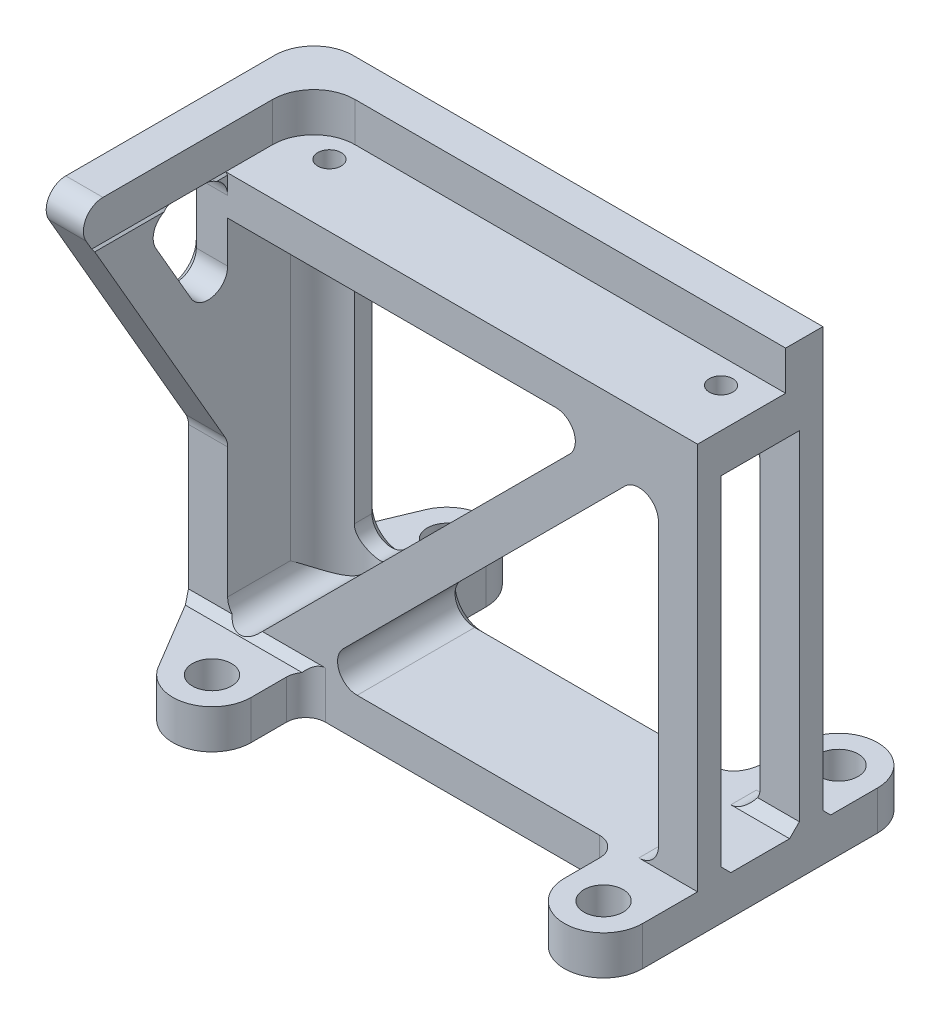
ISO-10303-21;
HEADER;
FILE_DESCRIPTION(('STEP AP214'),'2;1');
FILE_NAME('part.step','',(''),(''),'','','');
FILE_SCHEMA(('AUTOMOTIVE_DESIGN { 1 0 10303 214 1 1 1 1 }'));
ENDSEC;
DATA;
#1=APPLICATION_CONTEXT('core data for automotive mechanical design processes');
#2=APPLICATION_PROTOCOL_DEFINITION('international standard','automotive_design',2000,#1);
#3=PRODUCT_CONTEXT('',#1,'mechanical');
#4=PRODUCT('Part','Part','',(#3));
#5=PRODUCT_RELATED_PRODUCT_CATEGORY('part','',(#4));
#6=PRODUCT_DEFINITION_FORMATION('','',#4);
#7=PRODUCT_DEFINITION_CONTEXT('part definition',#1,'design');
#8=PRODUCT_DEFINITION('design','',#6,#7);
#9=PRODUCT_DEFINITION_SHAPE('','',#8);
#10=(LENGTH_UNIT() NAMED_UNIT(*) SI_UNIT(.MILLI.,.METRE.));
#11=(NAMED_UNIT(*) PLANE_ANGLE_UNIT() SI_UNIT($,.RADIAN.));
#12=(NAMED_UNIT(*) SI_UNIT($,.STERADIAN.) SOLID_ANGLE_UNIT());
#13=UNCERTAINTY_MEASURE_WITH_UNIT(LENGTH_MEASURE(1.E-05),#10,'distance_accuracy_value','');
#14=(GEOMETRIC_REPRESENTATION_CONTEXT(3) GLOBAL_UNCERTAINTY_ASSIGNED_CONTEXT((#13)) GLOBAL_UNIT_ASSIGNED_CONTEXT((#10,
#11,#12)) REPRESENTATION_CONTEXT('',''));
#15=CARTESIAN_POINT('',(0.,0.,0.));
#16=DIRECTION('',(0.,0.,1.));
#17=DIRECTION('',(1.,0.,0.));
#18=AXIS2_PLACEMENT_3D('',#15,#16,#17);
#19=CARTESIAN_POINT('',(-60.,0.,138.));
#20=DIRECTION('',(1.,0.,0.));
#21=DIRECTION('',(0.,0.,1.));
#22=AXIS2_PLACEMENT_3D('',#19,#20,#21);
#23=PLANE('',#22);
#24=DIRECTION('',(0.,-0.866025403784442,-0.499999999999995));
#25=VECTOR('',#24,1.);
#26=CARTESIAN_POINT('',(-60.,-19.2487113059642,165.339745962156));
#27=LINE('',#26,#25);
#28=CARTESIAN_POINT('',(-60.,9.50000000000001,181.937822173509));
#29=VERTEX_POINT('',#28);
#30=CARTESIAN_POINT('',(-60.,-48.1217782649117,148.669872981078));
#31=VERTEX_POINT('',#30);
#32=EDGE_CURVE('E563',#29,#31,#27,.T.);
#33=ORIENTED_EDGE('',*,*,#32,.T.);
#34=CARTESIAN_POINT('',(-60.,-50.6217782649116,153.));
#35=DIRECTION('',(-1.,0.,0.));
#36=DIRECTION('',(0.,0.,1.));
#37=AXIS2_PLACEMENT_3D('',#34,#35,#36);
#38=CIRCLE('',#37,5.);
#39=CARTESIAN_POINT('',(-60.,-50.6217782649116,148.));
#40=VERTEX_POINT('',#39);
#41=EDGE_CURVE('E1257',#40,#31,#38,.F.);
#42=ORIENTED_EDGE('',*,*,#41,.F.);
#43=DIRECTION('',(0.,1.,0.));
#44=VECTOR('',#43,1.);
#45=CARTESIAN_POINT('',(-60.,-232.880543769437,148.));
#46=LINE('',#45,#44);
#47=CARTESIAN_POINT('',(-60.,-83.7867965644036,148.));
#48=VERTEX_POINT('',#47);
#49=EDGE_CURVE('E736',#48,#40,#46,.T.);
#50=ORIENTED_EDGE('',*,*,#49,.F.);
#51=DIRECTION('',(0.,0.,-1.));
#52=VECTOR('',#51,1.);
#53=CARTESIAN_POINT('',(-60.,-83.7867965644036,148.));
#54=LINE('',#53,#52);
#55=CARTESIAN_POINT('',(-60.,-83.7867965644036,132.));
#56=VERTEX_POINT('',#55);
#57=EDGE_CURVE('E921',#56,#48,#54,.F.);
#58=ORIENTED_EDGE('',*,*,#57,.F.);
#59=DIRECTION('',(0.,1.,0.));
#60=VECTOR('',#59,1.);
#61=CARTESIAN_POINT('',(-60.,-232.880543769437,132.));
#62=LINE('',#61,#60);
#63=CARTESIAN_POINT('',(-60.,0.,132.));
#64=VERTEX_POINT('',#63);
#65=EDGE_CURVE('E732',#56,#64,#62,.T.);
#66=ORIENTED_EDGE('',*,*,#65,.T.);
#67=DIRECTION('',(0.,0.,-1.));
#68=VECTOR('',#67,1.);
#69=CARTESIAN_POINT('',(-60.,0.,148.));
#70=LINE('',#69,#68);
#71=CARTESIAN_POINT('',(-60.,0.,148.));
#72=VERTEX_POINT('',#71);
#73=EDGE_CURVE('E717',#72,#64,#70,.T.);
#74=ORIENTED_EDGE('',*,*,#73,.F.);
#75=CARTESIAN_POINT('',(-60.,-10.6217782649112,148.));
#76=VERTEX_POINT('',#75);
#77=EDGE_CURVE('E735',#76,#72,#46,.T.);
#78=ORIENTED_EDGE('',*,*,#77,.F.);
#79=CARTESIAN_POINT('',(-60.,-10.6217782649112,153.));
#80=DIRECTION('',(-1.,0.,0.));
#81=DIRECTION('',(0.,0.,1.));
#82=AXIS2_PLACEMENT_3D('',#79,#80,#81);
#83=CIRCLE('',#82,5.);
#84=CARTESIAN_POINT('',(-60.,-13.1217782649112,157.330127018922));
#85=VERTEX_POINT('',#84);
#86=EDGE_CURVE('E1260',#85,#76,#83,.F.);
#87=ORIENTED_EDGE('',*,*,#86,.F.);
#88=DIRECTION('',(0.,-0.866025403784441,-0.499999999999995));
#89=VECTOR('',#88,1.);
#90=CARTESIAN_POINT('',(-60.,-14.2487113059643,156.679491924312));
#91=LINE('',#90,#89);
#92=CARTESIAN_POINT('',(-60.,2.50000000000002,166.349364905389));
#93=VERTEX_POINT('',#92);
#94=EDGE_CURVE('E562',#93,#85,#91,.T.);
#95=ORIENTED_EDGE('',*,*,#94,.F.);
#96=CARTESIAN_POINT('',(-60.,4.99999999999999,162.019237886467));
#97=DIRECTION('',(-1.,0.,0.));
#98=DIRECTION('',(0.,0.,1.));
#99=AXIS2_PLACEMENT_3D('',#96,#97,#98);
#100=CIRCLE('',#99,5.);
#101=CARTESIAN_POINT('',(-60.,9.5,164.198687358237));
#102=VERTEX_POINT('',#101);
#103=EDGE_CURVE('E1266',#102,#93,#100,.F.);
#104=ORIENTED_EDGE('',*,*,#103,.F.);
#105=DIRECTION('',(0.,0.,-1.));
#106=VECTOR('',#105,1.);
#107=CARTESIAN_POINT('',(-60.,9.5,138.));
#108=LINE('',#107,#106);
#109=EDGE_CURVE('E1091',#29,#102,#108,.T.);
#110=ORIENTED_EDGE('',*,*,#109,.F.);
#111=EDGE_LOOP('',(#33,#42,#50,#58,#66,#74,#78,#87,#95,#104,#110));
#112=FACE_BOUND('',#111,.T.);
#113=ADVANCED_FACE('F44',(#112),#23,.T.);
#114=CARTESIAN_POINT('',(-60.,5.,153.));
#115=DIRECTION('',(-1.,0.,0.));
#116=DIRECTION('',(0.,0.,1.));
#117=AXIS2_PLACEMENT_3D('',#114,#115,#116);
#118=CIRCLE('',#117,5.);
#119=CARTESIAN_POINT('',(-60.,5.,148.));
#120=VERTEX_POINT('',#119);
#121=CARTESIAN_POINT('',(-60.,9.5,150.82055052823));
#122=VERTEX_POINT('',#121);
#123=EDGE_CURVE('E1263',#120,#122,#118,.F.);
#124=ORIENTED_EDGE('',*,*,#123,.F.);
#125=DIRECTION('',(0.,1.,0.));
#126=VECTOR('',#125,1.);
#127=CARTESIAN_POINT('',(-60.,0.,148.));
#128=LINE('',#127,#126);
#129=CARTESIAN_POINT('',(-60.,9.5,148.));
#130=VERTEX_POINT('',#129);
#131=EDGE_CURVE('E1234',#120,#130,#128,.T.);
#132=ORIENTED_EDGE('',*,*,#131,.T.);
#133=DIRECTION('',(0.,0.,-1.));
#134=VECTOR('',#133,1.);
#135=CARTESIAN_POINT('',(-60.,9.5,138.));
#136=LINE('',#135,#134);
#137=EDGE_CURVE('E1549',#122,#130,#136,.T.);
#138=ORIENTED_EDGE('',*,*,#137,.F.);
#139=EDGE_LOOP('',(#124,#132,#138));
#140=FACE_BOUND('',#139,.T.);
#141=ADVANCED_FACE('F961',(#140),#23,.T.);
#142=CARTESIAN_POINT('',(0.,0.,148.));
#143=DIRECTION('',(0.,0.,1.));
#144=DIRECTION('',(-1.,0.,0.));
#145=AXIS2_PLACEMENT_3D('',#142,#143,#144);
#146=PLANE('',#145);
#147=CARTESIAN_POINT('',(-55.,-83.7867965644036,148.));
#148=DIRECTION('',(0.,0.,-1.));
#149=DIRECTION('',(-1.,0.,0.));
#150=AXIS2_PLACEMENT_3D('',#147,#148,#149);
#151=CIRCLE('',#150,5.);
#152=CARTESIAN_POINT('',(-58.8308385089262,-87.,148.));
#153=VERTEX_POINT('',#152);
#154=EDGE_CURVE('E1223',#48,#153,#151,.F.);
#155=ORIENTED_EDGE('',*,*,#154,.F.);
#156=ORIENTED_EDGE('',*,*,#49,.T.);
#157=DIRECTION('',(-1.,0.,0.));
#158=VECTOR('',#157,1.);
#159=CARTESIAN_POINT('',(-60.,-50.6217782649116,148.));
#160=LINE('',#159,#158);
#161=CARTESIAN_POINT('',(-70.,-50.6217782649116,148.));
#162=VERTEX_POINT('',#161);
#163=EDGE_CURVE('E1242',#162,#40,#160,.F.);
#164=ORIENTED_EDGE('',*,*,#163,.F.);
#165=DIRECTION('',(0.,1.,0.));
#166=VECTOR('',#165,1.);
#167=CARTESIAN_POINT('',(-70.,0.,148.));
#168=LINE('',#167,#166);
#169=CARTESIAN_POINT('',(-70.,-87.,148.));
#170=VERTEX_POINT('',#169);
#171=EDGE_CURVE('E748',#170,#162,#168,.T.);
#172=ORIENTED_EDGE('',*,*,#171,.F.);
#173=DIRECTION('',(-1.,0.,0.));
#174=VECTOR('',#173,1.);
#175=CARTESIAN_POINT('',(-70.,-87.,148.));
#176=LINE('',#175,#174);
#177=EDGE_CURVE('E1431',#153,#170,#176,.T.);
#178=ORIENTED_EDGE('',*,*,#177,.F.);
#179=EDGE_LOOP('',(#155,#156,#164,#172,#178));
#180=FACE_BOUND('',#179,.T.);
#181=ADVANCED_FACE('F967',(#180),#146,.T.);
#182=DIRECTION('',(0.,-1.,0.));
#183=VECTOR('',#182,1.);
#184=CARTESIAN_POINT('',(-35.,-89.,148.));
#185=LINE('',#184,#183);
#186=CARTESIAN_POINT('',(-35.,-99.,148.));
#187=VERTEX_POINT('',#186);
#188=CARTESIAN_POINT('',(-35.,-87.,148.));
#189=VERTEX_POINT('',#188);
#190=EDGE_CURVE('E1387',#187,#189,#185,.F.);
#191=ORIENTED_EDGE('',*,*,#190,.F.);
#192=DIRECTION('',(-1.,0.,0.));
#193=VECTOR('',#192,1.);
#194=CARTESIAN_POINT('',(60.,-99.,148.));
#195=LINE('',#194,#193);
#196=CARTESIAN_POINT('',(35.,-99.,148.));
#197=VERTEX_POINT('',#196);
#198=EDGE_CURVE('E699',#197,#187,#195,.T.);
#199=ORIENTED_EDGE('',*,*,#198,.F.);
#200=DIRECTION('',(0.,-1.,0.));
#201=VECTOR('',#200,1.);
#202=CARTESIAN_POINT('',(35.,-99.,148.));
#203=LINE('',#202,#201);
#204=CARTESIAN_POINT('',(35.,-89.,148.));
#205=VERTEX_POINT('',#204);
#206=EDGE_CURVE('E1384',#205,#197,#203,.T.);
#207=ORIENTED_EDGE('',*,*,#206,.F.);
#208=DIRECTION('',(1.,0.,0.));
#209=VECTOR('',#208,1.);
#210=CARTESIAN_POINT('',(50.,-89.,148.));
#211=LINE('',#210,#209);
#212=CARTESIAN_POINT('',(-26.9289321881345,-89.,148.));
#213=VERTEX_POINT('',#212);
#214=EDGE_CURVE('E689',#213,#205,#211,.T.);
#215=ORIENTED_EDGE('',*,*,#214,.F.);
#216=CARTESIAN_POINT('',(-26.9289321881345,-84.,148.));
#217=DIRECTION('',(0.,0.,-1.));
#218=DIRECTION('',(-1.,0.,0.));
#219=AXIS2_PLACEMENT_3D('',#216,#217,#218);
#220=CIRCLE('',#219,5.);
#221=CARTESIAN_POINT('',(-30.4644660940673,-80.4644660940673,148.));
#222=VERTEX_POINT('',#221);
#223=EDGE_CURVE('E941',#222,#213,#220,.F.);
#224=ORIENTED_EDGE('',*,*,#223,.F.);
#225=DIRECTION('',(-0.707106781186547,-0.707106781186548,0.));
#226=VECTOR('',#225,1.);
#227=CARTESIAN_POINT('',(-39.,-89.,148.));
#228=LINE('',#227,#226);
#229=CARTESIAN_POINT('',(41.4644660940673,-8.53553390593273,148.));
#230=VERTEX_POINT('',#229);
#231=EDGE_CURVE('E686',#230,#222,#228,.T.);
#232=ORIENTED_EDGE('',*,*,#231,.F.);
#233=CARTESIAN_POINT('',(45.,-12.0710678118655,148.));
#234=DIRECTION('',(0.,0.,-1.));
#235=DIRECTION('',(-1.,0.,0.));
#236=AXIS2_PLACEMENT_3D('',#233,#234,#235);
#237=CIRCLE('',#236,5.);
#238=CARTESIAN_POINT('',(50.,-12.0710678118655,148.));
#239=VERTEX_POINT('',#238);
#240=EDGE_CURVE('E844',#239,#230,#237,.F.);
#241=ORIENTED_EDGE('',*,*,#240,.F.);
#242=DIRECTION('',(0.,1.,0.));
#243=VECTOR('',#242,1.);
#244=CARTESIAN_POINT('',(50.,0.,148.));
#245=LINE('',#244,#243);
#246=CARTESIAN_POINT('',(50.,-84.,148.));
#247=VERTEX_POINT('',#246);
#248=EDGE_CURVE('E692',#247,#239,#245,.T.);
#249=ORIENTED_EDGE('',*,*,#248,.F.);
#250=CARTESIAN_POINT('',(45.,-84.,148.));
#251=DIRECTION('',(0.,0.,-1.));
#252=DIRECTION('',(-1.,0.,0.));
#253=AXIS2_PLACEMENT_3D('',#250,#251,#252);
#254=CIRCLE('',#253,5.);
#255=CARTESIAN_POINT('',(45.,-89.,148.));
#256=VERTEX_POINT('',#255);
#257=EDGE_CURVE('E1158',#256,#247,#254,.F.);
#258=ORIENTED_EDGE('',*,*,#257,.F.);
#259=DIRECTION('',(-1.,0.,0.));
#260=VECTOR('',#259,1.);
#261=CARTESIAN_POINT('',(60.,-89.,148.));
#262=LINE('',#261,#260);
#263=CARTESIAN_POINT('',(60.,-89.,148.));
#264=VERTEX_POINT('',#263);
#265=EDGE_CURVE('E663',#264,#256,#262,.T.);
#266=ORIENTED_EDGE('',*,*,#265,.F.);
#267=DIRECTION('',(0.,-1.,0.));
#268=VECTOR('',#267,1.);
#269=CARTESIAN_POINT('',(60.,10.,148.));
#270=LINE('',#269,#268);
#271=CARTESIAN_POINT('',(60.,10.,148.));
#272=VERTEX_POINT('',#271);
#273=EDGE_CURVE('E712',#272,#264,#270,.T.);
#274=ORIENTED_EDGE('',*,*,#273,.F.);
#275=DIRECTION('',(1.,0.,0.));
#276=VECTOR('',#275,1.);
#277=CARTESIAN_POINT('',(-60.,10.,148.));
#278=LINE('',#277,#276);
#279=CARTESIAN_POINT('',(-60.5,9.99999999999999,148.));
#280=VERTEX_POINT('',#279);
#281=EDGE_CURVE('E752',#280,#272,#278,.T.);
#282=ORIENTED_EDGE('',*,*,#281,.F.);
#283=DIRECTION('',(0.707106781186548,-0.707106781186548,0.));
#284=VECTOR('',#283,1.);
#285=CARTESIAN_POINT('',(-60.,9.5,148.));
#286=LINE('',#285,#284);
#287=EDGE_CURVE('E11',#130,#280,#286,.F.);
#288=ORIENTED_EDGE('',*,*,#287,.F.);
#289=ORIENTED_EDGE('',*,*,#131,.F.);
#290=DIRECTION('',(-1.,0.,0.));
#291=VECTOR('',#290,1.);
#292=CARTESIAN_POINT('',(0.,5.,148.));
#293=LINE('',#292,#291);
#294=CARTESIAN_POINT('',(-68.0000000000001,5.,148.));
#295=VERTEX_POINT('',#294);
#296=EDGE_CURVE('E1237',#295,#120,#293,.F.);
#297=ORIENTED_EDGE('',*,*,#296,.F.);
#298=DIRECTION('',(0.,1.,0.));
#299=VECTOR('',#298,1.);
#300=CARTESIAN_POINT('',(-68.0000000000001,0.,148.));
#301=LINE('',#300,#299);
#302=CARTESIAN_POINT('',(-68.0000000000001,-10.6217782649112,148.));
#303=VERTEX_POINT('',#302);
#304=EDGE_CURVE('E1290',#303,#295,#301,.T.);
#305=ORIENTED_EDGE('',*,*,#304,.F.);
#306=DIRECTION('',(-1.,0.,0.));
#307=VECTOR('',#306,1.);
#308=CARTESIAN_POINT('',(0.,-10.6217782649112,148.));
#309=LINE('',#308,#307);
#310=EDGE_CURVE('E1239',#76,#303,#309,.T.);
#311=ORIENTED_EDGE('',*,*,#310,.F.);
#312=ORIENTED_EDGE('',*,*,#77,.T.);
#313=DIRECTION('',(-1.,0.,0.));
#314=VECTOR('',#313,1.);
#315=CARTESIAN_POINT('',(60.,0.,148.));
#316=LINE('',#315,#314);
#317=CARTESIAN_POINT('',(23.7867965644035,0.,148.));
#318=VERTEX_POINT('',#317);
#319=EDGE_CURVE('E746',#318,#72,#316,.T.);
#320=ORIENTED_EDGE('',*,*,#319,.F.);
#321=CARTESIAN_POINT('',(23.7867965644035,-5.,148.));
#322=DIRECTION('',(0.,0.,-1.));
#323=DIRECTION('',(-1.,0.,0.));
#324=AXIS2_PLACEMENT_3D('',#321,#322,#323);
#325=CIRCLE('',#324,5.);
#326=CARTESIAN_POINT('',(27.3223304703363,-8.53553390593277,148.));
#327=VERTEX_POINT('',#326);
#328=EDGE_CURVE('E1586',#327,#318,#325,.F.);
#329=ORIENTED_EDGE('',*,*,#328,.F.);
#330=DIRECTION('',(0.707106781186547,0.707106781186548,0.));
#331=VECTOR('',#330,1.);
#332=CARTESIAN_POINT('',(-53.1421356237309,-89.,148.));
#333=LINE('',#332,#331);
#334=CARTESIAN_POINT('',(-51.1421356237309,-87.,148.));
#335=VERTEX_POINT('',#334);
#336=EDGE_CURVE('E683',#335,#327,#333,.T.);
#337=ORIENTED_EDGE('',*,*,#336,.F.);
#338=DIRECTION('',(-1.,0.,0.));
#339=VECTOR('',#338,1.);
#340=CARTESIAN_POINT('',(-70.,-87.,148.));
#341=LINE('',#340,#339);
#342=EDGE_CURVE('E1428',#189,#335,#341,.T.);
#343=ORIENTED_EDGE('',*,*,#342,.F.);
#344=EDGE_LOOP('',(#191,#199,#207,#215,#224,#232,#241,#249,#258,#266,#274,#282,#288,#289,#297,
#305,#311,#312,#320,#329,#337,#343));
#345=FACE_BOUND('',#344,.T.);
#346=ADVANCED_FACE('F859',(#345),#146,.T.);
#347=CARTESIAN_POINT('',(-50.,-232.880543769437,132.));
#348=DIRECTION('',(0.,1.,0.));
#349=DIRECTION('',(0.,0.,-1.));
#350=AXIS2_PLACEMENT_3D('',#347,#348,#349);
#351=CYLINDRICAL_SURFACE('',#350,10.);
#352=CARTESIAN_POINT('',(-50.,-85.8578643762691,132.));
#353=DIRECTION('',(-0.707106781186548,0.707106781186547,0.));
#354=DIRECTION('',(-0.707106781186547,-0.707106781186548,0.));
#355=AXIS2_PLACEMENT_3D('',#352,#353,#354);
#356=ELLIPSE('',#355,14.142135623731,10.);
#357=CARTESIAN_POINT('',(-51.4644660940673,-87.3223304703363,122.107814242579));
#358=VERTEX_POINT('',#357);
#359=CARTESIAN_POINT('',(-44.6066017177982,-80.4644660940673,123.579117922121));
#360=VERTEX_POINT('',#359);
#361=EDGE_CURVE('E675',#358,#360,#356,.F.);
#362=ORIENTED_EDGE('',*,*,#361,.T.);
#363=CARTESIAN_POINT('',(-53.1421356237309,-76.9289321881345,122.506476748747));
#364=CARTESIAN_POINT('',(-53.1421545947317,-77.0665115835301,122.506506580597));
#365=CARTESIAN_POINT('',(-53.1364580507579,-77.2040812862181,122.504598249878));
#366=CARTESIAN_POINT('',(-53.11377643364,-77.4781475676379,122.497123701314));
#367=CARTESIAN_POINT('',(-53.0967946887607,-77.6146444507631,122.491558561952));
#368=CARTESIAN_POINT('',(-53.05175000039,-77.885203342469,122.477009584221));
#369=CARTESIAN_POINT('',(-53.0237191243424,-78.0192712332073,122.468035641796));
#370=CARTESIAN_POINT('',(-52.9568320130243,-78.2844378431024,122.447074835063));
#371=CARTESIAN_POINT('',(-52.9179753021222,-78.4155364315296,122.435087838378));
#372=CARTESIAN_POINT('',(-52.8297901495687,-78.6737792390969,122.408628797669));
#373=CARTESIAN_POINT('',(-52.7804708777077,-78.800926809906,122.394158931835));
#374=CARTESIAN_POINT('',(-52.6717138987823,-79.050602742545,122.363344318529));
#375=CARTESIAN_POINT('',(-52.6122724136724,-79.1731293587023,122.346998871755));
#376=CARTESIAN_POINT('',(-52.4193273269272,-79.5326892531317,122.296155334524));
#377=CARTESIAN_POINT('',(-52.2711732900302,-79.7617894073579,122.259840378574));
#378=CARTESIAN_POINT('',(-51.9339721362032,-80.2001581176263,122.187237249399));
#379=CARTESIAN_POINT('',(-51.7437354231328,-80.4085210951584,122.150989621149));
#380=CARTESIAN_POINT('',(-51.4338089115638,-80.6951995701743,122.102769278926));
#381=CARTESIAN_POINT('',(-51.3263420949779,-80.786489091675,122.087714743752));
#382=CARTESIAN_POINT('',(-51.1038680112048,-80.9598121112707,122.060482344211));
#383=CARTESIAN_POINT('',(-50.9888639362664,-81.0418494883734,122.048303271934));
#384=CARTESIAN_POINT('',(-50.7530011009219,-81.1954343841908,122.027693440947));
#385=CARTESIAN_POINT('',(-50.6321940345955,-81.2670575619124,122.019234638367));
#386=CARTESIAN_POINT('',(-50.3848508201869,-81.3999415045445,122.006641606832));
#387=CARTESIAN_POINT('',(-50.2583172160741,-81.4612068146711,122.00250547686));
#388=CARTESIAN_POINT('',(-50.0005207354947,-81.5728669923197,121.99916952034));
#389=CARTESIAN_POINT('',(-49.8692593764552,-81.623265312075,121.999968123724));
#390=CARTESIAN_POINT('',(-49.6030910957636,-81.7127925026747,122.006993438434));
#391=CARTESIAN_POINT('',(-49.4681844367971,-81.751922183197,122.013219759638));
#392=CARTESIAN_POINT('',(-49.2056799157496,-81.8162431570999,122.030792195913));
#393=CARTESIAN_POINT('',(-49.0782499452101,-81.8422315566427,122.041740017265));
#394=CARTESIAN_POINT('',(-48.8222394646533,-81.88416051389,122.068763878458));
#395=CARTESIAN_POINT('',(-48.6936585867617,-81.9000977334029,122.084841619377));
#396=CARTESIAN_POINT('',(-48.4364627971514,-81.9219293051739,122.122134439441));
#397=CARTESIAN_POINT('',(-48.3078479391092,-81.9278289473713,122.143346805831));
#398=CARTESIAN_POINT('',(-48.0514338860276,-81.9297540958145,122.190815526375));
#399=CARTESIAN_POINT('',(-47.9236350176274,-81.9257758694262,122.217073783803));
#400=CARTESIAN_POINT('',(-47.6725443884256,-81.9083872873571,122.273790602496));
#401=CARTESIAN_POINT('',(-47.5492149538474,-81.8951830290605,122.304145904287));
#402=CARTESIAN_POINT('',(-47.3049725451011,-81.8598961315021,122.36917270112));
#403=CARTESIAN_POINT('',(-47.1840604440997,-81.8378103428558,122.40384572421));
#404=CARTESIAN_POINT('',(-46.8259577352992,-81.758771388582,122.513819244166));
#405=CARTESIAN_POINT('',(-46.5932945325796,-81.6890287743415,122.595098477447));
#406=CARTESIAN_POINT('',(-46.1250484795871,-81.5114593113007,122.777557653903));
#407=CARTESIAN_POINT('',(-45.8909823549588,-81.4008403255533,122.879855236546));
#408=CARTESIAN_POINT('',(-45.4458271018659,-81.1473992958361,123.093799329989));
#409=CARTESIAN_POINT('',(-45.2347276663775,-81.0045917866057,123.205441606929));
#410=CARTESIAN_POINT('',(-44.9609619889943,-80.7876117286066,123.361962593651));
#411=CARTESIAN_POINT('',(-44.8873762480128,-80.7257447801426,123.405343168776));
#412=CARTESIAN_POINT('',(-44.7441008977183,-80.5980643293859,123.492208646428));
#413=CARTESIAN_POINT('',(-44.6744036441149,-80.53225913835,123.535693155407));
#414=CARTESIAN_POINT('',(-44.6066017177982,-80.4644660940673,123.579117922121));
#415=B_SPLINE_CURVE_WITH_KNOTS('',3,(#363,#364,#365,#366,#367,#368,#369,#370,#371,#372,#373,
#374,#375,#376,#377,#378,#379,#380,#381,#382,#383,#384,#385,#386,#387,#388,#389,#390,#391,#392,
#393,#394,#395,#396,#397,#398,#399,#400,#401,#402,#403,#404,#405,#406,#407,#408,#409,#410,#411,
#412,#413,#414),.UNSPECIFIED.,.F.,.F.,(4,2,2,2,2,2,2,2,2,2,2,2,2,2,2,2,2,2,2,2,2,2,2,2,2,4),(0.,
0.412591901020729,0.825062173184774,1.23634406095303,1.6476440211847,2.05858498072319,
2.46967965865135,3.29159541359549,4.14067307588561,4.56565734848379,4.99046277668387,
5.41200866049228,5.83336907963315,6.25459544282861,6.67579153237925,7.06684421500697,
7.45802670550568,7.84900297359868,8.24012700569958,8.62278209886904,9.00557300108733,
9.77083076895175,10.6028634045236,11.4345210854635,11.7508266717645,12.0664867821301),.UNSPECIFIED.);
#416=CARTESIAN_POINT('',(-53.1421356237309,-76.9289321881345,122.506476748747));
#417=VERTEX_POINT('',#416);
#418=EDGE_CURVE('E873',#417,#360,#415,.T.);
#419=ORIENTED_EDGE('',*,*,#418,.F.);
#420=DIRECTION('',(0.,1.,0.));
#421=VECTOR('',#420,1.);
#422=CARTESIAN_POINT('',(-53.1421356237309,-232.880543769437,122.506476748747));
#423=LINE('',#422,#421);
#424=CARTESIAN_POINT('',(-53.1421356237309,-5.,122.506476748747));
#425=VERTEX_POINT('',#424);
#426=EDGE_CURVE('E793',#425,#417,#423,.F.);
#427=ORIENTED_EDGE('',*,*,#426,.F.);
#428=CARTESIAN_POINT('',(-48.142135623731,0.,122.174098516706));
#429=CARTESIAN_POINT('',(-48.2686079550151,2.10926690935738E-05,122.150162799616));
#430=CARTESIAN_POINT('',(-48.3955575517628,-0.00479796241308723,122.128710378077));
#431=CARTESIAN_POINT('',(-48.6494507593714,-0.024180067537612,122.090793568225));
#432=CARTESIAN_POINT('',(-48.7763943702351,-0.038742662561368,122.074328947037));
#433=CARTESIAN_POINT('',(-49.0289495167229,-0.0776174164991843,122.046448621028));
#434=CARTESIAN_POINT('',(-49.1545638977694,-0.101900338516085,122.035017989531));
#435=CARTESIAN_POINT('',(-49.4038799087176,-0.160125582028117,122.017001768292));
#436=CARTESIAN_POINT('',(-49.5275816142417,-0.194067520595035,122.010415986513));
#437=CARTESIAN_POINT('',(-49.7721880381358,-0.271428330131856,122.001845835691));
#438=CARTESIAN_POINT('',(-49.8930918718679,-0.314850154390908,121.999862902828));
#439=CARTESIAN_POINT('',(-50.1312353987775,-0.410885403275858,122.00015189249));
#440=CARTESIAN_POINT('',(-50.2484736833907,-0.463502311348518,122.00242543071));
#441=CARTESIAN_POINT('',(-50.4784281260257,-0.577533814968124,122.01078859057));
#442=CARTESIAN_POINT('',(-50.5911447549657,-0.638947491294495,122.016877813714));
#443=CARTESIAN_POINT('',(-50.811397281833,-0.770167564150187,122.032360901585));
#444=CARTESIAN_POINT('',(-50.9189311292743,-0.839977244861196,122.041756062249));
#445=CARTESIAN_POINT('',(-51.1303487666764,-0.989056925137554,122.063509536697));
#446=CARTESIAN_POINT('',(-51.2341076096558,-1.06849550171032,122.075926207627));
#447=CARTESIAN_POINT('',(-51.4349561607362,-1.23511414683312,122.102971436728));
#448=CARTESIAN_POINT('',(-51.5320435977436,-1.3222968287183,122.117600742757));
#449=CARTESIAN_POINT('',(-51.7190169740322,-1.5038724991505,122.148403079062));
#450=CARTESIAN_POINT('',(-51.8089006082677,-1.59826777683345,122.164576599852));
#451=CARTESIAN_POINT('',(-51.9809616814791,-1.79369899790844,122.197782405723));
#452=CARTESIAN_POINT('',(-52.0631387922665,-1.89473522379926,122.214814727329));
#453=CARTESIAN_POINT('',(-52.2249339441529,-2.11032959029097,122.25028150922));
#454=CARTESIAN_POINT('',(-52.3039499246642,-2.22533809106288,122.268729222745));
#455=CARTESIAN_POINT('',(-52.4521120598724,-2.46158730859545,122.305003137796));
#456=CARTESIAN_POINT('',(-52.5212612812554,-2.58282607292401,122.322829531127));
#457=CARTESIAN_POINT('',(-52.6492432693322,-2.83079652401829,122.35708033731));
#458=CARTESIAN_POINT('',(-52.7080778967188,-2.95752721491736,122.373505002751));
#459=CARTESIAN_POINT('',(-52.8149887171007,-3.21563856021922,122.404223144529));
#460=CARTESIAN_POINT('',(-52.8630697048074,-3.34701711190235,122.418517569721));
#461=CARTESIAN_POINT('',(-52.9445586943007,-3.60244111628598,122.44326239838));
#462=CARTESIAN_POINT('',(-52.9788572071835,-3.726181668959,122.453934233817));
#463=CARTESIAN_POINT('',(-53.0378647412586,-3.97612310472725,122.472548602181));
#464=CARTESIAN_POINT('',(-53.0625747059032,-4.10232374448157,122.480491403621));
#465=CARTESIAN_POINT('',(-53.1022457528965,-4.3566547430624,122.493342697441));
#466=CARTESIAN_POINT('',(-53.1171878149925,-4.48478837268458,122.498245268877));
#467=CARTESIAN_POINT('',(-53.1371415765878,-4.74194541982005,122.504824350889));
#468=CARTESIAN_POINT('',(-53.1421503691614,-4.87096908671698,122.506499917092));
#469=CARTESIAN_POINT('',(-53.142135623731,-5.,122.506476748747));
#470=B_SPLINE_CURVE_WITH_KNOTS('',3,(#428,#429,#430,#431,#432,#433,#434,#435,#436,#437,#438,
#439,#440,#441,#442,#443,#444,#445,#446,#447,#448,#449,#450,#451,#452,#453,#454,#455,#456,#457,
#458,#459,#460,#461,#462,#463,#464,#465,#466,#467,#468,#469),.UNSPECIFIED.,.F.,.F.,(4,2,2,2,2,2,
2,2,2,2,2,2,2,2,2,2,2,2,2,2,4),(0.,0.38604785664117,0.772077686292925,1.1569550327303,
1.54181712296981,1.92679928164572,2.31192760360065,2.69701571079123,3.08225494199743,
3.47562533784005,3.86912898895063,4.26275805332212,4.65640387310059,5.0781672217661,
5.49979919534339,5.92135503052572,6.34272253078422,6.72887097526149,7.1149814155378,
7.501841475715,7.8888147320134),.UNSPECIFIED.);
#471=CARTESIAN_POINT('',(-48.142135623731,0.,122.174098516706));
#472=VERTEX_POINT('',#471);
#473=EDGE_CURVE('E934',#472,#425,#470,.T.);
#474=ORIENTED_EDGE('',*,*,#473,.F.);
#475=CARTESIAN_POINT('',(-50.,0.,132.));
#476=DIRECTION('',(0.,-1.,0.));
#477=DIRECTION('',(0.,0.,1.));
#478=AXIS2_PLACEMENT_3D('',#475,#476,#477);
#479=CIRCLE('',#478,10.);
#480=EDGE_CURVE('E720',#64,#472,#479,.T.);
#481=ORIENTED_EDGE('',*,*,#480,.F.);
#482=ORIENTED_EDGE('',*,*,#65,.F.);
#483=CARTESIAN_POINT('',(-51.4644660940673,-87.3223304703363,122.107814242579));
#484=CARTESIAN_POINT('',(-51.5575695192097,-87.4154667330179,122.121589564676));
#485=CARTESIAN_POINT('',(-51.6542492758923,-87.5047573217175,122.137252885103));
#486=CARTESIAN_POINT('',(-51.8538727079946,-87.6751174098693,122.17282379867));
#487=CARTESIAN_POINT('',(-51.9568165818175,-87.7561866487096,122.192731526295));
#488=CARTESIAN_POINT('',(-52.1678010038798,-87.9093704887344,122.237201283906));
#489=CARTESIAN_POINT('',(-52.2758277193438,-87.981507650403,122.261751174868));
#490=CARTESIAN_POINT('',(-52.496219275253,-88.1166680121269,122.315901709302));
#491=CARTESIAN_POINT('',(-52.6085838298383,-88.1796918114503,122.345502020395));
#492=CARTESIAN_POINT('',(-52.8367152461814,-88.2964121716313,122.410051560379));
#493=CARTESIAN_POINT('',(-52.9524852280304,-88.3500998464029,122.445005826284));
#494=CARTESIAN_POINT('',(-53.1862855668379,-88.447966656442,122.520407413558));
#495=CARTESIAN_POINT('',(-53.3043167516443,-88.4921422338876,122.560856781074));
#496=CARTESIAN_POINT('',(-53.541451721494,-88.5709621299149,122.647244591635));
#497=CARTESIAN_POINT('',(-53.660554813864,-88.6056122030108,122.693179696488));
#498=CARTESIAN_POINT('',(-53.8989260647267,-88.6656026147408,122.790496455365));
#499=CARTESIAN_POINT('',(-54.0181942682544,-88.6909394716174,122.841880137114));
#500=CARTESIAN_POINT('',(-54.2573252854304,-88.7328399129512,122.950545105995));
#501=CARTESIAN_POINT('',(-54.3771783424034,-88.7492957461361,123.007889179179));
#502=CARTESIAN_POINT('',(-54.6152336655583,-88.7734062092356,123.127718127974));
#503=CARTESIAN_POINT('',(-54.7334352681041,-88.7810573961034,123.190205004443));
#504=CARTESIAN_POINT('',(-54.9674609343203,-88.7880615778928,123.3200090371));
#505=CARTESIAN_POINT('',(-55.0832839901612,-88.7874111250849,123.387328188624));
#506=CARTESIAN_POINT('',(-55.3119195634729,-88.7783696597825,123.52642754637));
#507=CARTESIAN_POINT('',(-55.4247314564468,-88.7699770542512,123.598208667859));
#508=CARTESIAN_POINT('',(-55.694254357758,-88.7409264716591,123.777370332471));
#509=CARTESIAN_POINT('',(-55.8491657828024,-88.7165637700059,123.886875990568));
#510=CARTESIAN_POINT('',(-56.1509006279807,-88.6549747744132,124.113173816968));
#511=CARTESIAN_POINT('',(-56.2977212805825,-88.617744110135,124.229968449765));
#512=CARTESIAN_POINT('',(-56.5828603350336,-88.5319781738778,124.470011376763));
#513=CARTESIAN_POINT('',(-56.7211663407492,-88.4834268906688,124.593268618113));
#514=CARTESIAN_POINT('',(-56.9887324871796,-88.3765353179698,124.845183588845));
#515=CARTESIAN_POINT('',(-57.1179923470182,-88.3181947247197,124.973841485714));
#516=CARTESIAN_POINT('',(-57.4168492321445,-88.168213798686,125.287762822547));
#517=CARTESIAN_POINT('',(-57.582112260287,-88.0725433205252,125.475239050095));
#518=CARTESIAN_POINT('',(-57.8949530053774,-87.8677550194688,125.857462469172));
#519=CARTESIAN_POINT('',(-58.0425239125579,-87.7586320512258,126.052212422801));
#520=CARTESIAN_POINT('',(-58.3205926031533,-87.5292820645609,126.447856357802));
#521=CARTESIAN_POINT('',(-58.4510600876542,-87.4090359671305,126.648760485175));
#522=CARTESIAN_POINT('',(-58.6951226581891,-87.1597034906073,127.055200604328));
#523=CARTESIAN_POINT('',(-58.8087179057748,-87.0306171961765,127.260736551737));
#524=CARTESIAN_POINT('',(-59.0605977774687,-86.7137311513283,127.756182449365));
#525=CARTESIAN_POINT('',(-59.1913156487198,-86.5226132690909,128.047833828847));
#526=CARTESIAN_POINT('',(-59.4226269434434,-86.1303492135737,128.636351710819));
#527=CARTESIAN_POINT('',(-59.5232072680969,-85.9291987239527,128.933220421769));
#528=CARTESIAN_POINT('',(-59.6951579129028,-85.5201838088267,129.530134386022));
#529=CARTESIAN_POINT('',(-59.766566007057,-85.3123284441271,129.830175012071));
#530=CARTESIAN_POINT('',(-59.8811172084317,-84.8922737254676,130.432373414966));
#531=CARTESIAN_POINT('',(-59.9242701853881,-84.6800759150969,130.73453041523));
#532=CARTESIAN_POINT('',(-59.9840233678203,-84.2447367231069,131.352357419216));
#533=CARTESIAN_POINT('',(-59.9994714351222,-84.0215014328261,131.668076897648));
#534=CARTESIAN_POINT('',(-59.9999955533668,-83.7944945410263,131.98911341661));
#535=CARTESIAN_POINT('',(-59.9999999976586,-83.7906455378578,131.994556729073));
#536=CARTESIAN_POINT('',(-60.,-83.7867965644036,132.));
#537=B_SPLINE_CURVE_WITH_KNOTS('',3,(#483,#484,#485,#486,#487,#488,#489,#490,#491,#492,#493,
#494,#495,#496,#497,#498,#499,#500,#501,#502,#503,#504,#505,#506,#507,#508,#509,#510,#511,#512,
#513,#514,#515,#516,#517,#518,#519,#520,#521,#522,#523,#524,#525,#526,#527,#528,#529,#530,#531,
#532,#533,#534,#535,#536),.UNSPECIFIED.,.F.,.F.,(4,2,2,2,2,2,2,2,2,2,2,2,2,2,2,2,2,2,2,2,2,2,2,
2,2,2,4),(0.,0.397123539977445,0.794259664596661,1.1903713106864,1.58645689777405,
1.9829174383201,2.37952601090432,2.77589445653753,3.17241093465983,3.57363586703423,
3.97501764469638,4.37656612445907,4.77819724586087,5.3511379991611,5.92427353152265,
6.49822464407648,7.07219356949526,7.87380071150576,8.67571541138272,9.47903204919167,
10.2823409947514,11.3979045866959,12.5139523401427,13.6285503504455,14.7427588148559,
15.9023140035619,15.9223140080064),.UNSPECIFIED.);
#538=EDGE_CURVE('E914',#358,#56,#537,.T.);
#539=ORIENTED_EDGE('',*,*,#538,.F.);
#540=EDGE_LOOP('',(#362,#419,#427,#474,#481,#482,#539));
#541=FACE_BOUND('',#540,.T.);
#542=ADVANCED_FACE('F925',(#541),#351,.F.);
#543=CARTESIAN_POINT('',(50.,-232.880543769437,142.));
#544=DIRECTION('',(0.,0.,1.));
#545=DIRECTION('',(-1.,0.,0.));
#546=AXIS2_PLACEMENT_3D('',#543,#544,#545);
#547=PLANE('',#546);
#548=CARTESIAN_POINT('',(45.,-84.,142.));
#549=DIRECTION('',(0.,0.,-1.));
#550=DIRECTION('',(-1.,0.,0.));
#551=AXIS2_PLACEMENT_3D('',#548,#549,#550);
#552=CIRCLE('',#551,5.);
#553=CARTESIAN_POINT('',(50.,-84.,142.));
#554=VERTEX_POINT('',#553);
#555=CARTESIAN_POINT('',(49.3301270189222,-86.5000000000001,142.));
#556=VERTEX_POINT('',#555);
#557=EDGE_CURVE('E1159',#554,#556,#552,.T.);
#558=ORIENTED_EDGE('',*,*,#557,.F.);
#559=DIRECTION('',(0.,1.,0.));
#560=VECTOR('',#559,1.);
#561=CARTESIAN_POINT('',(50.,-232.880543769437,142.));
#562=LINE('',#561,#560);
#563=CARTESIAN_POINT('',(50.,-12.0710678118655,142.));
#564=VERTEX_POINT('',#563);
#565=EDGE_CURVE('E726',#554,#564,#562,.T.);
#566=ORIENTED_EDGE('',*,*,#565,.T.);
#567=DIRECTION('',(0.,1.,0.));
#568=VECTOR('',#567,1.);
#569=CARTESIAN_POINT('',(50.,-6.03553390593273,142.));
#570=LINE('',#569,#568);
#571=CARTESIAN_POINT('',(50.,0.,142.));
#572=VERTEX_POINT('',#571);
#573=EDGE_CURVE('E1149',#572,#564,#570,.F.);
#574=ORIENTED_EDGE('',*,*,#573,.F.);
#575=DIRECTION('',(-1.,0.,0.));
#576=VECTOR('',#575,1.);
#577=CARTESIAN_POINT('',(50.,0.,142.));
#578=LINE('',#577,#576);
#579=CARTESIAN_POINT('',(60.,0.,142.));
#580=VERTEX_POINT('',#579);
#581=EDGE_CURVE('E723',#580,#572,#578,.T.);
#582=ORIENTED_EDGE('',*,*,#581,.F.);
#583=DIRECTION('',(0.,1.,0.));
#584=VECTOR('',#583,1.);
#585=CARTESIAN_POINT('',(60.,-232.880543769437,142.));
#586=LINE('',#585,#584);
#587=CARTESIAN_POINT('',(60.,-86.5000000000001,142.));
#588=VERTEX_POINT('',#587);
#589=EDGE_CURVE('E729',#588,#580,#586,.T.);
#590=ORIENTED_EDGE('',*,*,#589,.F.);
#591=DIRECTION('',(1.,0.,0.));
#592=VECTOR('',#591,1.);
#593=CARTESIAN_POINT('',(60.,-86.5000000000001,142.));
#594=LINE('',#593,#592);
#595=EDGE_CURVE('E1171',#556,#588,#594,.T.);
#596=ORIENTED_EDGE('',*,*,#595,.F.);
#597=EDGE_LOOP('',(#558,#566,#574,#582,#590,#596));
#598=FACE_BOUND('',#597,.T.);
#599=ADVANCED_FACE('F929',(#598),#547,.F.);
#600=CARTESIAN_POINT('',(50.,-232.880543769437,122.));
#601=DIRECTION('',(0.,0.,-1.));
#602=DIRECTION('',(1.,0.,0.));
#603=AXIS2_PLACEMENT_3D('',#600,#601,#602);
#604=PLANE('',#603);
#605=DIRECTION('',(0.,1.,0.));
#606=VECTOR('',#605,1.);
#607=CARTESIAN_POINT('',(60.,-232.880543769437,122.));
#608=LINE('',#607,#606);
#609=CARTESIAN_POINT('',(60.,-86.5,122.));
#610=VERTEX_POINT('',#609);
#611=CARTESIAN_POINT('',(60.,0.,122.));
#612=VERTEX_POINT('',#611);
#613=EDGE_CURVE('E739',#610,#612,#608,.T.);
#614=ORIENTED_EDGE('',*,*,#613,.T.);
#615=DIRECTION('',(1.,0.,0.));
#616=VECTOR('',#615,1.);
#617=CARTESIAN_POINT('',(50.,0.,122.));
#618=LINE('',#617,#616);
#619=CARTESIAN_POINT('',(50.,0.,122.));
#620=VERTEX_POINT('',#619);
#621=EDGE_CURVE('E714',#620,#612,#618,.T.);
#622=ORIENTED_EDGE('',*,*,#621,.F.);
#623=DIRECTION('',(0.,1.,0.));
#624=VECTOR('',#623,1.);
#625=CARTESIAN_POINT('',(50.,-6.03553390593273,122.));
#626=LINE('',#625,#624);
#627=CARTESIAN_POINT('',(50.,-12.0710678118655,122.));
#628=VERTEX_POINT('',#627);
#629=EDGE_CURVE('E2540',#620,#628,#626,.F.);
#630=ORIENTED_EDGE('',*,*,#629,.T.);
#631=DIRECTION('',(0.,1.,0.));
#632=VECTOR('',#631,1.);
#633=CARTESIAN_POINT('',(50.,-232.880543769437,122.));
#634=LINE('',#633,#632);
#635=CARTESIAN_POINT('',(50.,-84.,122.));
#636=VERTEX_POINT('',#635);
#637=EDGE_CURVE('E700',#636,#628,#634,.T.);
#638=ORIENTED_EDGE('',*,*,#637,.F.);
#639=CARTESIAN_POINT('',(45.,-84.,122.));
#640=DIRECTION('',(0.,0.,1.));
#641=DIRECTION('',(1.,0.,0.));
#642=AXIS2_PLACEMENT_3D('',#639,#640,#641);
#643=CIRCLE('',#642,5.);
#644=CARTESIAN_POINT('',(49.3301270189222,-86.5,122.));
#645=VERTEX_POINT('',#644);
#646=EDGE_CURVE('E872',#645,#636,#643,.T.);
#647=ORIENTED_EDGE('',*,*,#646,.F.);
#648=DIRECTION('',(-1.,0.,0.));
#649=VECTOR('',#648,1.);
#650=CARTESIAN_POINT('',(45.,-86.5,122.));
#651=LINE('',#650,#649);
#652=EDGE_CURVE('E1174',#610,#645,#651,.T.);
#653=ORIENTED_EDGE('',*,*,#652,.F.);
#654=EDGE_LOOP('',(#614,#622,#630,#638,#647,#653));
#655=FACE_BOUND('',#654,.T.);
#656=ADVANCED_FACE('F856',(#655),#604,.F.);
#657=CARTESIAN_POINT('',(50.,-232.880543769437,132.));
#658=DIRECTION('',(0.,1.,0.));
#659=DIRECTION('',(0.,0.,-1.));
#660=AXIS2_PLACEMENT_3D('',#657,#658,#659);
#661=CYLINDRICAL_SURFACE('',#660,9.99999999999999);
#662=CARTESIAN_POINT('',(50.,0.,132.));
#663=DIRECTION('',(0.,-1.,0.));
#664=DIRECTION('',(0.,0.,1.));
#665=AXIS2_PLACEMENT_3D('',#662,#663,#664);
#666=CIRCLE('',#665,9.99999999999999);
#667=EDGE_CURVE('E695',#572,#620,#666,.T.);
#668=ORIENTED_EDGE('',*,*,#667,.F.);
#669=ORIENTED_EDGE('',*,*,#573,.T.);
#670=CARTESIAN_POINT('',(41.4644660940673,-8.53553390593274,137.2100538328));
#671=CARTESIAN_POINT('',(41.5250183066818,-8.47498606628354,137.309251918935));
#672=CARTESIAN_POINT('',(41.5875867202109,-8.41552441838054,137.407870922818));
#673=CARTESIAN_POINT('',(41.7168439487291,-8.29900382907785,137.603848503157));
#674=CARTESIAN_POINT('',(41.7835334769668,-8.2419453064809,137.701206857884));
#675=CARTESIAN_POINT('',(41.9902385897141,-8.07446311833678,137.99168551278));
#676=CARTESIAN_POINT('',(42.1365786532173,-7.96804823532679,138.182695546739));
#677=CARTESIAN_POINT('',(42.4482283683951,-7.76720389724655,138.559825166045));
#678=CARTESIAN_POINT('',(42.613742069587,-7.67293123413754,138.745860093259));
#679=CARTESIAN_POINT('',(42.9622847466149,-7.50101274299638,139.108705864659));
#680=CARTESIAN_POINT('',(43.14529121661,-7.42334595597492,139.285528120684));
#681=CARTESIAN_POINT('',(43.4576769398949,-7.3131635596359,139.564674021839));
#682=CARTESIAN_POINT('',(43.5819066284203,-7.27456529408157,139.670397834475));
#683=CARTESIAN_POINT('',(43.8369024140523,-7.20643927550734,139.876744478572));
#684=CARTESIAN_POINT('',(43.967666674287,-7.17690898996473,139.977368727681));
#685=CARTESIAN_POINT('',(44.2347465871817,-7.12811922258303,140.172459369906));
#686=CARTESIAN_POINT('',(44.3710377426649,-7.10881882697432,140.266948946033));
#687=CARTESIAN_POINT('',(44.6489614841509,-7.08145272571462,140.449497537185));
#688=CARTESIAN_POINT('',(44.7905932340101,-7.07338526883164,140.53755755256));
#689=CARTESIAN_POINT('',(45.0571334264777,-7.06988759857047,140.694155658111));
#690=CARTESIAN_POINT('',(45.1814508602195,-7.07277866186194,140.763663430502));
#691=CARTESIAN_POINT('',(45.4324646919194,-7.08821936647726,140.897067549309));
#692=CARTESIAN_POINT('',(45.5591606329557,-7.10076717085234,140.960964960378));
#693=CARTESIAN_POINT('',(45.8140520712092,-7.13610283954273,141.082830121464));
#694=CARTESIAN_POINT('',(45.9422482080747,-7.15889523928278,141.140795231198));
#695=CARTESIAN_POINT('',(46.1989730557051,-7.21517140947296,141.250496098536));
#696=CARTESIAN_POINT('',(46.327501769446,-7.24865527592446,141.302231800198));
#697=CARTESIAN_POINT('',(46.5842041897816,-7.32676885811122,141.399535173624));
#698=CARTESIAN_POINT('',(46.7123739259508,-7.37144638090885,141.445075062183));
#699=CARTESIAN_POINT('',(46.9664495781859,-7.47196580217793,141.529716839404));
#700=CARTESIAN_POINT('',(47.0923554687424,-7.52780782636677,141.56881865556));
#701=CARTESIAN_POINT('',(47.3405114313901,-7.65052887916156,141.640737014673));
#702=CARTESIAN_POINT('',(47.4627619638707,-7.71740651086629,141.673554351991));
#703=CARTESIAN_POINT('',(47.7022767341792,-7.86188056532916,141.733226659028));
#704=CARTESIAN_POINT('',(47.81954125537,-7.93947637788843,141.760081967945));
#705=CARTESIAN_POINT('',(48.0386721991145,-8.09824923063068,141.80636099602));
#706=CARTESIAN_POINT('',(48.1410196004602,-8.17864137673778,141.826207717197));
#707=CARTESIAN_POINT('',(48.3395737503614,-8.34759575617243,141.861701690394));
#708=CARTESIAN_POINT('',(48.4357783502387,-8.43616082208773,141.877347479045));
#709=CARTESIAN_POINT('',(48.6211652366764,-8.62081092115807,141.904927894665));
#710=CARTESIAN_POINT('',(48.7103504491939,-8.71689278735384,141.916864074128));
#711=CARTESIAN_POINT('',(48.8810750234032,-8.91599869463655,141.93757544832));
#712=CARTESIAN_POINT('',(48.9626116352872,-9.01902520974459,141.946349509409));
#713=CARTESIAN_POINT('',(49.1186276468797,-9.23298511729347,141.961396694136));
#714=CARTESIAN_POINT('',(49.1929746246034,-9.34401799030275,141.96762795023));
#715=CARTESIAN_POINT('',(49.3325814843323,-9.57175244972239,141.977948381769));
#716=CARTESIAN_POINT('',(49.397841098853,-9.6884542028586,141.982037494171));
#717=CARTESIAN_POINT('',(49.5188431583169,-9.92679045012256,141.988601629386));
#718=CARTESIAN_POINT('',(49.5745818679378,-10.0484268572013,141.991076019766));
#719=CARTESIAN_POINT('',(49.6761211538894,-10.295749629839,141.994882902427));
#720=CARTESIAN_POINT('',(49.7219250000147,-10.421434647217,141.996215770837));
#721=CARTESIAN_POINT('',(49.8018698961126,-10.6715448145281,141.998114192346));
#722=CARTESIAN_POINT('',(49.8363676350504,-10.7958559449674,141.998705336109));
#723=CARTESIAN_POINT('',(49.8956548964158,-11.0467715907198,141.999499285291));
#724=CARTESIAN_POINT('',(49.9204446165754,-11.1733760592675,141.999702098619));
#725=CARTESIAN_POINT('',(49.9601620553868,-11.4281065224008,141.999941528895));
#726=CARTESIAN_POINT('',(49.975090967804,-11.556232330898,141.999978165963));
#727=CARTESIAN_POINT('',(49.9950155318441,-11.8132608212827,141.999999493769));
#728=CARTESIAN_POINT('',(50.0000106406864,-11.9421635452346,141.999984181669));
#729=CARTESIAN_POINT('',(50.,-12.0710678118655,142.));
#730=B_SPLINE_CURVE_WITH_KNOTS('',3,(#670,#671,#672,#673,#674,#675,#676,#677,#678,#679,#680,
#681,#682,#683,#684,#685,#686,#687,#688,#689,#690,#691,#692,#693,#694,#695,#696,#697,#698,#699,
#700,#701,#702,#703,#704,#705,#706,#707,#708,#709,#710,#711,#712,#713,#714,#715,#716,#717,#718,
#719,#720,#721,#722,#723,#724,#725,#726,#727,#728,#729),.UNSPECIFIED.,.F.,.F.,(4,2,2,2,2,2,2,2,
2,2,2,2,2,2,2,2,2,2,2,2,2,2,2,2,2,2,2,2,2,4),(0.,0.393092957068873,0.786254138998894,
1.57460780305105,2.37229376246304,3.16896690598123,3.6714753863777,4.17384339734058,
4.6741867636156,5.17445211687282,5.60140361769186,6.02827392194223,6.45533339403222,
6.88239670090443,7.31131601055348,7.74024015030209,8.16911003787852,8.59795551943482,
8.99244559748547,9.38707291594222,9.78153485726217,10.1761380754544,10.5769990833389,
10.9778718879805,11.3789016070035,11.7797991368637,12.166446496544,12.5530859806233,
12.9396786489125,13.3262924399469),.UNSPECIFIED.);
#731=CARTESIAN_POINT('',(41.4644660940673,-8.53553390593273,137.2100538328));
#732=VERTEX_POINT('',#731);
#733=EDGE_CURVE('E835',#732,#564,#730,.T.);
#734=ORIENTED_EDGE('',*,*,#733,.F.);
#735=CARTESIAN_POINT('',(50.,0.,132.));
#736=DIRECTION('',(0.707106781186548,-0.707106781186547,0.));
#737=DIRECTION('',(0.707106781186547,0.707106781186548,0.));
#738=AXIS2_PLACEMENT_3D('',#735,#736,#737);
#739=ELLIPSE('',#738,14.1421356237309,9.99999999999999);
#740=CARTESIAN_POINT('',(41.4644660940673,-8.53553390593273,126.7899461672));
#741=VERTEX_POINT('',#740);
#742=EDGE_CURVE('E790',#741,#732,#739,.F.);
#743=ORIENTED_EDGE('',*,*,#742,.F.);
#744=CARTESIAN_POINT('',(50.,-12.0710678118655,122.));
#745=CARTESIAN_POINT('',(50.000014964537,-11.9307999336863,122.0000221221));
#746=CARTESIAN_POINT('',(49.9940981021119,-11.7905341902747,122.00000069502));
#747=CARTESIAN_POINT('',(49.9705086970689,-11.5109996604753,122.000030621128));
#748=CARTESIAN_POINT('',(49.9528365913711,-11.3717308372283,122.00008197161));
#749=CARTESIAN_POINT('',(49.9058472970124,-11.0951877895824,122.000417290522));
#750=CARTESIAN_POINT('',(49.8765314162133,-10.9579133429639,122.000701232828));
#751=CARTESIAN_POINT('',(49.8064676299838,-10.6863172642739,122.001811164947));
#752=CARTESIAN_POINT('',(49.7657198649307,-10.5519955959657,122.002637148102));
#753=CARTESIAN_POINT('',(49.6730606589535,-10.2871985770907,122.005238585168));
#754=CARTESIAN_POINT('',(49.6211440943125,-10.1567250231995,122.007014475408));
#755=CARTESIAN_POINT('',(49.5065156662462,-9.90058168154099,122.012019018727));
#756=CARTESIAN_POINT('',(49.4438000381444,-9.77491358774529,122.015248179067));
#757=CARTESIAN_POINT('',(49.3080870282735,-9.52940509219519,122.023734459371));
#758=CARTESIAN_POINT('',(49.2350945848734,-9.4095619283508,122.028990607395));
#759=CARTESIAN_POINT('',(49.079374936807,-9.17653224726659,122.042161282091));
#760=CARTESIAN_POINT('',(48.9966480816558,-9.06334549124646,122.050075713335));
#761=CARTESIAN_POINT('',(48.8230232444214,-8.84559332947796,122.069125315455));
#762=CARTESIAN_POINT('',(48.7322168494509,-8.74095199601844,122.080226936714));
#763=CARTESIAN_POINT('',(48.5425388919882,-8.53984783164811,122.106316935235));
#764=CARTESIAN_POINT('',(48.4436704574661,-8.44338185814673,122.121303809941));
#765=CARTESIAN_POINT('',(48.2387420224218,-8.25930731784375,122.155775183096));
#766=CARTESIAN_POINT('',(48.1326825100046,-8.17169815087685,122.1752593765));
#767=CARTESIAN_POINT('',(47.9143864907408,-8.00595654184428,122.219273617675));
#768=CARTESIAN_POINT('',(47.8021502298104,-7.92782372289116,122.243803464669));
#769=CARTESIAN_POINT('',(47.5773287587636,-7.78452918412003,122.29724463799));
#770=CARTESIAN_POINT('',(47.4649458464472,-7.71896745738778,122.325935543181));
#771=CARTESIAN_POINT('',(47.2365600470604,-7.59730603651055,122.388682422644));
#772=CARTESIAN_POINT('',(47.1205559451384,-7.54120955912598,122.422740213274));
#773=CARTESIAN_POINT('',(46.8861194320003,-7.43869094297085,122.496377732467));
#774=CARTESIAN_POINT('',(46.7676880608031,-7.39226475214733,122.535955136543));
#775=CARTESIAN_POINT('',(46.5294061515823,-7.30904623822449,122.620715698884));
#776=CARTESIAN_POINT('',(46.4095551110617,-7.2722574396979,122.665900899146));
#777=CARTESIAN_POINT('',(46.1708231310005,-7.20852994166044,122.76129062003));
#778=CARTESIAN_POINT('',(46.051945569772,-7.18148985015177,122.811436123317));
#779=CARTESIAN_POINT('',(45.8147796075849,-7.13642381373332,122.917005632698));
#780=CARTESIAN_POINT('',(45.6964914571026,-7.11840142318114,122.972431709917));
#781=CARTESIAN_POINT('',(45.4614678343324,-7.09100394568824,123.088272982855));
#782=CARTESIAN_POINT('',(45.3447314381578,-7.08162346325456,123.148685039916));
#783=CARTESIAN_POINT('',(45.1134442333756,-7.07101392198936,123.274239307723));
#784=CARTESIAN_POINT('',(44.9988938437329,-7.06978641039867,123.339382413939));
#785=CARTESIAN_POINT('',(44.7336530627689,-7.07585077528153,123.497242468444));
#786=CARTESIAN_POINT('',(44.5840831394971,-7.08621796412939,123.591737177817));
#787=CARTESIAN_POINT('',(44.2911056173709,-7.11937904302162,123.787836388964));
#788=CARTESIAN_POINT('',(44.1476998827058,-7.14217666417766,123.889443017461));
#789=CARTESIAN_POINT('',(43.8671850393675,-7.19897336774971,124.099404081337));
#790=CARTESIAN_POINT('',(43.7301085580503,-7.23302439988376,124.207787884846));
#791=CARTESIAN_POINT('',(43.4634390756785,-7.31099551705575,124.43009058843));
#792=CARTESIAN_POINT('',(43.3338482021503,-7.35491839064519,124.544011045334));
#793=CARTESIAN_POINT('',(43.0310418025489,-7.47115537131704,124.824219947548));
#794=CARTESIAN_POINT('',(42.8616463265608,-7.54773590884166,124.992880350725));
#795=CARTESIAN_POINT('',(42.5384429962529,-7.71516428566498,125.338081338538));
#796=CARTESIAN_POINT('',(42.3846500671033,-7.80602557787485,125.514629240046));
#797=CARTESIAN_POINT('',(42.0945186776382,-7.99821903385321,125.871735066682));
#798=CARTESIAN_POINT('',(41.9579833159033,-8.09940352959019,126.052213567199));
#799=CARTESIAN_POINT('',(41.7000659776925,-8.31100125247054,126.41779738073));
#800=CARTESIAN_POINT('',(41.578650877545,-8.42139338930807,126.602891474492));
#801=CARTESIAN_POINT('',(41.4644660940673,-8.53553390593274,126.7899461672));
#802=B_SPLINE_CURVE_WITH_KNOTS('',3,(#744,#745,#746,#747,#748,#749,#750,#751,#752,#753,#754,
#755,#756,#757,#758,#759,#760,#761,#762,#763,#764,#765,#766,#767,#768,#769,#770,#771,#772,#773,
#774,#775,#776,#777,#778,#779,#780,#781,#782,#783,#784,#785,#786,#787,#788,#789,#790,#791,#792,
#793,#794,#795,#796,#797,#798,#799,#800,#801),.UNSPECIFIED.,.F.,.F.,(4,2,2,2,2,2,2,2,2,2,2,2,2,
2,2,2,2,2,2,2,2,2,2,2,2,2,2,2,4),(0.,0.420675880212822,0.841336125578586,1.26194913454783,
1.6825569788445,2.10335819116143,2.52430639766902,2.94505300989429,3.36578451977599,
3.78224016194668,4.19853498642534,4.61480158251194,5.03105161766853,5.43026498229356,
5.82961374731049,6.2287948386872,6.62812171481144,7.02316663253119,7.41836713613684,
7.81332073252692,8.20834927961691,8.73924166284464,9.27029348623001,9.80383189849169,
10.337521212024,11.0893562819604,11.8419038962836,12.584892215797,13.3262231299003),.UNSPECIFIED.);
#803=EDGE_CURVE('E863',#628,#741,#802,.T.);
#804=ORIENTED_EDGE('',*,*,#803,.F.);
#805=ORIENTED_EDGE('',*,*,#629,.F.);
#806=EDGE_LOOP('',(#668,#669,#734,#743,#804,#805));
#807=FACE_BOUND('',#806,.T.);
#808=ADVANCED_FACE('F850',(#807),#661,.F.);
#809=CARTESIAN_POINT('',(0.,0.,132.));
#810=DIRECTION('',(0.,1.,0.));
#811=DIRECTION('',(0.,0.,-1.));
#812=AXIS2_PLACEMENT_3D('',#809,#810,#811);
#813=PLANE('',#812);
#814=DIRECTION('',(0.,0.,-1.));
#815=VECTOR('',#814,1.);
#816=CARTESIAN_POINT('',(23.7867965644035,0.,116.));
#817=LINE('',#816,#815);
#818=CARTESIAN_POINT('',(23.7867965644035,0.,118.));
#819=VERTEX_POINT('',#818);
#820=EDGE_CURVE('E820',#318,#819,#817,.T.);
#821=ORIENTED_EDGE('',*,*,#820,.F.);
#822=ORIENTED_EDGE('',*,*,#319,.T.);
#823=ORIENTED_EDGE('',*,*,#73,.T.);
#824=ORIENTED_EDGE('',*,*,#480,.T.);
#825=DIRECTION('',(0.,0.,-1.));
#826=VECTOR('',#825,1.);
#827=CARTESIAN_POINT('',(-48.142135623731,0.,122.506476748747));
#828=LINE('',#827,#826);
#829=CARTESIAN_POINT('',(-48.142135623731,0.,118.));
#830=VERTEX_POINT('',#829);
#831=EDGE_CURVE('E823',#830,#472,#828,.F.);
#832=ORIENTED_EDGE('',*,*,#831,.F.);
#833=DIRECTION('',(-1.,0.,0.));
#834=VECTOR('',#833,1.);
#835=CARTESIAN_POINT('',(-48.142135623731,0.,118.));
#836=LINE('',#835,#834);
#837=EDGE_CURVE('E1361',#819,#830,#836,.T.);
#838=ORIENTED_EDGE('',*,*,#837,.F.);
#839=EDGE_LOOP('',(#821,#822,#823,#824,#832,#838));
#840=FACE_BOUND('',#839,.T.);
#841=CARTESIAN_POINT('',(-50.,0.,132.));
#842=DIRECTION('',(0.,-1.,0.));
#843=DIRECTION('',(0.,0.,-1.));
#844=AXIS2_PLACEMENT_3D('',#841,#842,#843);
#845=CIRCLE('',#844,3.);
#846=CARTESIAN_POINT('',(-50.,0.,129.));
#847=VERTEX_POINT('',#846);
#848=EDGE_CURVE('E770',#847,#847,#845,.T.);
#849=ORIENTED_EDGE('',*,*,#848,.F.);
#850=EDGE_LOOP('',(#849));
#851=FACE_BOUND('',#850,.T.);
#852=ADVANCED_FACE('F855',(#840,#851),#813,.F.);
#853=CARTESIAN_POINT('',(50.,0.,132.));
#854=DIRECTION('',(0.,-1.,0.));
#855=DIRECTION('',(0.,0.,1.));
#856=AXIS2_PLACEMENT_3D('',#853,#854,#855);
#857=CIRCLE('',#856,3.);
#858=CARTESIAN_POINT('',(50.,0.,135.));
#859=VERTEX_POINT('',#858);
#860=EDGE_CURVE('E766',#859,#859,#857,.T.);
#861=ORIENTED_EDGE('',*,*,#860,.F.);
#862=EDGE_LOOP('',(#861));
#863=FACE_BOUND('',#862,.T.);
#864=ORIENTED_EDGE('',*,*,#621,.T.);
#865=DIRECTION('',(0.,0.,1.));
#866=VECTOR('',#865,1.);
#867=CARTESIAN_POINT('',(60.,0.,138.));
#868=LINE('',#867,#866);
#869=EDGE_CURVE('E776',#612,#580,#868,.T.);
#870=ORIENTED_EDGE('',*,*,#869,.T.);
#871=ORIENTED_EDGE('',*,*,#581,.T.);
#872=ORIENTED_EDGE('',*,*,#667,.T.);
#873=EDGE_LOOP('',(#864,#870,#871,#872));
#874=FACE_BOUND('',#873,.T.);
#875=ADVANCED_FACE('F986',(#863,#874),#813,.F.);
#876=CARTESIAN_POINT('',(0.,10.,132.));
#877=DIRECTION('',(0.,1.,0.));
#878=DIRECTION('',(0.,0.,-1.));
#879=AXIS2_PLACEMENT_3D('',#876,#877,#878);
#880=PLANE('',#879);
#881=ORIENTED_EDGE('',*,*,#281,.T.);
#882=DIRECTION('',(0.,0.,1.));
#883=VECTOR('',#882,1.);
#884=CARTESIAN_POINT('',(60.,10.,138.));
#885=LINE('',#884,#883);
#886=CARTESIAN_POINT('',(60.,9.99999999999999,125.5));
#887=VERTEX_POINT('',#886);
#888=EDGE_CURVE('E779',#887,#272,#885,.T.);
#889=ORIENTED_EDGE('',*,*,#888,.F.);
#890=DIRECTION('',(-1.,0.,0.));
#891=VECTOR('',#890,1.);
#892=CARTESIAN_POINT('',(60.,9.99999999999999,125.5));
#893=LINE('',#892,#891);
#894=CARTESIAN_POINT('',(-50.,9.99999999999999,125.5));
#895=VERTEX_POINT('',#894);
#896=EDGE_CURVE('E544',#887,#895,#893,.T.);
#897=ORIENTED_EDGE('',*,*,#896,.T.);
#898=CARTESIAN_POINT('',(-50.,9.99999999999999,136.));
#899=DIRECTION('',(0.,-1.,0.));
#900=DIRECTION('',(0.,0.,-1.));
#901=AXIS2_PLACEMENT_3D('',#898,#899,#900);
#902=CIRCLE('',#901,10.5);
#903=CARTESIAN_POINT('',(-60.5,9.99999999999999,136.));
#904=VERTEX_POINT('',#903);
#905=EDGE_CURVE('E2555',#895,#904,#902,.F.);
#906=ORIENTED_EDGE('',*,*,#905,.T.);
#907=DIRECTION('',(0.,0.,1.));
#908=VECTOR('',#907,1.);
#909=CARTESIAN_POINT('',(-60.5,9.99999999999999,136.));
#910=LINE('',#909,#908);
#911=EDGE_CURVE('E526',#904,#280,#910,.T.);
#912=ORIENTED_EDGE('',*,*,#911,.T.);
#913=EDGE_LOOP('',(#881,#889,#897,#906,#912));
#914=FACE_BOUND('',#913,.T.);
#915=CARTESIAN_POINT('',(-50.,10.,132.));
#916=DIRECTION('',(0.,-1.,0.));
#917=DIRECTION('',(0.,0.,-1.));
#918=AXIS2_PLACEMENT_3D('',#915,#916,#917);
#919=CIRCLE('',#918,3.);
#920=CARTESIAN_POINT('',(-50.,10.,129.));
#921=VERTEX_POINT('',#920);
#922=EDGE_CURVE('E773',#921,#921,#919,.T.);
#923=ORIENTED_EDGE('',*,*,#922,.T.);
#924=EDGE_LOOP('',(#923));
#925=FACE_BOUND('',#924,.T.);
#926=CARTESIAN_POINT('',(50.,10.,132.));
#927=DIRECTION('',(0.,-1.,0.));
#928=DIRECTION('',(0.,0.,1.));
#929=AXIS2_PLACEMENT_3D('',#926,#927,#928);
#930=CIRCLE('',#929,3.);
#931=CARTESIAN_POINT('',(50.,10.,135.));
#932=VERTEX_POINT('',#931);
#933=EDGE_CURVE('E767',#932,#932,#930,.T.);
#934=ORIENTED_EDGE('',*,*,#933,.T.);
#935=EDGE_LOOP('',(#934));
#936=FACE_BOUND('',#935,.T.);
#937=ADVANCED_FACE('F983',(#914,#925,#936),#880,.T.);
#938=CARTESIAN_POINT('',(60.,10.,138.));
#939=DIRECTION('',(-1.,0.,0.));
#940=DIRECTION('',(0.,0.,-1.));
#941=AXIS2_PLACEMENT_3D('',#938,#939,#940);
#942=PLANE('',#941);
#943=ORIENTED_EDGE('',*,*,#589,.T.);
#944=ORIENTED_EDGE('',*,*,#869,.F.);
#945=ORIENTED_EDGE('',*,*,#613,.F.);
#946=DIRECTION('',(0.,-0.707106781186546,0.707106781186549));
#947=VECTOR('',#946,1.);
#948=CARTESIAN_POINT('',(60.,-46.2500000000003,81.75));
#949=LINE('',#948,#947);
#950=CARTESIAN_POINT('',(60.,-89.,124.5));
#951=VERTEX_POINT('',#950);
#952=EDGE_CURVE('E1186',#951,#610,#949,.F.);
#953=ORIENTED_EDGE('',*,*,#952,.F.);
#954=DIRECTION('',(0.,0.,1.));
#955=VECTOR('',#954,1.);
#956=CARTESIAN_POINT('',(60.,-89.,122.));
#957=LINE('',#956,#955);
#958=CARTESIAN_POINT('',(60.,-89.,139.5));
#959=VERTEX_POINT('',#958);
#960=EDGE_CURVE('E680',#951,#959,#957,.T.);
#961=ORIENTED_EDGE('',*,*,#960,.T.);
#962=DIRECTION('',(0.,0.707106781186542,0.707106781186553));
#963=VECTOR('',#962,1.);
#964=CARTESIAN_POINT('',(60.,-40.2500000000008,188.25));
#965=LINE('',#964,#963);
#966=EDGE_CURVE('E1184',#588,#959,#965,.F.);
#967=ORIENTED_EDGE('',*,*,#966,.F.);
#968=EDGE_LOOP('',(#943,#944,#945,#953,#961,#967));
#969=FACE_BOUND('',#968,.T.);
#970=ORIENTED_EDGE('',*,*,#888,.T.);
#971=ORIENTED_EDGE('',*,*,#273,.T.);
#972=DIRECTION('',(0.,0.,-1.));
#973=VECTOR('',#972,1.);
#974=CARTESIAN_POINT('',(60.,-89.,148.));
#975=LINE('',#974,#973);
#976=CARTESIAN_POINT('',(60.,-89.,162.));
#977=VERTEX_POINT('',#976);
#978=EDGE_CURVE('E660',#977,#264,#975,.T.);
#979=ORIENTED_EDGE('',*,*,#978,.F.);
#980=DIRECTION('',(0.,-1.,0.));
#981=VECTOR('',#980,1.);
#982=CARTESIAN_POINT('',(60.,-89.,162.));
#983=LINE('',#982,#981);
#984=CARTESIAN_POINT('',(60.,-99.,162.));
#985=VERTEX_POINT('',#984);
#986=EDGE_CURVE('E669',#977,#985,#983,.T.);
#987=ORIENTED_EDGE('',*,*,#986,.T.);
#988=DIRECTION('',(0.,0.,1.));
#989=VECTOR('',#988,1.);
#990=CARTESIAN_POINT('',(60.,-99.,142.));
#991=LINE('',#990,#989);
#992=CARTESIAN_POINT('',(60.,-99.,102.));
#993=VERTEX_POINT('',#992);
#994=EDGE_CURVE('E696',#993,#985,#991,.T.);
#995=ORIENTED_EDGE('',*,*,#994,.F.);
#996=DIRECTION('',(0.,-1.,0.));
#997=VECTOR('',#996,1.);
#998=CARTESIAN_POINT('',(60.,-89.,102.));
#999=LINE('',#998,#997);
#1000=CARTESIAN_POINT('',(60.,-89.,102.));
#1001=VERTEX_POINT('',#1000);
#1002=EDGE_CURVE('E591',#1001,#993,#999,.T.);
#1003=ORIENTED_EDGE('',*,*,#1002,.F.);
#1004=DIRECTION('',(0.,0.,-1.));
#1005=VECTOR('',#1004,1.);
#1006=CARTESIAN_POINT('',(60.,-89.,116.));
#1007=LINE('',#1006,#1005);
#1008=CARTESIAN_POINT('',(60.,-89.,114.));
#1009=VERTEX_POINT('',#1008);
#1010=EDGE_CURVE('E583',#1009,#1001,#1007,.T.);
#1011=ORIENTED_EDGE('',*,*,#1010,.F.);
#1012=DIRECTION('',(0.,-0.707106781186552,-0.707106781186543));
#1013=VECTOR('',#1012,1.);
#1014=CARTESIAN_POINT('',(60.,-27.4999999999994,175.5));
#1015=LINE('',#1014,#1013);
#1016=CARTESIAN_POINT('',(60.,-87.,116.));
#1017=VERTEX_POINT('',#1016);
#1018=EDGE_CURVE('E1092',#1017,#1009,#1015,.T.);
#1019=ORIENTED_EDGE('',*,*,#1018,.F.);
#1020=DIRECTION('',(0.,1.,0.));
#1021=VECTOR('',#1020,1.);
#1022=CARTESIAN_POINT('',(60.,0.,116.));
#1023=LINE('',#1022,#1021);
#1024=CARTESIAN_POINT('',(60.,20.,116.));
#1025=VERTEX_POINT('',#1024);
#1026=EDGE_CURVE('E763',#1017,#1025,#1023,.T.);
#1027=ORIENTED_EDGE('',*,*,#1026,.T.);
#1028=DIRECTION('',(0.,0.,1.));
#1029=VECTOR('',#1028,1.);
#1030=CARTESIAN_POINT('',(60.,20.,126.));
#1031=LINE('',#1030,#1029);
#1032=CARTESIAN_POINT('',(60.,20.,125.5));
#1033=VERTEX_POINT('',#1032);
#1034=EDGE_CURVE('E760',#1025,#1033,#1031,.T.);
#1035=ORIENTED_EDGE('',*,*,#1034,.T.);
#1036=DIRECTION('',(0.,1.,0.));
#1037=VECTOR('',#1036,1.);
#1038=CARTESIAN_POINT('',(60.,-124.098343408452,125.5));
#1039=LINE('',#1038,#1037);
#1040=EDGE_CURVE('E548',#887,#1033,#1039,.T.);
#1041=ORIENTED_EDGE('',*,*,#1040,.F.);
#1042=EDGE_LOOP('',(#970,#971,#979,#987,#995,#1003,#1011,#1019,#1027,#1035,#1041));
#1043=FACE_BOUND('',#1042,.T.);
#1044=ADVANCED_FACE('F981',(#969,#1043),#942,.F.);
#1045=CARTESIAN_POINT('',(-50.,10.,132.));
#1046=DIRECTION('',(0.,-1.,0.));
#1047=DIRECTION('',(0.,0.,1.));
#1048=AXIS2_PLACEMENT_3D('',#1045,#1046,#1047);
#1049=CYLINDRICAL_SURFACE('',#1048,3.);
#1050=ORIENTED_EDGE('',*,*,#922,.F.);
#1051=EDGE_LOOP('',(#1050));
#1052=FACE_BOUND('',#1051,.T.);
#1053=ORIENTED_EDGE('',*,*,#848,.T.);
#1054=EDGE_LOOP('',(#1053));
#1055=FACE_BOUND('',#1054,.T.);
#1056=ADVANCED_FACE('F977',(#1052,#1055),#1049,.F.);
#1057=CARTESIAN_POINT('',(50.,10.,132.));
#1058=DIRECTION('',(0.,-1.,0.));
#1059=DIRECTION('',(0.,0.,1.));
#1060=AXIS2_PLACEMENT_3D('',#1057,#1058,#1059);
#1061=CYLINDRICAL_SURFACE('',#1060,3.);
#1062=ORIENTED_EDGE('',*,*,#933,.F.);
#1063=EDGE_LOOP('',(#1062));
#1064=FACE_BOUND('',#1063,.T.);
#1065=ORIENTED_EDGE('',*,*,#860,.T.);
#1066=EDGE_LOOP('',(#1065));
#1067=FACE_BOUND('',#1066,.T.);
#1068=ADVANCED_FACE('F973',(#1064,#1067),#1061,.F.);
#1069=CARTESIAN_POINT('',(-70.,0.,116.));
#1070=DIRECTION('',(0.,0.,-1.));
#1071=DIRECTION('',(1.,0.,0.));
#1072=AXIS2_PLACEMENT_3D('',#1069,#1070,#1071);
#1073=PLANE('',#1072);
#1074=CARTESIAN_POINT('',(23.7867965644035,-5.,116.));
#1075=DIRECTION('',(0.,0.,1.));
#1076=DIRECTION('',(1.,0.,0.));
#1077=AXIS2_PLACEMENT_3D('',#1074,#1075,#1076);
#1078=CIRCLE('',#1077,6.99999999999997);
#1079=CARTESIAN_POINT('',(23.7867965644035,1.99999999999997,116.));
#1080=VERTEX_POINT('',#1079);
#1081=CARTESIAN_POINT('',(28.7365440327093,-9.94974746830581,116.));
#1082=VERTEX_POINT('',#1081);
#1083=EDGE_CURVE('E1317',#1080,#1082,#1078,.F.);
#1084=ORIENTED_EDGE('',*,*,#1083,.F.);
#1085=DIRECTION('',(1.,0.,0.));
#1086=VECTOR('',#1085,1.);
#1087=CARTESIAN_POINT('',(23.7867965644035,1.99999999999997,116.));
#1088=LINE('',#1087,#1086);
#1089=CARTESIAN_POINT('',(-48.142135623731,1.99999999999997,116.));
#1090=VERTEX_POINT('',#1089);
#1091=EDGE_CURVE('E1314',#1090,#1080,#1088,.T.);
#1092=ORIENTED_EDGE('',*,*,#1091,.F.);
#1093=CARTESIAN_POINT('',(-48.142135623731,-5.,116.));
#1094=DIRECTION('',(0.,0.,1.));
#1095=DIRECTION('',(1.,0.,0.));
#1096=AXIS2_PLACEMENT_3D('',#1093,#1094,#1095);
#1097=CIRCLE('',#1096,6.99999999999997);
#1098=CARTESIAN_POINT('',(-55.1421356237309,-5.,116.));
#1099=VERTEX_POINT('',#1098);
#1100=EDGE_CURVE('E1311',#1099,#1090,#1097,.F.);
#1101=ORIENTED_EDGE('',*,*,#1100,.F.);
#1102=DIRECTION('',(0.,1.,0.));
#1103=VECTOR('',#1102,1.);
#1104=CARTESIAN_POINT('',(-55.1421356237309,-5.,116.));
#1105=LINE('',#1104,#1103);
#1106=CARTESIAN_POINT('',(-55.1421356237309,-76.9289321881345,116.));
#1107=VERTEX_POINT('',#1106);
#1108=EDGE_CURVE('E1305',#1107,#1099,#1105,.T.);
#1109=ORIENTED_EDGE('',*,*,#1108,.F.);
#1110=CARTESIAN_POINT('',(-48.1421356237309,-76.9289321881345,116.));
#1111=DIRECTION('',(0.,0.,1.));
#1112=DIRECTION('',(1.,0.,0.));
#1113=AXIS2_PLACEMENT_3D('',#1110,#1111,#1112);
#1114=CIRCLE('',#1113,6.99999999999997);
#1115=CARTESIAN_POINT('',(-43.1923881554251,-81.8786796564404,116.));
#1116=VERTEX_POINT('',#1115);
#1117=EDGE_CURVE('E1308',#1116,#1107,#1114,.F.);
#1118=ORIENTED_EDGE('',*,*,#1117,.F.);
#1119=DIRECTION('',(-0.707106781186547,-0.707106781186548,0.));
#1120=VECTOR('',#1119,1.);
#1121=CARTESIAN_POINT('',(-43.1923881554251,-81.8786796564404,116.));
#1122=LINE('',#1121,#1120);
#1123=EDGE_CURVE('E1320',#1082,#1116,#1122,.T.);
#1124=ORIENTED_EDGE('',*,*,#1123,.F.);
#1125=EDGE_LOOP('',(#1084,#1092,#1101,#1109,#1118,#1124));
#1126=FACE_BOUND('',#1125,.T.);
#1127=DIRECTION('',(0.,1.,0.));
#1128=VECTOR('',#1127,1.);
#1129=CARTESIAN_POINT('',(-60.,0.,116.));
#1130=LINE('',#1129,#1128);
#1131=CARTESIAN_POINT('',(-60.,20.,116.));
#1132=VERTEX_POINT('',#1131);
#1133=CARTESIAN_POINT('',(-60.,-87.,116.));
#1134=VERTEX_POINT('',#1133);
#1135=EDGE_CURVE('E787',#1132,#1134,#1130,.F.);
#1136=ORIENTED_EDGE('',*,*,#1135,.F.);
#1137=DIRECTION('',(1.,0.,0.));
#1138=VECTOR('',#1137,1.);
#1139=CARTESIAN_POINT('',(-70.,20.,116.));
#1140=LINE('',#1139,#1138);
#1141=EDGE_CURVE('E758',#1132,#1025,#1140,.T.);
#1142=ORIENTED_EDGE('',*,*,#1141,.T.);
#1143=ORIENTED_EDGE('',*,*,#1026,.F.);
#1144=DIRECTION('',(1.,0.,0.));
#1145=VECTOR('',#1144,1.);
#1146=CARTESIAN_POINT('',(-70.,-87.,116.));
#1147=LINE('',#1146,#1145);
#1148=CARTESIAN_POINT('',(51.3245553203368,-87.,116.));
#1149=VERTEX_POINT('',#1148);
#1150=EDGE_CURVE('E1036',#1149,#1017,#1147,.T.);
#1151=ORIENTED_EDGE('',*,*,#1150,.F.);
#1152=CARTESIAN_POINT('',(45.,-84.,116.));
#1153=DIRECTION('',(0.,0.,1.));
#1154=DIRECTION('',(1.,0.,0.));
#1155=AXIS2_PLACEMENT_3D('',#1152,#1153,#1154);
#1156=CIRCLE('',#1155,7.00000000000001);
#1157=CARTESIAN_POINT('',(52.,-84.,116.));
#1158=VERTEX_POINT('',#1157);
#1159=EDGE_CURVE('E1338',#1158,#1149,#1156,.F.);
#1160=ORIENTED_EDGE('',*,*,#1159,.F.);
#1161=DIRECTION('',(0.,-1.,0.));
#1162=VECTOR('',#1161,1.);
#1163=CARTESIAN_POINT('',(52.,-84.,116.));
#1164=LINE('',#1163,#1162);
#1165=CARTESIAN_POINT('',(52.,-12.0710678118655,116.));
#1166=VERTEX_POINT('',#1165);
#1167=EDGE_CURVE('E1335',#1166,#1158,#1164,.T.);
#1168=ORIENTED_EDGE('',*,*,#1167,.F.);
#1169=CARTESIAN_POINT('',(45.,-12.0710678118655,116.));
#1170=DIRECTION('',(0.,0.,1.));
#1171=DIRECTION('',(1.,0.,0.));
#1172=AXIS2_PLACEMENT_3D('',#1169,#1170,#1171);
#1173=CIRCLE('',#1172,7.00000000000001);
#1174=CARTESIAN_POINT('',(40.0502525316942,-7.12132034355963,116.));
#1175=VERTEX_POINT('',#1174);
#1176=EDGE_CURVE('E1329',#1175,#1166,#1173,.F.);
#1177=ORIENTED_EDGE('',*,*,#1176,.F.);
#1178=DIRECTION('',(0.707106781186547,0.707106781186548,0.));
#1179=VECTOR('',#1178,1.);
#1180=CARTESIAN_POINT('',(40.0502525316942,-7.12132034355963,116.));
#1181=LINE('',#1180,#1179);
#1182=CARTESIAN_POINT('',(-31.8786796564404,-79.0502525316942,116.));
#1183=VERTEX_POINT('',#1182);
#1184=EDGE_CURVE('E1323',#1183,#1175,#1181,.T.);
#1185=ORIENTED_EDGE('',*,*,#1184,.F.);
#1186=CARTESIAN_POINT('',(-26.9289321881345,-84.,116.));
#1187=DIRECTION('',(0.,0.,1.));
#1188=DIRECTION('',(1.,0.,0.));
#1189=AXIS2_PLACEMENT_3D('',#1186,#1187,#1188);
#1190=CIRCLE('',#1189,7.00000000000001);
#1191=CARTESIAN_POINT('',(-26.9289321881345,-91.0000000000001,116.));
#1192=VERTEX_POINT('',#1191);
#1193=EDGE_CURVE('E1326',#1192,#1183,#1190,.F.);
#1194=ORIENTED_EDGE('',*,*,#1193,.F.);
#1195=DIRECTION('',(-1.,0.,0.));
#1196=VECTOR('',#1195,1.);
#1197=CARTESIAN_POINT('',(-26.9289321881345,-91.0000000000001,116.));
#1198=LINE('',#1197,#1196);
#1199=CARTESIAN_POINT('',(35.,-91.,116.));
#1200=VERTEX_POINT('',#1199);
#1201=EDGE_CURVE('E1332',#1200,#1192,#1198,.T.);
#1202=ORIENTED_EDGE('',*,*,#1201,.F.);
#1203=DIRECTION('',(0.,-1.,0.));
#1204=VECTOR('',#1203,1.);
#1205=CARTESIAN_POINT('',(35.,-91.,116.));
#1206=LINE('',#1205,#1204);
#1207=CARTESIAN_POINT('',(35.,-99.,116.));
#1208=VERTEX_POINT('',#1207);
#1209=EDGE_CURVE('E1395',#1208,#1200,#1206,.F.);
#1210=ORIENTED_EDGE('',*,*,#1209,.F.);
#1211=DIRECTION('',(1.,0.,0.));
#1212=VECTOR('',#1211,1.);
#1213=CARTESIAN_POINT('',(-60.,-99.,116.));
#1214=LINE('',#1213,#1212);
#1215=CARTESIAN_POINT('',(-35.,-99.,116.));
#1216=VERTEX_POINT('',#1215);
#1217=EDGE_CURVE('E709',#1216,#1208,#1214,.T.);
#1218=ORIENTED_EDGE('',*,*,#1217,.F.);
#1219=DIRECTION('',(0.,-1.,0.));
#1220=VECTOR('',#1219,1.);
#1221=CARTESIAN_POINT('',(-35.,-99.,116.));
#1222=LINE('',#1221,#1220);
#1223=CARTESIAN_POINT('',(-35.,-87.,116.));
#1224=VERTEX_POINT('',#1223);
#1225=EDGE_CURVE('E1033',#1224,#1216,#1222,.T.);
#1226=ORIENTED_EDGE('',*,*,#1225,.F.);
#1227=DIRECTION('',(1.,0.,0.));
#1228=VECTOR('',#1227,1.);
#1229=CARTESIAN_POINT('',(-70.,-87.,116.));
#1230=LINE('',#1229,#1228);
#1231=EDGE_CURVE('E1030',#1134,#1224,#1230,.T.);
#1232=ORIENTED_EDGE('',*,*,#1231,.F.);
#1233=EDGE_LOOP('',(#1136,#1142,#1143,#1151,#1160,#1168,#1177,#1185,#1194,#1202,#1210,#1218,
#1226,#1232));
#1234=FACE_BOUND('',#1233,.T.);
#1235=ADVANCED_FACE('F976',(#1126,#1234),#1073,.T.);
#1236=CARTESIAN_POINT('',(-70.,0.,138.));
#1237=DIRECTION('',(-1.,0.,0.));
#1238=DIRECTION('',(0.,0.,-1.));
#1239=AXIS2_PLACEMENT_3D('',#1236,#1237,#1238);
#1240=PLANE('',#1239);
#1241=DIRECTION('',(0.,-1.,0.));
#1242=VECTOR('',#1241,1.);
#1243=CARTESIAN_POINT('',(-70.,0.,146.));
#1244=LINE('',#1243,#1242);
#1245=CARTESIAN_POINT('',(-70.,5.,146.));
#1246=VERTEX_POINT('',#1245);
#1247=CARTESIAN_POINT('',(-70.,-10.6217782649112,146.));
#1248=VERTEX_POINT('',#1247);
#1249=EDGE_CURVE('E1281',#1246,#1248,#1244,.T.);
#1250=ORIENTED_EDGE('',*,*,#1249,.F.);
#1251=CARTESIAN_POINT('',(-70.,5.,153.));
#1252=DIRECTION('',(1.,0.,0.));
#1253=DIRECTION('',(0.,0.,-1.));
#1254=AXIS2_PLACEMENT_3D('',#1251,#1252,#1253);
#1255=CIRCLE('',#1254,6.99999999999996);
#1256=CARTESIAN_POINT('',(-70.,12.,153.));
#1257=VERTEX_POINT('',#1256);
#1258=EDGE_CURVE('E1278',#1257,#1246,#1255,.F.);
#1259=ORIENTED_EDGE('',*,*,#1258,.F.);
#1260=DIRECTION('',(0.,0.,-1.));
#1261=VECTOR('',#1260,1.);
#1262=CARTESIAN_POINT('',(-70.,12.,153.));
#1263=LINE('',#1262,#1261);
#1264=CARTESIAN_POINT('',(-70.,12.,162.019237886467));
#1265=VERTEX_POINT('',#1264);
#1266=EDGE_CURVE('E1275',#1265,#1257,#1263,.T.);
#1267=ORIENTED_EDGE('',*,*,#1266,.F.);
#1268=CARTESIAN_POINT('',(-70.,4.99999999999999,162.019237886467));
#1269=DIRECTION('',(1.,0.,0.));
#1270=DIRECTION('',(0.,0.,-1.));
#1271=AXIS2_PLACEMENT_3D('',#1268,#1269,#1270);
#1272=CIRCLE('',#1271,6.99999999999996);
#1273=CARTESIAN_POINT('',(-70.,1.50000000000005,168.081415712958));
#1274=VERTEX_POINT('',#1273);
#1275=EDGE_CURVE('E1272',#1274,#1265,#1272,.F.);
#1276=ORIENTED_EDGE('',*,*,#1275,.F.);
#1277=DIRECTION('',(0.,0.866025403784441,0.499999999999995));
#1278=VECTOR('',#1277,1.);
#1279=CARTESIAN_POINT('',(-70.,1.50000000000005,168.081415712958));
#1280=LINE('',#1279,#1278);
#1281=CARTESIAN_POINT('',(-70.,-14.1217782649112,159.062177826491));
#1282=VERTEX_POINT('',#1281);
#1283=EDGE_CURVE('E1269',#1282,#1274,#1280,.T.);
#1284=ORIENTED_EDGE('',*,*,#1283,.F.);
#1285=CARTESIAN_POINT('',(-70.,-10.6217782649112,153.));
#1286=DIRECTION('',(1.,0.,0.));
#1287=DIRECTION('',(0.,0.,-1.));
#1288=AXIS2_PLACEMENT_3D('',#1285,#1286,#1287);
#1289=CIRCLE('',#1288,6.99999999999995);
#1290=EDGE_CURVE('E1284',#1248,#1282,#1289,.F.);
#1291=ORIENTED_EDGE('',*,*,#1290,.F.);
#1292=EDGE_LOOP('',(#1250,#1259,#1267,#1276,#1284,#1291));
#1293=FACE_BOUND('',#1292,.T.);
#1294=DIRECTION('',(0.,0.,-1.));
#1295=VECTOR('',#1294,1.);
#1296=CARTESIAN_POINT('',(-70.,20.,138.));
#1297=LINE('',#1296,#1295);
#1298=CARTESIAN_POINT('',(-70.,20.,179.339745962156));
#1299=VERTEX_POINT('',#1298);
#1300=CARTESIAN_POINT('',(-70.,20.,126.));
#1301=VERTEX_POINT('',#1300);
#1302=EDGE_CURVE('E755',#1299,#1301,#1297,.T.);
#1303=ORIENTED_EDGE('',*,*,#1302,.T.);
#1304=DIRECTION('',(0.,1.,0.));
#1305=VECTOR('',#1304,1.);
#1306=CARTESIAN_POINT('',(-70.,0.,126.));
#1307=LINE('',#1306,#1305);
#1308=CARTESIAN_POINT('',(-70.,-99.,126.));
#1309=VERTEX_POINT('',#1308);
#1310=EDGE_CURVE('E781',#1309,#1301,#1307,.T.);
#1311=ORIENTED_EDGE('',*,*,#1310,.F.);
#1312=DIRECTION('',(0.,0.,-1.));
#1313=VECTOR('',#1312,1.);
#1314=CARTESIAN_POINT('',(-70.,-99.,148.));
#1315=LINE('',#1314,#1313);
#1316=CARTESIAN_POINT('',(-70.,-99.,148.));
#1317=VERTEX_POINT('',#1316);
#1318=EDGE_CURVE('E703',#1317,#1309,#1315,.T.);
#1319=ORIENTED_EDGE('',*,*,#1318,.F.);
#1320=EDGE_CURVE('E749',#1317,#170,#168,.T.);
#1321=ORIENTED_EDGE('',*,*,#1320,.T.);
#1322=ORIENTED_EDGE('',*,*,#171,.T.);
#1323=CARTESIAN_POINT('',(-70.,-50.6217782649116,153.));
#1324=DIRECTION('',(1.,0.,0.));
#1325=DIRECTION('',(0.,0.,-1.));
#1326=AXIS2_PLACEMENT_3D('',#1323,#1324,#1325);
#1327=CIRCLE('',#1326,5.);
#1328=CARTESIAN_POINT('',(-70.,-48.1217782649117,148.669872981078));
#1329=VERTEX_POINT('',#1328);
#1330=EDGE_CURVE('E1255',#1329,#162,#1327,.F.);
#1331=ORIENTED_EDGE('',*,*,#1330,.F.);
#1332=DIRECTION('',(0.,-0.866025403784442,-0.499999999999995));
#1333=VECTOR('',#1332,1.);
#1334=CARTESIAN_POINT('',(-70.,-19.2487113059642,165.339745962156));
#1335=LINE('',#1334,#1333);
#1336=CARTESIAN_POINT('',(-70.,12.5,183.669872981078));
#1337=VERTEX_POINT('',#1336);
#1338=EDGE_CURVE('E559',#1337,#1329,#1335,.T.);
#1339=ORIENTED_EDGE('',*,*,#1338,.F.);
#1340=CARTESIAN_POINT('',(-70.,15.,179.339745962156));
#1341=DIRECTION('',(1.,0.,0.));
#1342=DIRECTION('',(0.,0.,-1.));
#1343=AXIS2_PLACEMENT_3D('',#1340,#1341,#1342);
#1344=CIRCLE('',#1343,5.);
#1345=EDGE_CURVE('E1224',#1299,#1337,#1344,.T.);
#1346=ORIENTED_EDGE('',*,*,#1345,.F.);
#1347=EDGE_LOOP('',(#1303,#1311,#1319,#1321,#1322,#1331,#1339,#1346));
#1348=FACE_BOUND('',#1347,.T.);
#1349=ADVANCED_FACE('F971',(#1293,#1348),#1240,.T.);
#1350=CARTESIAN_POINT('',(0.,20.,132.));
#1351=DIRECTION('',(0.,1.,0.));
#1352=DIRECTION('',(0.,0.,-1.));
#1353=AXIS2_PLACEMENT_3D('',#1350,#1351,#1352);
#1354=PLANE('',#1353);
#1355=DIRECTION('',(1.,0.,0.));
#1356=VECTOR('',#1355,1.);
#1357=CARTESIAN_POINT('',(60.,20.,125.5));
#1358=LINE('',#1357,#1356);
#1359=CARTESIAN_POINT('',(-50.,20.,125.5));
#1360=VERTEX_POINT('',#1359);
#1361=EDGE_CURVE('E531',#1360,#1033,#1358,.T.);
#1362=ORIENTED_EDGE('',*,*,#1361,.T.);
#1363=ORIENTED_EDGE('',*,*,#1034,.F.);
#1364=ORIENTED_EDGE('',*,*,#1141,.F.);
#1365=CARTESIAN_POINT('',(-60.,20.,126.));
#1366=DIRECTION('',(0.,-1.,0.));
#1367=DIRECTION('',(0.,0.,-1.));
#1368=AXIS2_PLACEMENT_3D('',#1365,#1366,#1367);
#1369=CIRCLE('',#1368,10.);
#1370=EDGE_CURVE('E785',#1301,#1132,#1369,.T.);
#1371=ORIENTED_EDGE('',*,*,#1370,.F.);
#1372=ORIENTED_EDGE('',*,*,#1302,.F.);
#1373=DIRECTION('',(-1.,0.,0.));
#1374=VECTOR('',#1373,1.);
#1375=CARTESIAN_POINT('',(0.,20.,179.339745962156));
#1376=LINE('',#1375,#1374);
#1377=CARTESIAN_POINT('',(-60.5,20.,179.339745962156));
#1378=VERTEX_POINT('',#1377);
#1379=EDGE_CURVE('E541',#1378,#1299,#1376,.T.);
#1380=ORIENTED_EDGE('',*,*,#1379,.F.);
#1381=DIRECTION('',(0.,0.,-1.));
#1382=VECTOR('',#1381,1.);
#1383=CARTESIAN_POINT('',(-60.5,20.,136.));
#1384=LINE('',#1383,#1382);
#1385=CARTESIAN_POINT('',(-60.5,20.,136.));
#1386=VERTEX_POINT('',#1385);
#1387=EDGE_CURVE('E524',#1378,#1386,#1384,.T.);
#1388=ORIENTED_EDGE('',*,*,#1387,.T.);
#1389=CARTESIAN_POINT('',(-50.,20.,136.));
#1390=DIRECTION('',(0.,-1.,0.));
#1391=DIRECTION('',(0.,0.,-1.));
#1392=AXIS2_PLACEMENT_3D('',#1389,#1390,#1391);
#1393=CIRCLE('',#1392,10.5);
#1394=EDGE_CURVE('E534',#1386,#1360,#1393,.T.);
#1395=ORIENTED_EDGE('',*,*,#1394,.T.);
#1396=EDGE_LOOP('',(#1362,#1363,#1364,#1371,#1372,#1380,#1388,#1395));
#1397=FACE_BOUND('',#1396,.T.);
#1398=ADVANCED_FACE('F539',(#1397),#1354,.T.);
#1399=CARTESIAN_POINT('',(-60.,0.,126.));
#1400=DIRECTION('',(0.,1.,0.));
#1401=DIRECTION('',(0.,0.,-1.));
#1402=AXIS2_PLACEMENT_3D('',#1399,#1400,#1401);
#1403=CYLINDRICAL_SURFACE('',#1402,10.);
#1404=DIRECTION('',(0.,-1.,0.));
#1405=VECTOR('',#1404,1.);
#1406=CARTESIAN_POINT('',(-69.2307692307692,-89.,122.153846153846));
#1407=LINE('',#1406,#1405);
#1408=CARTESIAN_POINT('',(-69.2307692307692,-87.,122.153846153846));
#1409=VERTEX_POINT('',#1408);
#1410=CARTESIAN_POINT('',(-69.2307692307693,-99.,122.153846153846));
#1411=VERTEX_POINT('',#1410);
#1412=EDGE_CURVE('E621',#1409,#1411,#1407,.T.);
#1413=ORIENTED_EDGE('',*,*,#1412,.T.);
#1414=CARTESIAN_POINT('',(-60.,-99.,126.));
#1415=DIRECTION('',(0.,-1.,0.));
#1416=DIRECTION('',(0.,0.,-1.));
#1417=AXIS2_PLACEMENT_3D('',#1414,#1415,#1416);
#1418=CIRCLE('',#1417,10.);
#1419=EDGE_CURVE('E706',#1309,#1411,#1418,.T.);
#1420=ORIENTED_EDGE('',*,*,#1419,.F.);
#1421=ORIENTED_EDGE('',*,*,#1310,.T.);
#1422=ORIENTED_EDGE('',*,*,#1370,.T.);
#1423=ORIENTED_EDGE('',*,*,#1135,.T.);
#1424=CARTESIAN_POINT('',(-60.,-87.,126.));
#1425=DIRECTION('',(0.,1.,0.));
#1426=DIRECTION('',(0.,0.,1.));
#1427=AXIS2_PLACEMENT_3D('',#1424,#1425,#1426);
#1428=CIRCLE('',#1427,10.);
#1429=EDGE_CURVE('E1006',#1409,#1134,#1428,.F.);
#1430=ORIENTED_EDGE('',*,*,#1429,.F.);
#1431=EDGE_LOOP('',(#1413,#1420,#1421,#1422,#1423,#1430));
#1432=FACE_BOUND('',#1431,.T.);
#1433=ADVANCED_FACE('F993',(#1432),#1403,.T.);
#1434=CARTESIAN_POINT('',(0.,-99.,132.));
#1435=DIRECTION('',(0.,1.,0.));
#1436=DIRECTION('',(0.,0.,-1.));
#1437=AXIS2_PLACEMENT_3D('',#1434,#1435,#1436);
#1438=PLANE('',#1437);
#1439=ORIENTED_EDGE('',*,*,#1217,.T.);
#1440=CARTESIAN_POINT('',(35.,-99.,111.));
#1441=DIRECTION('',(0.,-1.,0.));
#1442=DIRECTION('',(0.,0.,-1.));
#1443=AXIS2_PLACEMENT_3D('',#1440,#1441,#1442);
#1444=CIRCLE('',#1443,5.);
#1445=CARTESIAN_POINT('',(40.,-99.,111.));
#1446=VERTEX_POINT('',#1445);
#1447=EDGE_CURVE('E1410',#1446,#1208,#1444,.T.);
#1448=ORIENTED_EDGE('',*,*,#1447,.F.);
#1449=DIRECTION('',(0.,0.,1.));
#1450=VECTOR('',#1449,1.);
#1451=CARTESIAN_POINT('',(40.,-99.,116.));
#1452=LINE('',#1451,#1450);
#1453=CARTESIAN_POINT('',(40.,-99.,102.));
#1454=VERTEX_POINT('',#1453);
#1455=EDGE_CURVE('E573',#1454,#1446,#1452,.T.);
#1456=ORIENTED_EDGE('',*,*,#1455,.F.);
#1457=CARTESIAN_POINT('',(50.,-99.,102.));
#1458=DIRECTION('',(0.,1.,0.));
#1459=DIRECTION('',(0.,0.,1.));
#1460=AXIS2_PLACEMENT_3D('',#1457,#1458,#1459);
#1461=CIRCLE('',#1460,9.99999999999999);
#1462=EDGE_CURVE('E580',#993,#1454,#1461,.T.);
#1463=ORIENTED_EDGE('',*,*,#1462,.F.);
#1464=ORIENTED_EDGE('',*,*,#994,.T.);
#1465=CARTESIAN_POINT('',(50.,-99.,162.));
#1466=DIRECTION('',(0.,1.,0.));
#1467=DIRECTION('',(0.,0.,-1.));
#1468=AXIS2_PLACEMENT_3D('',#1465,#1466,#1467);
#1469=CIRCLE('',#1468,9.99999999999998);
#1470=CARTESIAN_POINT('',(40.,-99.,162.));
#1471=VERTEX_POINT('',#1470);
#1472=EDGE_CURVE('E655',#1471,#985,#1469,.T.);
#1473=ORIENTED_EDGE('',*,*,#1472,.F.);
#1474=DIRECTION('',(0.,0.,1.));
#1475=VECTOR('',#1474,1.);
#1476=CARTESIAN_POINT('',(40.,-99.,148.));
#1477=LINE('',#1476,#1475);
#1478=CARTESIAN_POINT('',(40.,-99.,153.));
#1479=VERTEX_POINT('',#1478);
#1480=EDGE_CURVE('E661',#1479,#1471,#1477,.T.);
#1481=ORIENTED_EDGE('',*,*,#1480,.F.);
#1482=CARTESIAN_POINT('',(35.,-99.,153.));
#1483=DIRECTION('',(0.,-1.,0.));
#1484=DIRECTION('',(0.,0.,-1.));
#1485=AXIS2_PLACEMENT_3D('',#1482,#1483,#1484);
#1486=CIRCLE('',#1485,5.);
#1487=EDGE_CURVE('E1405',#197,#1479,#1486,.T.);
#1488=ORIENTED_EDGE('',*,*,#1487,.F.);
#1489=ORIENTED_EDGE('',*,*,#198,.T.);
#1490=CARTESIAN_POINT('',(-35.,-99.,153.));
#1491=DIRECTION('',(0.,-1.,0.));
#1492=DIRECTION('',(0.,0.,-1.));
#1493=AXIS2_PLACEMENT_3D('',#1490,#1491,#1492);
#1494=CIRCLE('',#1493,5.);
#1495=CARTESIAN_POINT('',(-40.,-99.,153.));
#1496=VERTEX_POINT('',#1495);
#1497=EDGE_CURVE('E1401',#1496,#187,#1494,.T.);
#1498=ORIENTED_EDGE('',*,*,#1497,.F.);
#1499=DIRECTION('',(0.,0.,-1.));
#1500=VECTOR('',#1499,1.);
#1501=CARTESIAN_POINT('',(-40.,-99.,148.));
#1502=LINE('',#1501,#1500);
#1503=CARTESIAN_POINT('',(-40.,-99.,162.));
#1504=VERTEX_POINT('',#1503);
#1505=EDGE_CURVE('E628',#1504,#1496,#1502,.T.);
#1506=ORIENTED_EDGE('',*,*,#1505,.F.);
#1507=CARTESIAN_POINT('',(-50.,-99.,162.));
#1508=DIRECTION('',(0.,1.,0.));
#1509=DIRECTION('',(0.,0.,-1.));
#1510=AXIS2_PLACEMENT_3D('',#1507,#1508,#1509);
#1511=CIRCLE('',#1510,9.99999999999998);
#1512=CARTESIAN_POINT('',(-58.5871611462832,-99.,167.124515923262));
#1513=VERTEX_POINT('',#1512);
#1514=EDGE_CURVE('E635',#1513,#1504,#1511,.T.);
#1515=ORIENTED_EDGE('',*,*,#1514,.F.);
#1516=DIRECTION('',(0.512451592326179,0.,0.858716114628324));
#1517=VECTOR('',#1516,1.);
#1518=CARTESIAN_POINT('',(-58.5871611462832,-99.,167.124515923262));
#1519=LINE('',#1518,#1517);
#1520=EDGE_CURVE('E643',#1317,#1513,#1519,.T.);
#1521=ORIENTED_EDGE('',*,*,#1520,.F.);
#1522=ORIENTED_EDGE('',*,*,#1318,.T.);
#1523=ORIENTED_EDGE('',*,*,#1419,.T.);
#1524=DIRECTION('',(-0.384615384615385,0.,0.923076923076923));
#1525=VECTOR('',#1524,1.);
#1526=CARTESIAN_POINT('',(-59.2307692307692,-99.,98.1538461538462));
#1527=LINE('',#1526,#1525);
#1528=CARTESIAN_POINT('',(-59.2307692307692,-99.,98.1538461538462));
#1529=VERTEX_POINT('',#1528);
#1530=EDGE_CURVE('E614',#1529,#1411,#1527,.T.);
#1531=ORIENTED_EDGE('',*,*,#1530,.F.);
#1532=CARTESIAN_POINT('',(-50.,-99.,102.));
#1533=DIRECTION('',(0.,1.,0.));
#1534=DIRECTION('',(0.,0.,1.));
#1535=AXIS2_PLACEMENT_3D('',#1532,#1533,#1534);
#1536=CIRCLE('',#1535,9.99999999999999);
#1537=CARTESIAN_POINT('',(-40.,-99.,102.));
#1538=VERTEX_POINT('',#1537);
#1539=EDGE_CURVE('E599',#1538,#1529,#1536,.T.);
#1540=ORIENTED_EDGE('',*,*,#1539,.F.);
#1541=DIRECTION('',(0.,0.,-1.));
#1542=VECTOR('',#1541,1.);
#1543=CARTESIAN_POINT('',(-40.,-99.,116.));
#1544=LINE('',#1543,#1542);
#1545=CARTESIAN_POINT('',(-40.,-99.,111.));
#1546=VERTEX_POINT('',#1545);
#1547=EDGE_CURVE('E605',#1546,#1538,#1544,.T.);
#1548=ORIENTED_EDGE('',*,*,#1547,.F.);
#1549=CARTESIAN_POINT('',(-35.,-99.,111.));
#1550=DIRECTION('',(0.,-1.,0.));
#1551=DIRECTION('',(0.,0.,-1.));
#1552=AXIS2_PLACEMENT_3D('',#1549,#1550,#1551);
#1553=CIRCLE('',#1552,5.);
#1554=EDGE_CURVE('E1412',#1216,#1546,#1553,.T.);
#1555=ORIENTED_EDGE('',*,*,#1554,.F.);
#1556=EDGE_LOOP('',(#1439,#1448,#1456,#1463,#1464,#1473,#1481,#1488,#1489,#1498,#1506,#1515,
#1521,#1522,#1523,#1531,#1540,#1548,#1555));
#1557=FACE_BOUND('',#1556,.T.);
#1558=CARTESIAN_POINT('',(50.,-99.,162.));
#1559=DIRECTION('',(0.,1.,0.));
#1560=DIRECTION('',(0.,0.,1.));
#1561=AXIS2_PLACEMENT_3D('',#1558,#1559,#1560);
#1562=CIRCLE('',#1561,5.00000000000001);
#1563=CARTESIAN_POINT('',(50.,-99.,167.));
#1564=VERTEX_POINT('',#1563);
#1565=EDGE_CURVE('E650',#1564,#1564,#1562,.T.);
#1566=ORIENTED_EDGE('',*,*,#1565,.T.);
#1567=EDGE_LOOP('',(#1566));
#1568=FACE_BOUND('',#1567,.T.);
#1569=CARTESIAN_POINT('',(-50.,-99.,162.));
#1570=DIRECTION('',(0.,1.,0.));
#1571=DIRECTION('',(0.,0.,-1.));
#1572=AXIS2_PLACEMENT_3D('',#1569,#1570,#1571);
#1573=CIRCLE('',#1572,5.00000000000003);
#1574=CARTESIAN_POINT('',(-50.,-99.,157.));
#1575=VERTEX_POINT('',#1574);
#1576=EDGE_CURVE('E620',#1575,#1575,#1573,.T.);
#1577=ORIENTED_EDGE('',*,*,#1576,.T.);
#1578=EDGE_LOOP('',(#1577));
#1579=FACE_BOUND('',#1578,.T.);
#1580=CARTESIAN_POINT('',(-50.,-99.,102.));
#1581=DIRECTION('',(0.,1.,0.));
#1582=DIRECTION('',(0.,0.,1.));
#1583=AXIS2_PLACEMENT_3D('',#1580,#1581,#1582);
#1584=CIRCLE('',#1583,5.00000000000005);
#1585=CARTESIAN_POINT('',(-50.,-99.,107.));
#1586=VERTEX_POINT('',#1585);
#1587=EDGE_CURVE('E594',#1586,#1586,#1584,.T.);
#1588=ORIENTED_EDGE('',*,*,#1587,.T.);
#1589=EDGE_LOOP('',(#1588));
#1590=FACE_BOUND('',#1589,.T.);
#1591=CARTESIAN_POINT('',(50.,-99.,102.));
#1592=DIRECTION('',(0.,1.,0.));
#1593=DIRECTION('',(0.,0.,-1.));
#1594=AXIS2_PLACEMENT_3D('',#1591,#1592,#1593);
#1595=CIRCLE('',#1594,4.99999999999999);
#1596=CARTESIAN_POINT('',(50.,-99.,97.));
#1597=VERTEX_POINT('',#1596);
#1598=EDGE_CURVE('E569',#1597,#1597,#1595,.T.);
#1599=ORIENTED_EDGE('',*,*,#1598,.T.);
#1600=EDGE_LOOP('',(#1599));
#1601=FACE_BOUND('',#1600,.T.);
#1602=ADVANCED_FACE('F995',(#1557,#1568,#1579,#1590,#1601),#1438,.F.);
#1603=CARTESIAN_POINT('',(-39.,-89.,148.));
#1604=DIRECTION('',(-0.707106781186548,0.707106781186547,0.));
#1605=DIRECTION('',(-0.707106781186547,-0.707106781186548,0.));
#1606=AXIS2_PLACEMENT_3D('',#1603,#1604,#1605);
#1607=PLANE('',#1606);
#1608=DIRECTION('',(0.,0.,-1.));
#1609=VECTOR('',#1608,1.);
#1610=CARTESIAN_POINT('',(41.4644660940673,-8.53553390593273,116.));
#1611=LINE('',#1610,#1609);
#1612=CARTESIAN_POINT('',(41.4644660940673,-8.53553390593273,118.));
#1613=VERTEX_POINT('',#1612);
#1614=EDGE_CURVE('E796',#741,#1613,#1611,.T.);
#1615=ORIENTED_EDGE('',*,*,#1614,.F.);
#1616=ORIENTED_EDGE('',*,*,#742,.T.);
#1617=DIRECTION('',(0.,0.,-1.));
#1618=VECTOR('',#1617,1.);
#1619=CARTESIAN_POINT('',(41.4644660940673,-8.53553390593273,142.));
#1620=LINE('',#1619,#1618);
#1621=EDGE_CURVE('E801',#230,#732,#1620,.T.);
#1622=ORIENTED_EDGE('',*,*,#1621,.F.);
#1623=ORIENTED_EDGE('',*,*,#231,.T.);
#1624=DIRECTION('',(0.,0.,-1.));
#1625=VECTOR('',#1624,1.);
#1626=CARTESIAN_POINT('',(-30.4644660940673,-80.4644660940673,148.));
#1627=LINE('',#1626,#1625);
#1628=CARTESIAN_POINT('',(-30.4644660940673,-80.4644660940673,118.));
#1629=VERTEX_POINT('',#1628);
#1630=EDGE_CURVE('E799',#1629,#222,#1627,.F.);
#1631=ORIENTED_EDGE('',*,*,#1630,.F.);
#1632=DIRECTION('',(-0.707106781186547,-0.707106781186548,0.));
#1633=VECTOR('',#1632,1.);
#1634=CARTESIAN_POINT('',(-30.4644660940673,-80.4644660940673,118.));
#1635=LINE('',#1634,#1633);
#1636=EDGE_CURVE('E1142',#1613,#1629,#1635,.T.);
#1637=ORIENTED_EDGE('',*,*,#1636,.F.);
#1638=EDGE_LOOP('',(#1615,#1616,#1622,#1623,#1631,#1637));
#1639=FACE_BOUND('',#1638,.T.);
#1640=ADVANCED_FACE('F1001',(#1639),#1607,.F.);
#1641=CARTESIAN_POINT('',(50.,0.,148.));
#1642=DIRECTION('',(1.,0.,0.));
#1643=DIRECTION('',(0.,1.,0.));
#1644=AXIS2_PLACEMENT_3D('',#1641,#1642,#1643);
#1645=PLANE('',#1644);
#1646=ORIENTED_EDGE('',*,*,#565,.F.);
#1647=DIRECTION('',(0.,0.,-1.));
#1648=VECTOR('',#1647,1.);
#1649=CARTESIAN_POINT('',(50.,-84.,142.));
#1650=LINE('',#1649,#1648);
#1651=EDGE_CURVE('E803',#247,#554,#1650,.T.);
#1652=ORIENTED_EDGE('',*,*,#1651,.F.);
#1653=ORIENTED_EDGE('',*,*,#248,.T.);
#1654=DIRECTION('',(0.,0.,-1.));
#1655=VECTOR('',#1654,1.);
#1656=CARTESIAN_POINT('',(50.,-12.0710678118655,148.));
#1657=LINE('',#1656,#1655);
#1658=EDGE_CURVE('E805',#564,#239,#1657,.F.);
#1659=ORIENTED_EDGE('',*,*,#1658,.F.);
#1660=EDGE_LOOP('',(#1646,#1652,#1653,#1659));
#1661=FACE_BOUND('',#1660,.T.);
#1662=ADVANCED_FACE('F1129',(#1661),#1645,.F.);
#1663=DIRECTION('',(0.,0.,-1.));
#1664=VECTOR('',#1663,1.);
#1665=CARTESIAN_POINT('',(50.,-84.,116.));
#1666=LINE('',#1665,#1664);
#1667=CARTESIAN_POINT('',(50.,-84.,118.));
#1668=VERTEX_POINT('',#1667);
#1669=EDGE_CURVE('E830',#636,#1668,#1666,.T.);
#1670=ORIENTED_EDGE('',*,*,#1669,.F.);
#1671=ORIENTED_EDGE('',*,*,#637,.T.);
#1672=DIRECTION('',(0.,0.,-1.));
#1673=VECTOR('',#1672,1.);
#1674=CARTESIAN_POINT('',(50.,-12.0710678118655,122.));
#1675=LINE('',#1674,#1673);
#1676=CARTESIAN_POINT('',(50.,-12.0710678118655,118.));
#1677=VERTEX_POINT('',#1676);
#1678=EDGE_CURVE('E833',#1677,#628,#1675,.F.);
#1679=ORIENTED_EDGE('',*,*,#1678,.F.);
#1680=DIRECTION('',(0.,1.,0.));
#1681=VECTOR('',#1680,1.);
#1682=CARTESIAN_POINT('',(50.,-12.0710678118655,118.));
#1683=LINE('',#1682,#1681);
#1684=EDGE_CURVE('E1344',#1668,#1677,#1683,.T.);
#1685=ORIENTED_EDGE('',*,*,#1684,.F.);
#1686=EDGE_LOOP('',(#1670,#1671,#1679,#1685));
#1687=FACE_BOUND('',#1686,.T.);
#1688=ADVANCED_FACE('F1127',(#1687),#1645,.F.);
#1689=CARTESIAN_POINT('',(50.,-89.,148.));
#1690=DIRECTION('',(0.,-1.,0.));
#1691=DIRECTION('',(1.,0.,0.));
#1692=AXIS2_PLACEMENT_3D('',#1689,#1690,#1691);
#1693=PLANE('',#1692);
#1694=ORIENTED_EDGE('',*,*,#1010,.T.);
#1695=CARTESIAN_POINT('',(50.,-89.,102.));
#1696=DIRECTION('',(0.,1.,0.));
#1697=DIRECTION('',(0.,0.,-1.));
#1698=AXIS2_PLACEMENT_3D('',#1695,#1696,#1697);
#1699=CIRCLE('',#1698,9.99999999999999);
#1700=CARTESIAN_POINT('',(40.,-89.,102.));
#1701=VERTEX_POINT('',#1700);
#1702=EDGE_CURVE('E576',#1001,#1701,#1699,.T.);
#1703=ORIENTED_EDGE('',*,*,#1702,.T.);
#1704=DIRECTION('',(0.,0.,1.));
#1705=VECTOR('',#1704,1.);
#1706=CARTESIAN_POINT('',(40.,-89.,116.));
#1707=LINE('',#1706,#1705);
#1708=CARTESIAN_POINT('',(40.,-89.,111.));
#1709=VERTEX_POINT('',#1708);
#1710=EDGE_CURVE('E579',#1701,#1709,#1707,.T.);
#1711=ORIENTED_EDGE('',*,*,#1710,.T.);
#1712=CARTESIAN_POINT('',(35.,-89.,111.));
#1713=DIRECTION('',(0.,1.,0.));
#1714=DIRECTION('',(1.,0.,0.));
#1715=AXIS2_PLACEMENT_3D('',#1712,#1713,#1714);
#1716=CIRCLE('',#1715,5.);
#1717=CARTESIAN_POINT('',(39.9970554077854,-89.,111.171572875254));
#1718=VERTEX_POINT('',#1717);
#1719=EDGE_CURVE('E1425',#1709,#1718,#1716,.F.);
#1720=ORIENTED_EDGE('',*,*,#1719,.T.);
#1721=CARTESIAN_POINT('',(35.,-89.,110.928932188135));
#1722=DIRECTION('',(0.,1.,0.));
#1723=DIRECTION('',(0.,0.,1.));
#1724=AXIS2_PLACEMENT_3D('',#1721,#1722,#1723);
#1725=ELLIPSE('',#1724,7.07106781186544,5.);
#1726=CARTESIAN_POINT('',(35.,-89.,118.));
#1727=VERTEX_POINT('',#1726);
#1728=EDGE_CURVE('E1420',#1727,#1718,#1725,.T.);
#1729=ORIENTED_EDGE('',*,*,#1728,.F.);
#1730=DIRECTION('',(1.,0.,0.));
#1731=VECTOR('',#1730,1.);
#1732=CARTESIAN_POINT('',(40.,-89.,118.));
#1733=LINE('',#1732,#1731);
#1734=CARTESIAN_POINT('',(-26.9289321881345,-89.,118.));
#1735=VERTEX_POINT('',#1734);
#1736=EDGE_CURVE('E1347',#1735,#1727,#1733,.T.);
#1737=ORIENTED_EDGE('',*,*,#1736,.F.);
#1738=DIRECTION('',(0.,0.,-1.));
#1739=VECTOR('',#1738,1.);
#1740=CARTESIAN_POINT('',(-26.9289321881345,-89.,116.));
#1741=LINE('',#1740,#1739);
#1742=EDGE_CURVE('E810',#213,#1735,#1741,.T.);
#1743=ORIENTED_EDGE('',*,*,#1742,.F.);
#1744=ORIENTED_EDGE('',*,*,#214,.T.);
#1745=CARTESIAN_POINT('',(35.,-89.,153.));
#1746=DIRECTION('',(0.,1.,0.));
#1747=DIRECTION('',(1.,0.,0.));
#1748=AXIS2_PLACEMENT_3D('',#1745,#1746,#1747);
#1749=CIRCLE('',#1748,5.);
#1750=CARTESIAN_POINT('',(40.,-89.,153.));
#1751=VERTEX_POINT('',#1750);
#1752=EDGE_CURVE('E1408',#1751,#205,#1749,.T.);
#1753=ORIENTED_EDGE('',*,*,#1752,.F.);
#1754=DIRECTION('',(0.,0.,1.));
#1755=VECTOR('',#1754,1.);
#1756=CARTESIAN_POINT('',(40.,-89.,148.));
#1757=LINE('',#1756,#1755);
#1758=CARTESIAN_POINT('',(40.,-89.,162.));
#1759=VERTEX_POINT('',#1758);
#1760=EDGE_CURVE('E666',#1751,#1759,#1757,.T.);
#1761=ORIENTED_EDGE('',*,*,#1760,.T.);
#1762=CARTESIAN_POINT('',(50.,-89.,162.));
#1763=DIRECTION('',(0.,1.,0.));
#1764=DIRECTION('',(0.,0.,1.));
#1765=AXIS2_PLACEMENT_3D('',#1762,#1763,#1764);
#1766=CIRCLE('',#1765,9.99999999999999);
#1767=EDGE_CURVE('E658',#1759,#977,#1766,.T.);
#1768=ORIENTED_EDGE('',*,*,#1767,.T.);
#1769=ORIENTED_EDGE('',*,*,#978,.T.);
#1770=ORIENTED_EDGE('',*,*,#265,.T.);
#1771=DIRECTION('',(0.,0.,-1.));
#1772=VECTOR('',#1771,1.);
#1773=CARTESIAN_POINT('',(45.,-89.,148.));
#1774=LINE('',#1773,#1772);
#1775=CARTESIAN_POINT('',(45.,-89.,139.5));
#1776=VERTEX_POINT('',#1775);
#1777=EDGE_CURVE('E813',#1776,#256,#1774,.F.);
#1778=ORIENTED_EDGE('',*,*,#1777,.F.);
#1779=DIRECTION('',(-1.,0.,0.));
#1780=VECTOR('',#1779,1.);
#1781=CARTESIAN_POINT('',(45.,-89.,139.5));
#1782=LINE('',#1781,#1780);
#1783=EDGE_CURVE('E1175',#959,#1776,#1782,.T.);
#1784=ORIENTED_EDGE('',*,*,#1783,.F.);
#1785=ORIENTED_EDGE('',*,*,#960,.F.);
#1786=DIRECTION('',(1.,0.,0.));
#1787=VECTOR('',#1786,1.);
#1788=CARTESIAN_POINT('',(60.,-89.,124.5));
#1789=LINE('',#1788,#1787);
#1790=CARTESIAN_POINT('',(45.,-89.,124.5));
#1791=VERTEX_POINT('',#1790);
#1792=EDGE_CURVE('E1179',#1791,#951,#1789,.T.);
#1793=ORIENTED_EDGE('',*,*,#1792,.F.);
#1794=DIRECTION('',(0.,0.,-1.));
#1795=VECTOR('',#1794,1.);
#1796=CARTESIAN_POINT('',(45.,-89.,122.));
#1797=LINE('',#1796,#1795);
#1798=CARTESIAN_POINT('',(45.,-89.,118.));
#1799=VERTEX_POINT('',#1798);
#1800=EDGE_CURVE('E807',#1799,#1791,#1797,.F.);
#1801=ORIENTED_EDGE('',*,*,#1800,.F.);
#1802=CARTESIAN_POINT('',(52.4833147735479,-89.,114.));
#1803=CARTESIAN_POINT('',(52.2778004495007,-89.,114.170823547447));
#1804=CARTESIAN_POINT('',(52.0712602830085,-89.,114.340437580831));
#1805=CARTESIAN_POINT('',(51.6554926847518,-89.,114.67651950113));
#1806=CARTESIAN_POINT('',(51.4462641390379,-89.,114.842986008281));
#1807=CARTESIAN_POINT('',(51.0166748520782,-89.,115.178127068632));
#1808=CARTESIAN_POINT('',(50.7961926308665,-89.,115.346646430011));
#1809=CARTESIAN_POINT('',(50.3510135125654,-89.,115.678033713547));
#1810=CARTESIAN_POINT('',(50.1263168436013,-89.,115.840901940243));
#1811=CARTESIAN_POINT('',(49.7551326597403,-89.,116.10066867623));
#1812=CARTESIAN_POINT('',(49.6102285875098,-89.,116.199827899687));
#1813=CARTESIAN_POINT('',(49.3179763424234,-89.,116.394470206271));
#1814=CARTESIAN_POINT('',(49.1706283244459,-89.,116.489953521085));
#1815=CARTESIAN_POINT('',(48.8728945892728,-89.,116.676564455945));
#1816=CARTESIAN_POINT('',(48.7225048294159,-89.,116.767685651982));
#1817=CARTESIAN_POINT('',(48.4184814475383,-89.,116.944365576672));
#1818=CARTESIAN_POINT('',(48.2648479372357,-89.,117.029924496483));
#1819=CARTESIAN_POINT('',(47.9573212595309,-89.,117.192326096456));
#1820=CARTESIAN_POINT('',(47.8035078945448,-89.,117.269318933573));
#1821=CARTESIAN_POINT('',(47.491976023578,-89.,117.415109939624));
#1822=CARTESIAN_POINT('',(47.3342568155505,-89.,117.483906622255));
#1823=CARTESIAN_POINT('',(47.0151989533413,-89.,117.611151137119));
#1824=CARTESIAN_POINT('',(46.8538723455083,-89.,117.669628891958));
#1825=CARTESIAN_POINT('',(46.527305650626,-89.,117.774218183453));
#1826=CARTESIAN_POINT('',(46.3620684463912,-89.,117.820338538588));
#1827=CARTESIAN_POINT('',(46.0979166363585,-89.,117.881751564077));
#1828=CARTESIAN_POINT('',(46.0001134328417,-89.,117.901875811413));
#1829=CARTESIAN_POINT('',(45.8035414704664,-89.,117.936767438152));
#1830=CARTESIAN_POINT('',(45.704772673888,-89.,117.95153460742));
#1831=CARTESIAN_POINT('',(45.5052126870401,-89.,117.975528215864));
#1832=CARTESIAN_POINT('',(45.4044121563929,-89.,117.984677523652));
#1833=CARTESIAN_POINT('',(45.2024113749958,-89.,117.996927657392));
#1834=CARTESIAN_POINT('',(45.1012109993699,-89.,118.000026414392));
#1835=CARTESIAN_POINT('',(45.,-89.,118.));
#1836=B_SPLINE_CURVE_WITH_KNOTS('',3,(#1802,#1803,#1804,#1805,#1806,#1807,#1808,#1809,#1810,
#1811,#1812,#1813,#1814,#1815,#1816,#1817,#1818,#1819,#1820,#1821,#1822,#1823,#1824,#1825,#1826,
#1827,#1828,#1829,#1830,#1831,#1832,#1833,#1834,#1835),.UNSPECIFIED.,.F.,.F.,(4,2,2,2,2,2,2,2,2,
2,2,2,2,2,2,2,4),(0.,0.801736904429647,1.60381747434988,2.43627860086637,3.26869479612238,
3.79540289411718,4.32207773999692,4.84950574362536,5.37691561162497,5.89274266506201,
6.40866311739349,6.92306200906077,7.43709283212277,7.7365214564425,8.03596182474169,
8.33942649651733,8.64299491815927),.UNSPECIFIED.);
#1837=CARTESIAN_POINT('',(52.4833147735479,-89.,114.));
#1838=VERTEX_POINT('',#1837);
#1839=EDGE_CURVE('E1107',#1838,#1799,#1836,.T.);
#1840=ORIENTED_EDGE('',*,*,#1839,.F.);
#1841=DIRECTION('',(-1.,0.,0.));
#1842=VECTOR('',#1841,1.);
#1843=CARTESIAN_POINT('',(50.,-89.,114.));
#1844=LINE('',#1843,#1842);
#1845=EDGE_CURVE('E1035',#1009,#1838,#1844,.T.);
#1846=ORIENTED_EDGE('',*,*,#1845,.F.);
#1847=EDGE_LOOP('',(#1694,#1703,#1711,#1720,#1729,#1737,#1743,#1744,#1753,#1761,#1768,#1769,
#1770,#1778,#1784,#1785,#1793,#1801,#1840,#1846));
#1848=FACE_BOUND('',#1847,.T.);
#1849=CARTESIAN_POINT('',(50.,-89.,162.));
#1850=DIRECTION('',(0.,1.,0.));
#1851=DIRECTION('',(0.,0.,1.));
#1852=AXIS2_PLACEMENT_3D('',#1849,#1850,#1851);
#1853=CIRCLE('',#1852,5.00000000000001);
#1854=CARTESIAN_POINT('',(50.,-89.,167.));
#1855=VERTEX_POINT('',#1854);
#1856=EDGE_CURVE('E652',#1855,#1855,#1853,.T.);
#1857=ORIENTED_EDGE('',*,*,#1856,.F.);
#1858=EDGE_LOOP('',(#1857));
#1859=FACE_BOUND('',#1858,.T.);
#1860=CARTESIAN_POINT('',(50.,-89.,102.));
#1861=DIRECTION('',(0.,1.,0.));
#1862=DIRECTION('',(0.,0.,-1.));
#1863=AXIS2_PLACEMENT_3D('',#1860,#1861,#1862);
#1864=CIRCLE('',#1863,4.99999999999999);
#1865=CARTESIAN_POINT('',(50.,-89.,97.));
#1866=VERTEX_POINT('',#1865);
#1867=EDGE_CURVE('E570',#1866,#1866,#1864,.T.);
#1868=ORIENTED_EDGE('',*,*,#1867,.F.);
#1869=EDGE_LOOP('',(#1868));
#1870=FACE_BOUND('',#1869,.T.);
#1871=ADVANCED_FACE('F1121',(#1848,#1859,#1870),#1693,.F.);
#1872=CARTESIAN_POINT('',(-53.142135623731,0.,148.));
#1873=DIRECTION('',(-1.,0.,0.));
#1874=DIRECTION('',(0.,-1.,0.));
#1875=AXIS2_PLACEMENT_3D('',#1872,#1873,#1874);
#1876=PLANE('',#1875);
#1877=DIRECTION('',(0.,0.,-1.));
#1878=VECTOR('',#1877,1.);
#1879=CARTESIAN_POINT('',(-53.142135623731,-5.,116.));
#1880=LINE('',#1879,#1878);
#1881=CARTESIAN_POINT('',(-53.142135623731,-5.,118.));
#1882=VERTEX_POINT('',#1881);
#1883=EDGE_CURVE('E817',#425,#1882,#1880,.T.);
#1884=ORIENTED_EDGE('',*,*,#1883,.F.);
#1885=ORIENTED_EDGE('',*,*,#426,.T.);
#1886=DIRECTION('',(0.,0.,-1.));
#1887=VECTOR('',#1886,1.);
#1888=CARTESIAN_POINT('',(-53.1421356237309,-76.9289321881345,122.506476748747));
#1889=LINE('',#1888,#1887);
#1890=CARTESIAN_POINT('',(-53.1421356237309,-76.9289321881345,118.));
#1891=VERTEX_POINT('',#1890);
#1892=EDGE_CURVE('E815',#1891,#417,#1889,.F.);
#1893=ORIENTED_EDGE('',*,*,#1892,.F.);
#1894=DIRECTION('',(0.,-1.,0.));
#1895=VECTOR('',#1894,1.);
#1896=CARTESIAN_POINT('',(-53.1421356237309,-76.9289321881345,118.));
#1897=LINE('',#1896,#1895);
#1898=EDGE_CURVE('E1117',#1882,#1891,#1897,.T.);
#1899=ORIENTED_EDGE('',*,*,#1898,.F.);
#1900=EDGE_LOOP('',(#1884,#1885,#1893,#1899));
#1901=FACE_BOUND('',#1900,.T.);
#1902=ADVANCED_FACE('F1126',(#1901),#1876,.F.);
#1903=CARTESIAN_POINT('',(-53.1421356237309,-89.,148.));
#1904=DIRECTION('',(0.707106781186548,-0.707106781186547,0.));
#1905=DIRECTION('',(0.707106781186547,0.707106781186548,0.));
#1906=AXIS2_PLACEMENT_3D('',#1903,#1904,#1905);
#1907=PLANE('',#1906);
#1908=DIRECTION('',(0.,0.,-1.));
#1909=VECTOR('',#1908,1.);
#1910=CARTESIAN_POINT('',(-44.6066017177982,-80.4644660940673,116.));
#1911=LINE('',#1910,#1909);
#1912=CARTESIAN_POINT('',(-44.6066017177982,-80.4644660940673,118.));
#1913=VERTEX_POINT('',#1912);
#1914=EDGE_CURVE('E827',#360,#1913,#1911,.T.);
#1915=ORIENTED_EDGE('',*,*,#1914,.F.);
#1916=ORIENTED_EDGE('',*,*,#361,.F.);
#1917=DIRECTION('',(0.,0.,-1.));
#1918=VECTOR('',#1917,1.);
#1919=CARTESIAN_POINT('',(-51.4644660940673,-87.3223304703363,132.));
#1920=LINE('',#1919,#1918);
#1921=CARTESIAN_POINT('',(-51.4644660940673,-87.3223304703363,148.322330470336));
#1922=VERTEX_POINT('',#1921);
#1923=EDGE_CURVE('E922',#1922,#358,#1920,.T.);
#1924=ORIENTED_EDGE('',*,*,#1923,.F.);
#1925=DIRECTION('',(0.577350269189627,0.577350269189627,-0.577350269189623));
#1926=VECTOR('',#1925,1.);
#1927=CARTESIAN_POINT('',(-52.4754689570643,-88.3333333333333,149.333333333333));
#1928=LINE('',#1927,#1926);
#1929=EDGE_CURVE('E1039',#335,#1922,#1928,.F.);
#1930=ORIENTED_EDGE('',*,*,#1929,.F.);
#1931=ORIENTED_EDGE('',*,*,#336,.T.);
#1932=DIRECTION('',(0.,0.,-1.));
#1933=VECTOR('',#1932,1.);
#1934=CARTESIAN_POINT('',(27.3223304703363,-8.53553390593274,148.));
#1935=LINE('',#1934,#1933);
#1936=CARTESIAN_POINT('',(27.3223304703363,-8.53553390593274,118.));
#1937=VERTEX_POINT('',#1936);
#1938=EDGE_CURVE('E825',#1937,#327,#1935,.F.);
#1939=ORIENTED_EDGE('',*,*,#1938,.F.);
#1940=DIRECTION('',(0.707106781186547,0.707106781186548,0.));
#1941=VECTOR('',#1940,1.);
#1942=CARTESIAN_POINT('',(27.3223304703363,-8.53553390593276,118.));
#1943=LINE('',#1942,#1941);
#1944=EDGE_CURVE('E1201',#1913,#1937,#1943,.T.);
#1945=ORIENTED_EDGE('',*,*,#1944,.F.);
#1946=EDGE_LOOP('',(#1915,#1916,#1924,#1930,#1931,#1939,#1945));
#1947=FACE_BOUND('',#1946,.T.);
#1948=ADVANCED_FACE('F957',(#1947),#1907,.F.);
#1949=CARTESIAN_POINT('',(45.,-12.0710678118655,148.));
#1950=DIRECTION('',(0.,0.,1.));
#1951=DIRECTION('',(-1.,0.,0.));
#1952=AXIS2_PLACEMENT_3D('',#1949,#1950,#1951);
#1953=CYLINDRICAL_SURFACE('',#1952,5.);
#1954=ORIENTED_EDGE('',*,*,#240,.T.);
#1955=ORIENTED_EDGE('',*,*,#1621,.T.);
#1956=ORIENTED_EDGE('',*,*,#733,.T.);
#1957=ORIENTED_EDGE('',*,*,#1658,.T.);
#1958=EDGE_LOOP('',(#1954,#1955,#1956,#1957));
#1959=FACE_BOUND('',#1958,.T.);
#1960=ADVANCED_FACE('F846',(#1959),#1953,.F.);
#1961=CARTESIAN_POINT('',(45.,-84.,148.));
#1962=DIRECTION('',(0.,0.,1.));
#1963=DIRECTION('',(-1.,0.,0.));
#1964=AXIS2_PLACEMENT_3D('',#1961,#1962,#1963);
#1965=CYLINDRICAL_SURFACE('',#1964,5.);
#1966=ORIENTED_EDGE('',*,*,#257,.T.);
#1967=ORIENTED_EDGE('',*,*,#1651,.T.);
#1968=ORIENTED_EDGE('',*,*,#557,.T.);
#1969=CARTESIAN_POINT('',(45.,-84.,144.5));
#1970=DIRECTION('',(0.,-0.707106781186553,0.707106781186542));
#1971=DIRECTION('',(0.,0.707106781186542,0.707106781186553));
#1972=AXIS2_PLACEMENT_3D('',#1969,#1970,#1971);
#1973=ELLIPSE('',#1972,7.07106781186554,5.);
#1974=EDGE_CURVE('E1164',#1776,#556,#1973,.T.);
#1975=ORIENTED_EDGE('',*,*,#1974,.F.);
#1976=ORIENTED_EDGE('',*,*,#1777,.T.);
#1977=EDGE_LOOP('',(#1966,#1967,#1968,#1975,#1976));
#1978=FACE_BOUND('',#1977,.T.);
#1979=ADVANCED_FACE('F950',(#1978),#1965,.F.);
#1980=CARTESIAN_POINT('',(-26.9289321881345,-84.,148.));
#1981=DIRECTION('',(0.,0.,1.));
#1982=DIRECTION('',(-1.,0.,0.));
#1983=AXIS2_PLACEMENT_3D('',#1980,#1981,#1982);
#1984=CYLINDRICAL_SURFACE('',#1983,5.);
#1985=ORIENTED_EDGE('',*,*,#1630,.T.);
#1986=ORIENTED_EDGE('',*,*,#223,.T.);
#1987=ORIENTED_EDGE('',*,*,#1742,.T.);
#1988=CARTESIAN_POINT('',(-26.9289321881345,-84.,118.));
#1989=DIRECTION('',(0.,0.,1.));
#1990=DIRECTION('',(1.,0.,0.));
#1991=AXIS2_PLACEMENT_3D('',#1988,#1989,#1990);
#1992=CIRCLE('',#1991,5.);
#1993=EDGE_CURVE('E1353',#1629,#1735,#1992,.T.);
#1994=ORIENTED_EDGE('',*,*,#1993,.F.);
#1995=EDGE_LOOP('',(#1985,#1986,#1987,#1994));
#1996=FACE_BOUND('',#1995,.T.);
#1997=ADVANCED_FACE('F947',(#1996),#1984,.F.);
#1998=CARTESIAN_POINT('',(-48.142135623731,-5.,148.));
#1999=DIRECTION('',(0.,0.,1.));
#2000=DIRECTION('',(-1.,0.,0.));
#2001=AXIS2_PLACEMENT_3D('',#1998,#1999,#2000);
#2002=CYLINDRICAL_SURFACE('',#2001,5.);
#2003=ORIENTED_EDGE('',*,*,#831,.T.);
#2004=ORIENTED_EDGE('',*,*,#473,.T.);
#2005=ORIENTED_EDGE('',*,*,#1883,.T.);
#2006=CARTESIAN_POINT('',(-48.142135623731,-5.,118.));
#2007=DIRECTION('',(0.,0.,1.));
#2008=DIRECTION('',(1.,0.,0.));
#2009=AXIS2_PLACEMENT_3D('',#2006,#2007,#2008);
#2010=CIRCLE('',#2009,5.);
#2011=EDGE_CURVE('E1213',#830,#1882,#2010,.T.);
#2012=ORIENTED_EDGE('',*,*,#2011,.F.);
#2013=EDGE_LOOP('',(#2003,#2004,#2005,#2012));
#2014=FACE_BOUND('',#2013,.T.);
#2015=ADVANCED_FACE('F943',(#2014),#2002,.F.);
#2016=CARTESIAN_POINT('',(-48.1421356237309,-76.9289321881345,148.));
#2017=DIRECTION('',(0.,0.,1.));
#2018=DIRECTION('',(-1.,0.,0.));
#2019=AXIS2_PLACEMENT_3D('',#2016,#2017,#2018);
#2020=CYLINDRICAL_SURFACE('',#2019,5.);
#2021=ORIENTED_EDGE('',*,*,#1892,.T.);
#2022=ORIENTED_EDGE('',*,*,#418,.T.);
#2023=ORIENTED_EDGE('',*,*,#1914,.T.);
#2024=CARTESIAN_POINT('',(-48.1421356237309,-76.9289321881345,118.));
#2025=DIRECTION('',(0.,0.,1.));
#2026=DIRECTION('',(1.,0.,0.));
#2027=AXIS2_PLACEMENT_3D('',#2024,#2025,#2026);
#2028=CIRCLE('',#2027,5.);
#2029=EDGE_CURVE('E1363',#1891,#1913,#2028,.T.);
#2030=ORIENTED_EDGE('',*,*,#2029,.F.);
#2031=EDGE_LOOP('',(#2021,#2022,#2023,#2030));
#2032=FACE_BOUND('',#2031,.T.);
#2033=ADVANCED_FACE('F886',(#2032),#2020,.F.);
#2034=CARTESIAN_POINT('',(45.,-12.0710678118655,148.));
#2035=DIRECTION('',(0.,0.,1.));
#2036=DIRECTION('',(-1.,0.,0.));
#2037=AXIS2_PLACEMENT_3D('',#2034,#2035,#2036);
#2038=CYLINDRICAL_SURFACE('',#2037,5.);
#2039=ORIENTED_EDGE('',*,*,#1678,.T.);
#2040=ORIENTED_EDGE('',*,*,#803,.T.);
#2041=ORIENTED_EDGE('',*,*,#1614,.T.);
#2042=CARTESIAN_POINT('',(45.,-12.0710678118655,118.));
#2043=DIRECTION('',(0.,0.,1.));
#2044=DIRECTION('',(1.,0.,0.));
#2045=AXIS2_PLACEMENT_3D('',#2042,#2043,#2044);
#2046=CIRCLE('',#2045,5.);
#2047=EDGE_CURVE('E1350',#1677,#1613,#2046,.T.);
#2048=ORIENTED_EDGE('',*,*,#2047,.F.);
#2049=EDGE_LOOP('',(#2039,#2040,#2041,#2048));
#2050=FACE_BOUND('',#2049,.T.);
#2051=ADVANCED_FACE('F881',(#2050),#2038,.F.);
#2052=CARTESIAN_POINT('',(45.,-84.,148.));
#2053=DIRECTION('',(0.,0.,1.));
#2054=DIRECTION('',(-1.,0.,0.));
#2055=AXIS2_PLACEMENT_3D('',#2052,#2053,#2054);
#2056=CYLINDRICAL_SURFACE('',#2055,5.);
#2057=ORIENTED_EDGE('',*,*,#1800,.T.);
#2058=CARTESIAN_POINT('',(45.,-84.,119.5));
#2059=DIRECTION('',(0.,-0.707106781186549,-0.707106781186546));
#2060=DIRECTION('',(0.,-0.707106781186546,0.707106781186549));
#2061=AXIS2_PLACEMENT_3D('',#2058,#2059,#2060);
#2062=ELLIPSE('',#2061,7.0710678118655,5.);
#2063=EDGE_CURVE('E1187',#645,#1791,#2062,.T.);
#2064=ORIENTED_EDGE('',*,*,#2063,.F.);
#2065=ORIENTED_EDGE('',*,*,#646,.T.);
#2066=ORIENTED_EDGE('',*,*,#1669,.T.);
#2067=CARTESIAN_POINT('',(45.,-84.,118.));
#2068=DIRECTION('',(0.,0.,1.));
#2069=DIRECTION('',(1.,0.,0.));
#2070=AXIS2_PLACEMENT_3D('',#2067,#2068,#2069);
#2071=CIRCLE('',#2070,5.);
#2072=EDGE_CURVE('E1341',#1799,#1668,#2071,.T.);
#2073=ORIENTED_EDGE('',*,*,#2072,.F.);
#2074=EDGE_LOOP('',(#2057,#2064,#2065,#2066,#2073));
#2075=FACE_BOUND('',#2074,.T.);
#2076=ADVANCED_FACE('F885',(#2075),#2056,.F.);
#2077=CARTESIAN_POINT('',(23.7867965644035,-5.,132.));
#2078=DIRECTION('',(0.,0.,1.));
#2079=DIRECTION('',(-1.,0.,0.));
#2080=AXIS2_PLACEMENT_3D('',#2077,#2078,#2079);
#2081=CYLINDRICAL_SURFACE('',#2080,5.);
#2082=ORIENTED_EDGE('',*,*,#1938,.T.);
#2083=ORIENTED_EDGE('',*,*,#328,.T.);
#2084=ORIENTED_EDGE('',*,*,#820,.T.);
#2085=CARTESIAN_POINT('',(23.7867965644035,-5.,118.));
#2086=DIRECTION('',(0.,0.,1.));
#2087=DIRECTION('',(1.,0.,0.));
#2088=AXIS2_PLACEMENT_3D('',#2085,#2086,#2087);
#2089=CIRCLE('',#2088,5.);
#2090=EDGE_CURVE('E1358',#1937,#819,#2089,.T.);
#2091=ORIENTED_EDGE('',*,*,#2090,.F.);
#2092=EDGE_LOOP('',(#2082,#2083,#2084,#2091));
#2093=FACE_BOUND('',#2092,.T.);
#2094=ADVANCED_FACE('F892',(#2093),#2081,.F.);
#2095=CARTESIAN_POINT('',(50.,-89.,139.5));
#2096=DIRECTION('',(0.,0.707106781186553,-0.707106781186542));
#2097=DIRECTION('',(1.,0.,0.));
#2098=AXIS2_PLACEMENT_3D('',#2095,#2096,#2097);
#2099=PLANE('',#2098);
#2100=ORIENTED_EDGE('',*,*,#966,.T.);
#2101=ORIENTED_EDGE('',*,*,#1783,.T.);
#2102=ORIENTED_EDGE('',*,*,#1974,.T.);
#2103=ORIENTED_EDGE('',*,*,#595,.T.);
#2104=EDGE_LOOP('',(#2100,#2101,#2102,#2103));
#2105=FACE_BOUND('',#2104,.T.);
#2106=ADVANCED_FACE('F896',(#2105),#2099,.T.);
#2107=CARTESIAN_POINT('',(50.,-89.,124.5));
#2108=DIRECTION('',(0.,0.707106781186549,0.707106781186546));
#2109=DIRECTION('',(-1.,0.,0.));
#2110=AXIS2_PLACEMENT_3D('',#2107,#2108,#2109);
#2111=PLANE('',#2110);
#2112=ORIENTED_EDGE('',*,*,#2063,.T.);
#2113=ORIENTED_EDGE('',*,*,#1792,.T.);
#2114=ORIENTED_EDGE('',*,*,#952,.T.);
#2115=ORIENTED_EDGE('',*,*,#652,.T.);
#2116=EDGE_LOOP('',(#2112,#2113,#2114,#2115));
#2117=FACE_BOUND('',#2116,.T.);
#2118=ADVANCED_FACE('F900',(#2117),#2111,.T.);
#2119=CARTESIAN_POINT('',(-55.,-83.7867965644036,148.));
#2120=DIRECTION('',(0.,0.,1.));
#2121=DIRECTION('',(-1.,0.,0.));
#2122=AXIS2_PLACEMENT_3D('',#2119,#2120,#2121);
#2123=CYLINDRICAL_SURFACE('',#2122,5.);
#2124=ORIENTED_EDGE('',*,*,#154,.T.);
#2125=CARTESIAN_POINT('',(-55.,-83.7867965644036,144.786796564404));
#2126=DIRECTION('',(0.,-0.707106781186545,-0.70710678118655));
#2127=DIRECTION('',(0.,-0.70710678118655,0.707106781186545));
#2128=AXIS2_PLACEMENT_3D('',#2125,#2126,#2127);
#2129=ELLIPSE('',#2128,7.07106781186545,5.);
#2130=EDGE_CURVE('E1047',#1922,#153,#2129,.T.);
#2131=ORIENTED_EDGE('',*,*,#2130,.F.);
#2132=ORIENTED_EDGE('',*,*,#1923,.T.);
#2133=ORIENTED_EDGE('',*,*,#538,.T.);
#2134=ORIENTED_EDGE('',*,*,#57,.T.);
#2135=EDGE_LOOP('',(#2124,#2131,#2132,#2133,#2134));
#2136=FACE_BOUND('',#2135,.T.);
#2137=ADVANCED_FACE('F904',(#2136),#2123,.F.);
#2138=CARTESIAN_POINT('',(40.,-89.,148.));
#2139=DIRECTION('',(-1.,0.,0.));
#2140=DIRECTION('',(0.,0.,-1.));
#2141=AXIS2_PLACEMENT_3D('',#2138,#2139,#2140);
#2142=PLANE('',#2141);
#2143=ORIENTED_EDGE('',*,*,#1480,.T.);
#2144=DIRECTION('',(0.,-1.,0.));
#2145=VECTOR('',#2144,1.);
#2146=CARTESIAN_POINT('',(40.,-89.,162.));
#2147=LINE('',#2146,#2145);
#2148=EDGE_CURVE('E673',#1759,#1471,#2147,.T.);
#2149=ORIENTED_EDGE('',*,*,#2148,.F.);
#2150=ORIENTED_EDGE('',*,*,#1760,.F.);
#2151=DIRECTION('',(0.,-1.,0.));
#2152=VECTOR('',#2151,1.);
#2153=CARTESIAN_POINT('',(40.,-89.,153.));
#2154=LINE('',#2153,#2152);
#2155=EDGE_CURVE('E1390',#1479,#1751,#2154,.F.);
#2156=ORIENTED_EDGE('',*,*,#2155,.F.);
#2157=EDGE_LOOP('',(#2143,#2149,#2150,#2156));
#2158=FACE_BOUND('',#2157,.T.);
#2159=ADVANCED_FACE('F909',(#2158),#2142,.T.);
#2160=CARTESIAN_POINT('',(50.,-89.,162.));
#2161=DIRECTION('',(0.,-1.,0.));
#2162=DIRECTION('',(0.,0.,1.));
#2163=AXIS2_PLACEMENT_3D('',#2160,#2161,#2162);
#2164=CYLINDRICAL_SURFACE('',#2163,9.99999999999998);
#2165=ORIENTED_EDGE('',*,*,#1472,.T.);
#2166=ORIENTED_EDGE('',*,*,#986,.F.);
#2167=ORIENTED_EDGE('',*,*,#1767,.F.);
#2168=ORIENTED_EDGE('',*,*,#2148,.T.);
#2169=EDGE_LOOP('',(#2165,#2166,#2167,#2168));
#2170=FACE_BOUND('',#2169,.T.);
#2171=ADVANCED_FACE('F1474',(#2170),#2164,.T.);
#2172=CARTESIAN_POINT('',(50.,-89.,162.));
#2173=DIRECTION('',(0.,-1.,0.));
#2174=DIRECTION('',(0.,0.,1.));
#2175=AXIS2_PLACEMENT_3D('',#2172,#2173,#2174);
#2176=CYLINDRICAL_SURFACE('',#2175,5.00000000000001);
#2177=ORIENTED_EDGE('',*,*,#1856,.T.);
#2178=EDGE_LOOP('',(#2177));
#2179=FACE_BOUND('',#2178,.T.);
#2180=ORIENTED_EDGE('',*,*,#1565,.F.);
#2181=EDGE_LOOP('',(#2180));
#2182=FACE_BOUND('',#2181,.T.);
#2183=ADVANCED_FACE('F1667',(#2179,#2182),#2176,.F.);
#2184=CARTESIAN_POINT('',(-50.,-89.,162.));
#2185=DIRECTION('',(0.,-1.,0.));
#2186=DIRECTION('',(0.,0.,1.));
#2187=AXIS2_PLACEMENT_3D('',#2184,#2185,#2186);
#2188=CYLINDRICAL_SURFACE('',#2187,9.99999999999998);
#2189=ORIENTED_EDGE('',*,*,#1514,.T.);
#2190=DIRECTION('',(0.,-1.,0.));
#2191=VECTOR('',#2190,1.);
#2192=CARTESIAN_POINT('',(-40.,-89.,162.));
#2193=LINE('',#2192,#2191);
#2194=CARTESIAN_POINT('',(-40.,-89.,162.));
#2195=VERTEX_POINT('',#2194);
#2196=EDGE_CURVE('E640',#2195,#1504,#2193,.T.);
#2197=ORIENTED_EDGE('',*,*,#2196,.F.);
#2198=CARTESIAN_POINT('',(-50.,-89.,162.));
#2199=DIRECTION('',(0.,1.,0.));
#2200=DIRECTION('',(0.,0.,-1.));
#2201=AXIS2_PLACEMENT_3D('',#2198,#2199,#2200);
#2202=CIRCLE('',#2201,9.99999999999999);
#2203=CARTESIAN_POINT('',(-58.5871611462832,-89.,167.124515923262));
#2204=VERTEX_POINT('',#2203);
#2205=EDGE_CURVE('E631',#2204,#2195,#2202,.T.);
#2206=ORIENTED_EDGE('',*,*,#2205,.F.);
#2207=DIRECTION('',(0.,-1.,0.));
#2208=VECTOR('',#2207,1.);
#2209=CARTESIAN_POINT('',(-58.5871611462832,-89.,167.124515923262));
#2210=LINE('',#2209,#2208);
#2211=EDGE_CURVE('E648',#2204,#1513,#2210,.T.);
#2212=ORIENTED_EDGE('',*,*,#2211,.T.);
#2213=EDGE_LOOP('',(#2189,#2197,#2206,#2212));
#2214=FACE_BOUND('',#2213,.T.);
#2215=ADVANCED_FACE('F1493',(#2214),#2188,.T.);
#2216=CARTESIAN_POINT('',(-58.5871611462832,-89.,167.124515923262));
#2217=DIRECTION('',(-0.858716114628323,0.,0.512451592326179));
#2218=DIRECTION('',(-0.512451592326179,0.,-0.858716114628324));
#2219=AXIS2_PLACEMENT_3D('',#2216,#2217,#2218);
#2220=PLANE('',#2219);
#2221=ORIENTED_EDGE('',*,*,#1520,.T.);
#2222=ORIENTED_EDGE('',*,*,#2211,.F.);
#2223=DIRECTION('',(0.512451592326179,0.,0.858716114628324));
#2224=VECTOR('',#2223,1.);
#2225=CARTESIAN_POINT('',(-58.5871611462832,-89.,167.124515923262));
#2226=LINE('',#2225,#2224);
#2227=CARTESIAN_POINT('',(-68.8064703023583,-89.,150.));
#2228=VERTEX_POINT('',#2227);
#2229=EDGE_CURVE('E638',#2228,#2204,#2226,.T.);
#2230=ORIENTED_EDGE('',*,*,#2229,.F.);
#2231=DIRECTION('',(-0.388779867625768,0.651479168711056,-0.651479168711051));
#2232=VECTOR('',#2231,1.);
#2233=CARTESIAN_POINT('',(-59.4195150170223,-104.72973894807,165.72973894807));
#2234=LINE('',#2233,#2232);
#2235=EDGE_CURVE('E1049',#170,#2228,#2234,.F.);
#2236=ORIENTED_EDGE('',*,*,#2235,.F.);
#2237=ORIENTED_EDGE('',*,*,#1320,.F.);
#2238=EDGE_LOOP('',(#2221,#2222,#2230,#2236,#2237));
#2239=FACE_BOUND('',#2238,.T.);
#2240=ADVANCED_FACE('F1497',(#2239),#2220,.T.);
#2241=CARTESIAN_POINT('',(-40.,-89.,148.));
#2242=DIRECTION('',(1.,0.,0.));
#2243=DIRECTION('',(0.,0.,1.));
#2244=AXIS2_PLACEMENT_3D('',#2241,#2242,#2243);
#2245=PLANE('',#2244);
#2246=DIRECTION('',(0.,0.,-1.));
#2247=VECTOR('',#2246,1.);
#2248=CARTESIAN_POINT('',(-40.,-89.,148.));
#2249=LINE('',#2248,#2247);
#2250=CARTESIAN_POINT('',(-40.,-89.,153.));
#2251=VERTEX_POINT('',#2250);
#2252=EDGE_CURVE('E634',#2195,#2251,#2249,.T.);
#2253=ORIENTED_EDGE('',*,*,#2252,.F.);
#2254=ORIENTED_EDGE('',*,*,#2196,.T.);
#2255=ORIENTED_EDGE('',*,*,#1505,.T.);
#2256=DIRECTION('',(0.,-1.,0.));
#2257=VECTOR('',#2256,1.);
#2258=CARTESIAN_POINT('',(-40.,-99.,153.));
#2259=LINE('',#2258,#2257);
#2260=EDGE_CURVE('E1116',#2251,#1496,#2259,.T.);
#2261=ORIENTED_EDGE('',*,*,#2260,.F.);
#2262=EDGE_LOOP('',(#2253,#2254,#2255,#2261));
#2263=FACE_BOUND('',#2262,.T.);
#2264=ADVANCED_FACE('F1489',(#2263),#2245,.T.);
#2265=CARTESIAN_POINT('',(-50.,-89.,162.));
#2266=DIRECTION('',(0.,1.,0.));
#2267=DIRECTION('',(0.,0.,-1.));
#2268=AXIS2_PLACEMENT_3D('',#2265,#2266,#2267);
#2269=PLANE('',#2268);
#2270=CARTESIAN_POINT('',(-50.,-89.,162.));
#2271=DIRECTION('',(0.,1.,0.));
#2272=DIRECTION('',(0.,0.,-1.));
#2273=AXIS2_PLACEMENT_3D('',#2270,#2271,#2272);
#2274=CIRCLE('',#2273,5.00000000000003);
#2275=CARTESIAN_POINT('',(-50.,-89.,157.));
#2276=VERTEX_POINT('',#2275);
#2277=EDGE_CURVE('E625',#2276,#2276,#2274,.T.);
#2278=ORIENTED_EDGE('',*,*,#2277,.F.);
#2279=EDGE_LOOP('',(#2278));
#2280=FACE_BOUND('',#2279,.T.);
#2281=ORIENTED_EDGE('',*,*,#2229,.T.);
#2282=ORIENTED_EDGE('',*,*,#2205,.T.);
#2283=ORIENTED_EDGE('',*,*,#2252,.T.);
#2284=CARTESIAN_POINT('',(-35.,-89.,153.));
#2285=DIRECTION('',(0.,-1.,0.));
#2286=DIRECTION('',(0.,0.,-1.));
#2287=AXIS2_PLACEMENT_3D('',#2284,#2285,#2286);
#2288=CIRCLE('',#2287,5.);
#2289=CARTESIAN_POINT('',(-39.,-89.,150.));
#2290=VERTEX_POINT('',#2289);
#2291=EDGE_CURVE('E1403',#2290,#2251,#2288,.F.);
#2292=ORIENTED_EDGE('',*,*,#2291,.F.);
#2293=DIRECTION('',(1.,0.,0.));
#2294=VECTOR('',#2293,1.);
#2295=CARTESIAN_POINT('',(-35.,-89.,150.));
#2296=LINE('',#2295,#2294);
#2297=EDGE_CURVE('E1434',#2228,#2290,#2296,.T.);
#2298=ORIENTED_EDGE('',*,*,#2297,.F.);
#2299=EDGE_LOOP('',(#2281,#2282,#2283,#2292,#2298));
#2300=FACE_BOUND('',#2299,.T.);
#2301=ADVANCED_FACE('F1655',(#2280,#2300),#2269,.T.);
#2302=CARTESIAN_POINT('',(-50.,-89.,162.));
#2303=DIRECTION('',(0.,-1.,0.));
#2304=DIRECTION('',(0.,0.,1.));
#2305=AXIS2_PLACEMENT_3D('',#2302,#2303,#2304);
#2306=CYLINDRICAL_SURFACE('',#2305,5.00000000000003);
#2307=ORIENTED_EDGE('',*,*,#2277,.T.);
#2308=EDGE_LOOP('',(#2307));
#2309=FACE_BOUND('',#2308,.T.);
#2310=ORIENTED_EDGE('',*,*,#1576,.F.);
#2311=EDGE_LOOP('',(#2310));
#2312=FACE_BOUND('',#2311,.T.);
#2313=ADVANCED_FACE('F1650',(#2309,#2312),#2306,.F.);
#2314=CARTESIAN_POINT('',(-40.,-89.,116.));
#2315=DIRECTION('',(1.,0.,0.));
#2316=DIRECTION('',(0.,0.,1.));
#2317=AXIS2_PLACEMENT_3D('',#2314,#2315,#2316);
#2318=PLANE('',#2317);
#2319=ORIENTED_EDGE('',*,*,#1547,.T.);
#2320=DIRECTION('',(0.,-1.,0.));
#2321=VECTOR('',#2320,1.);
#2322=CARTESIAN_POINT('',(-40.,-89.,102.));
#2323=LINE('',#2322,#2321);
#2324=CARTESIAN_POINT('',(-40.,-89.,102.));
#2325=VERTEX_POINT('',#2324);
#2326=EDGE_CURVE('E618',#2325,#1538,#2323,.T.);
#2327=ORIENTED_EDGE('',*,*,#2326,.F.);
#2328=DIRECTION('',(0.,0.,-1.));
#2329=VECTOR('',#2328,1.);
#2330=CARTESIAN_POINT('',(-40.,-89.,116.));
#2331=LINE('',#2330,#2329);
#2332=CARTESIAN_POINT('',(-40.,-89.,111.));
#2333=VERTEX_POINT('',#2332);
#2334=EDGE_CURVE('E608',#2333,#2325,#2331,.T.);
#2335=ORIENTED_EDGE('',*,*,#2334,.F.);
#2336=DIRECTION('',(0.,-1.,0.));
#2337=VECTOR('',#2336,1.);
#2338=CARTESIAN_POINT('',(-40.,-89.,111.));
#2339=LINE('',#2338,#2337);
#2340=EDGE_CURVE('E1398',#1546,#2333,#2339,.F.);
#2341=ORIENTED_EDGE('',*,*,#2340,.F.);
#2342=EDGE_LOOP('',(#2319,#2327,#2335,#2341));
#2343=FACE_BOUND('',#2342,.T.);
#2344=ADVANCED_FACE('F1450',(#2343),#2318,.T.);
#2345=CARTESIAN_POINT('',(-59.2307692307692,-89.,98.1538461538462));
#2346=DIRECTION('',(-0.923076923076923,0.,-0.384615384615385));
#2347=DIRECTION('',(0.384615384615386,0.,-0.923076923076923));
#2348=AXIS2_PLACEMENT_3D('',#2345,#2346,#2347);
#2349=PLANE('',#2348);
#2350=ORIENTED_EDGE('',*,*,#1530,.T.);
#2351=ORIENTED_EDGE('',*,*,#1412,.F.);
#2352=CARTESIAN_POINT('',(-66.6795193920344,-89.,116.030846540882));
#2353=CARTESIAN_POINT('',(-66.7491607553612,-88.8999253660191,116.197985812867));
#2354=CARTESIAN_POINT('',(-66.8192668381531,-88.8020009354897,116.366240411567));
#2355=CARTESIAN_POINT('',(-66.9604465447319,-88.6111519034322,116.705071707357));
#2356=CARTESIAN_POINT('',(-67.0315198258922,-88.5182255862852,116.875647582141));
#2357=CARTESIAN_POINT('',(-67.1750308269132,-88.3376110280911,117.220073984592));
#2358=CARTESIAN_POINT('',(-67.2474731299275,-88.2499472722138,117.393935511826));
#2359=CARTESIAN_POINT('',(-67.393506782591,-88.0810507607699,117.744416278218));
#2360=CARTESIAN_POINT('',(-67.4670987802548,-87.9998218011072,117.921037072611));
#2361=CARTESIAN_POINT('',(-67.6856007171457,-87.7713358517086,118.44544172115));
#2362=CARTESIAN_POINT('',(-67.8321286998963,-87.634296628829,118.797108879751));
#2363=CARTESIAN_POINT('',(-68.1293416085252,-87.3954989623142,119.51041986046));
#2364=CARTESIAN_POINT('',(-68.2800224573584,-87.2937071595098,119.87205389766));
#2365=CARTESIAN_POINT('',(-68.4976265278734,-87.1786910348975,120.394303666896));
#2366=CARTESIAN_POINT('',(-68.5632233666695,-87.1480904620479,120.551736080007));
#2367=CARTESIAN_POINT('',(-68.6949197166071,-87.0951692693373,120.867807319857));
#2368=CARTESIAN_POINT('',(-68.7610192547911,-87.0728490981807,121.026446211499));
#2369=CARTESIAN_POINT('',(-68.8942928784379,-87.0367009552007,121.346302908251));
#2370=CARTESIAN_POINT('',(-68.9614708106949,-87.0229685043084,121.507529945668));
#2371=CARTESIAN_POINT('',(-69.0960207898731,-87.0046023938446,121.830449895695));
#2372=CARTESIAN_POINT('',(-69.1633928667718,-86.9999702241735,121.992142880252));
#2373=CARTESIAN_POINT('',(-69.2307692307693,-87.,122.153846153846));
#2374=B_SPLINE_CURVE_WITH_KNOTS('',3,(#2352,#2353,#2354,#2355,#2356,#2357,#2358,#2359,#2360,
#2361,#2362,#2363,#2364,#2365,#2366,#2367,#2368,#2369,#2370,#2371,#2372,#2373),.UNSPECIFIED.,
.F.,.F.,(4,2,2,2,2,2,2,2,2,2,4),(0.,0.620657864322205,1.2411013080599,1.8642376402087,
2.48773886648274,3.70098110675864,4.91307194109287,5.43273169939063,5.95241961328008,
6.47778972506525,7.00324584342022),.UNSPECIFIED.);
#2375=CARTESIAN_POINT('',(-66.6795193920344,-89.,116.030846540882));
#2376=VERTEX_POINT('',#2375);
#2377=EDGE_CURVE('E1011',#2376,#1409,#2374,.T.);
#2378=ORIENTED_EDGE('',*,*,#2377,.F.);
#2379=DIRECTION('',(-0.384615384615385,0.,0.923076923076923));
#2380=VECTOR('',#2379,1.);
#2381=CARTESIAN_POINT('',(-59.2307692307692,-89.,98.1538461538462));
#2382=LINE('',#2381,#2380);
#2383=CARTESIAN_POINT('',(-59.2307692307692,-89.,98.1538461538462));
#2384=VERTEX_POINT('',#2383);
#2385=EDGE_CURVE('E604',#2384,#2376,#2382,.T.);
#2386=ORIENTED_EDGE('',*,*,#2385,.F.);
#2387=DIRECTION('',(0.,-1.,0.));
#2388=VECTOR('',#2387,1.);
#2389=CARTESIAN_POINT('',(-59.2307692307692,-89.,98.1538461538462));
#2390=LINE('',#2389,#2388);
#2391=EDGE_CURVE('E611',#2384,#1529,#2390,.T.);
#2392=ORIENTED_EDGE('',*,*,#2391,.T.);
#2393=EDGE_LOOP('',(#2350,#2351,#2378,#2386,#2392));
#2394=FACE_BOUND('',#2393,.T.);
#2395=ADVANCED_FACE('F1009',(#2394),#2349,.T.);
#2396=CARTESIAN_POINT('',(-50.,-89.,102.));
#2397=DIRECTION('',(0.,-1.,0.));
#2398=DIRECTION('',(0.,0.,1.));
#2399=AXIS2_PLACEMENT_3D('',#2396,#2397,#2398);
#2400=CYLINDRICAL_SURFACE('',#2399,9.99999999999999);
#2401=ORIENTED_EDGE('',*,*,#1539,.T.);
#2402=ORIENTED_EDGE('',*,*,#2391,.F.);
#2403=CARTESIAN_POINT('',(-50.,-89.,102.));
#2404=DIRECTION('',(0.,1.,0.));
#2405=DIRECTION('',(0.,0.,1.));
#2406=AXIS2_PLACEMENT_3D('',#2403,#2404,#2405);
#2407=CIRCLE('',#2406,9.99999999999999);
#2408=EDGE_CURVE('E602',#2325,#2384,#2407,.T.);
#2409=ORIENTED_EDGE('',*,*,#2408,.F.);
#2410=ORIENTED_EDGE('',*,*,#2326,.T.);
#2411=EDGE_LOOP('',(#2401,#2402,#2409,#2410));
#2412=FACE_BOUND('',#2411,.T.);
#2413=ADVANCED_FACE('F1447',(#2412),#2400,.T.);
#2414=CARTESIAN_POINT('',(-50.,-89.,102.));
#2415=DIRECTION('',(0.,-1.,0.));
#2416=DIRECTION('',(0.,0.,1.));
#2417=AXIS2_PLACEMENT_3D('',#2414,#2415,#2416);
#2418=PLANE('',#2417);
#2419=CARTESIAN_POINT('',(-50.,-89.,102.));
#2420=DIRECTION('',(0.,1.,0.));
#2421=DIRECTION('',(0.,0.,1.));
#2422=AXIS2_PLACEMENT_3D('',#2419,#2420,#2421);
#2423=CIRCLE('',#2422,5.00000000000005);
#2424=CARTESIAN_POINT('',(-50.,-89.,107.));
#2425=VERTEX_POINT('',#2424);
#2426=EDGE_CURVE('E596',#2425,#2425,#2423,.T.);
#2427=ORIENTED_EDGE('',*,*,#2426,.F.);
#2428=EDGE_LOOP('',(#2427));
#2429=FACE_BOUND('',#2428,.T.);
#2430=DIRECTION('',(-1.,0.,0.));
#2431=VECTOR('',#2430,1.);
#2432=CARTESIAN_POINT('',(-50.,-89.,114.));
#2433=LINE('',#2432,#2431);
#2434=CARTESIAN_POINT('',(-39.,-89.,114.));
#2435=VERTEX_POINT('',#2434);
#2436=CARTESIAN_POINT('',(-60.,-89.,114.));
#2437=VERTEX_POINT('',#2436);
#2438=EDGE_CURVE('E1438',#2435,#2437,#2433,.T.);
#2439=ORIENTED_EDGE('',*,*,#2438,.F.);
#2440=CARTESIAN_POINT('',(-35.,-89.,111.));
#2441=DIRECTION('',(0.,1.,0.));
#2442=DIRECTION('',(0.,0.,1.));
#2443=AXIS2_PLACEMENT_3D('',#2440,#2441,#2442);
#2444=CIRCLE('',#2443,5.);
#2445=EDGE_CURVE('E1415',#2333,#2435,#2444,.T.);
#2446=ORIENTED_EDGE('',*,*,#2445,.F.);
#2447=ORIENTED_EDGE('',*,*,#2334,.T.);
#2448=ORIENTED_EDGE('',*,*,#2408,.T.);
#2449=ORIENTED_EDGE('',*,*,#2385,.T.);
#2450=CARTESIAN_POINT('',(-60.,-89.,126.));
#2451=DIRECTION('',(0.,1.,0.));
#2452=DIRECTION('',(0.,0.,1.));
#2453=AXIS2_PLACEMENT_3D('',#2450,#2451,#2452);
#2454=CIRCLE('',#2453,11.9999999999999);
#2455=EDGE_CURVE('E1041',#2437,#2376,#2454,.T.);
#2456=ORIENTED_EDGE('',*,*,#2455,.F.);
#2457=EDGE_LOOP('',(#2439,#2446,#2447,#2448,#2449,#2456));
#2458=FACE_BOUND('',#2457,.T.);
#2459=ADVANCED_FACE('F1443',(#2429,#2458),#2418,.F.);
#2460=CARTESIAN_POINT('',(-50.,-89.,102.));
#2461=DIRECTION('',(0.,-1.,0.));
#2462=DIRECTION('',(0.,0.,1.));
#2463=AXIS2_PLACEMENT_3D('',#2460,#2461,#2462);
#2464=CYLINDRICAL_SURFACE('',#2463,5.00000000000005);
#2465=ORIENTED_EDGE('',*,*,#2426,.T.);
#2466=EDGE_LOOP('',(#2465));
#2467=FACE_BOUND('',#2466,.T.);
#2468=ORIENTED_EDGE('',*,*,#1587,.F.);
#2469=EDGE_LOOP('',(#2468));
#2470=FACE_BOUND('',#2469,.T.);
#2471=ADVANCED_FACE('F1641',(#2467,#2470),#2464,.F.);
#2472=CARTESIAN_POINT('',(50.,-89.,102.));
#2473=DIRECTION('',(0.,-1.,0.));
#2474=DIRECTION('',(0.,0.,1.));
#2475=AXIS2_PLACEMENT_3D('',#2472,#2473,#2474);
#2476=CYLINDRICAL_SURFACE('',#2475,9.99999999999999);
#2477=ORIENTED_EDGE('',*,*,#1462,.T.);
#2478=DIRECTION('',(0.,-1.,0.));
#2479=VECTOR('',#2478,1.);
#2480=CARTESIAN_POINT('',(40.,-89.,102.));
#2481=LINE('',#2480,#2479);
#2482=EDGE_CURVE('E586',#1701,#1454,#2481,.T.);
#2483=ORIENTED_EDGE('',*,*,#2482,.F.);
#2484=ORIENTED_EDGE('',*,*,#1702,.F.);
#2485=ORIENTED_EDGE('',*,*,#1002,.T.);
#2486=EDGE_LOOP('',(#2477,#2483,#2484,#2485));
#2487=FACE_BOUND('',#2486,.T.);
#2488=ADVANCED_FACE('F1464',(#2487),#2476,.T.);
#2489=CARTESIAN_POINT('',(40.,-89.,116.));
#2490=DIRECTION('',(-1.,0.,0.));
#2491=DIRECTION('',(0.,0.,-1.));
#2492=AXIS2_PLACEMENT_3D('',#2489,#2490,#2491);
#2493=PLANE('',#2492);
#2494=ORIENTED_EDGE('',*,*,#1710,.F.);
#2495=ORIENTED_EDGE('',*,*,#2482,.T.);
#2496=ORIENTED_EDGE('',*,*,#1455,.T.);
#2497=DIRECTION('',(0.,-1.,0.));
#2498=VECTOR('',#2497,1.);
#2499=CARTESIAN_POINT('',(40.,-99.,111.));
#2500=LINE('',#2499,#2498);
#2501=EDGE_CURVE('E1392',#1709,#1446,#2500,.T.);
#2502=ORIENTED_EDGE('',*,*,#2501,.F.);
#2503=EDGE_LOOP('',(#2494,#2495,#2496,#2502));
#2504=FACE_BOUND('',#2503,.T.);
#2505=ADVANCED_FACE('F1462',(#2504),#2493,.T.);
#2506=CARTESIAN_POINT('',(50.,-89.,102.));
#2507=DIRECTION('',(0.,-1.,0.));
#2508=DIRECTION('',(0.,0.,1.));
#2509=AXIS2_PLACEMENT_3D('',#2506,#2507,#2508);
#2510=CYLINDRICAL_SURFACE('',#2509,4.99999999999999);
#2511=ORIENTED_EDGE('',*,*,#1867,.T.);
#2512=EDGE_LOOP('',(#2511));
#2513=FACE_BOUND('',#2512,.T.);
#2514=ORIENTED_EDGE('',*,*,#1598,.F.);
#2515=EDGE_LOOP('',(#2514));
#2516=FACE_BOUND('',#2515,.T.);
#2517=ADVANCED_FACE('F1635',(#2513,#2516),#2510,.F.);
#2518=CARTESIAN_POINT('',(20.0000000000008,-14.2487113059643,156.679491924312));
#2519=DIRECTION('',(0.,-0.499999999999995,0.866025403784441));
#2520=DIRECTION('',(0.,0.866025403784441,0.499999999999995));
#2521=AXIS2_PLACEMENT_3D('',#2518,#2519,#2520);
#2522=PLANE('',#2521);
#2523=DIRECTION('',(-1.,0.,0.));
#2524=VECTOR('',#2523,1.);
#2525=CARTESIAN_POINT('',(-70.,2.50000000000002,166.349364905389));
#2526=LINE('',#2525,#2524);
#2527=CARTESIAN_POINT('',(-68.0000000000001,2.50000000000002,166.349364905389));
#2528=VERTEX_POINT('',#2527);
#2529=EDGE_CURVE('E1244',#93,#2528,#2526,.T.);
#2530=ORIENTED_EDGE('',*,*,#2529,.F.);
#2531=ORIENTED_EDGE('',*,*,#94,.T.);
#2532=DIRECTION('',(-1.,0.,0.));
#2533=VECTOR('',#2532,1.);
#2534=CARTESIAN_POINT('',(20.0000000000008,-13.1217782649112,157.330127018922));
#2535=LINE('',#2534,#2533);
#2536=CARTESIAN_POINT('',(-68.0000000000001,-13.1217782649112,157.330127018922));
#2537=VERTEX_POINT('',#2536);
#2538=EDGE_CURVE('E1247',#2537,#85,#2535,.F.);
#2539=ORIENTED_EDGE('',*,*,#2538,.F.);
#2540=DIRECTION('',(0.,-0.866025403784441,-0.499999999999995));
#2541=VECTOR('',#2540,1.);
#2542=CARTESIAN_POINT('',(-68.0000000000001,-13.1217782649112,157.330127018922));
#2543=LINE('',#2542,#2541);
#2544=EDGE_CURVE('E1302',#2528,#2537,#2543,.T.);
#2545=ORIENTED_EDGE('',*,*,#2544,.F.);
#2546=EDGE_LOOP('',(#2530,#2531,#2539,#2545));
#2547=FACE_BOUND('',#2546,.T.);
#2548=ADVANCED_FACE('F1556',(#2547),#2522,.F.);
#2549=CARTESIAN_POINT('',(20.0000000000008,-19.2487113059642,165.339745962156));
#2550=DIRECTION('',(0.,-0.499999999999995,0.866025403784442));
#2551=DIRECTION('',(0.,0.866025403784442,0.499999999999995));
#2552=AXIS2_PLACEMENT_3D('',#2549,#2550,#2551);
#2553=PLANE('',#2552);
#2554=DIRECTION('',(0.,0.866025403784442,0.499999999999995));
#2555=VECTOR('',#2554,1.);
#2556=CARTESIAN_POINT('',(-60.5,-19.2487113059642,165.339745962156));
#2557=LINE('',#2556,#2555);
#2558=CARTESIAN_POINT('',(-60.5,9.99999999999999,182.226497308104));
#2559=VERTEX_POINT('',#2558);
#2560=CARTESIAN_POINT('',(-60.5,12.5,183.669872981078));
#2561=VERTEX_POINT('',#2560);
#2562=EDGE_CURVE('E555',#2559,#2561,#2557,.T.);
#2563=ORIENTED_EDGE('',*,*,#2562,.T.);
#2564=DIRECTION('',(-1.,0.,0.));
#2565=VECTOR('',#2564,1.);
#2566=CARTESIAN_POINT('',(20.0000000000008,12.5,183.669872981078));
#2567=LINE('',#2566,#2565);
#2568=EDGE_CURVE('E1231',#1337,#2561,#2567,.F.);
#2569=ORIENTED_EDGE('',*,*,#2568,.F.);
#2570=ORIENTED_EDGE('',*,*,#1338,.T.);
#2571=DIRECTION('',(-1.,0.,0.));
#2572=VECTOR('',#2571,1.);
#2573=CARTESIAN_POINT('',(-70.,-48.1217782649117,148.669872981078));
#2574=LINE('',#2573,#2572);
#2575=EDGE_CURVE('E1229',#31,#1329,#2574,.T.);
#2576=ORIENTED_EDGE('',*,*,#2575,.F.);
#2577=ORIENTED_EDGE('',*,*,#32,.F.);
#2578=DIRECTION('',(-0.654653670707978,0.654653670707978,0.377964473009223));
#2579=VECTOR('',#2578,1.);
#2580=CARTESIAN_POINT('',(-9.28645068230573,-41.2135493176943,152.658340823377));
#2581=LINE('',#2580,#2579);
#2582=EDGE_CURVE('E1524',#2559,#29,#2581,.F.);
#2583=ORIENTED_EDGE('',*,*,#2582,.F.);
#2584=EDGE_LOOP('',(#2563,#2569,#2570,#2576,#2577,#2583));
#2585=FACE_BOUND('',#2584,.T.);
#2586=ADVANCED_FACE('F1509',(#2585),#2553,.T.);
#2587=CARTESIAN_POINT('',(20.0000000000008,10.,132.));
#2588=DIRECTION('',(0.,1.,0.));
#2589=DIRECTION('',(0.,0.,-1.));
#2590=AXIS2_PLACEMENT_3D('',#2587,#2588,#2589);
#2591=PLANE('',#2590);
#2592=DIRECTION('',(-1.,0.,0.));
#2593=VECTOR('',#2592,1.);
#2594=CARTESIAN_POINT('',(-60.,10.,162.019237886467));
#2595=LINE('',#2594,#2593);
#2596=CARTESIAN_POINT('',(-68.0000000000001,10.,162.019237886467));
#2597=VERTEX_POINT('',#2596);
#2598=CARTESIAN_POINT('',(-60.5,10.,162.019237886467));
#2599=VERTEX_POINT('',#2598);
#2600=EDGE_CURVE('E1249',#2597,#2599,#2595,.F.);
#2601=ORIENTED_EDGE('',*,*,#2600,.F.);
#2602=DIRECTION('',(0.,0.,1.));
#2603=VECTOR('',#2602,1.);
#2604=CARTESIAN_POINT('',(-68.0000000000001,10.,162.019237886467));
#2605=LINE('',#2604,#2603);
#2606=CARTESIAN_POINT('',(-68.0000000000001,10.,153.));
#2607=VERTEX_POINT('',#2606);
#2608=EDGE_CURVE('E1296',#2607,#2597,#2605,.T.);
#2609=ORIENTED_EDGE('',*,*,#2608,.F.);
#2610=DIRECTION('',(-1.,0.,0.));
#2611=VECTOR('',#2610,1.);
#2612=CARTESIAN_POINT('',(20.0000000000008,10.,153.));
#2613=LINE('',#2612,#2611);
#2614=CARTESIAN_POINT('',(-60.5,9.99999999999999,153.));
#2615=VERTEX_POINT('',#2614);
#2616=EDGE_CURVE('E1252',#2615,#2607,#2613,.T.);
#2617=ORIENTED_EDGE('',*,*,#2616,.F.);
#2618=EDGE_CURVE('E1515',#2615,#2599,#910,.T.);
#2619=ORIENTED_EDGE('',*,*,#2618,.T.);
#2620=EDGE_LOOP('',(#2601,#2609,#2617,#2619));
#2621=FACE_BOUND('',#2620,.T.);
#2622=ADVANCED_FACE('F1528',(#2621),#2591,.F.);
#2623=CARTESIAN_POINT('',(0.,15.,179.339745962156));
#2624=DIRECTION('',(-1.,0.,0.));
#2625=DIRECTION('',(0.,0.,-1.));
#2626=AXIS2_PLACEMENT_3D('',#2623,#2624,#2625);
#2627=CYLINDRICAL_SURFACE('',#2626,5.);
#2628=CARTESIAN_POINT('',(-60.5,15.,179.339745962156));
#2629=DIRECTION('',(1.,0.,0.));
#2630=DIRECTION('',(0.,0.,-1.));
#2631=AXIS2_PLACEMENT_3D('',#2628,#2629,#2630);
#2632=CIRCLE('',#2631,5.);
#2633=EDGE_CURVE('E553',#2561,#1378,#2632,.F.);
#2634=ORIENTED_EDGE('',*,*,#2633,.T.);
#2635=ORIENTED_EDGE('',*,*,#1379,.T.);
#2636=ORIENTED_EDGE('',*,*,#1345,.T.);
#2637=ORIENTED_EDGE('',*,*,#2568,.T.);
#2638=EDGE_LOOP('',(#2634,#2635,#2636,#2637));
#2639=FACE_BOUND('',#2638,.T.);
#2640=ADVANCED_FACE('F911',(#2639),#2627,.T.);
#2641=CARTESIAN_POINT('',(20.0000000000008,-50.6217782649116,153.));
#2642=DIRECTION('',(1.,0.,0.));
#2643=DIRECTION('',(0.,0.,1.));
#2644=AXIS2_PLACEMENT_3D('',#2641,#2642,#2643);
#2645=CYLINDRICAL_SURFACE('',#2644,5.);
#2646=ORIENTED_EDGE('',*,*,#41,.T.);
#2647=ORIENTED_EDGE('',*,*,#2575,.T.);
#2648=ORIENTED_EDGE('',*,*,#1330,.T.);
#2649=ORIENTED_EDGE('',*,*,#163,.T.);
#2650=EDGE_LOOP('',(#2646,#2647,#2648,#2649));
#2651=FACE_BOUND('',#2650,.T.);
#2652=ADVANCED_FACE('F1506',(#2651),#2645,.F.);
#2653=CARTESIAN_POINT('',(0.,-10.6217782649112,153.));
#2654=DIRECTION('',(-1.,0.,0.));
#2655=DIRECTION('',(0.,0.,-1.));
#2656=AXIS2_PLACEMENT_3D('',#2653,#2654,#2655);
#2657=CYLINDRICAL_SURFACE('',#2656,5.);
#2658=ORIENTED_EDGE('',*,*,#2538,.T.);
#2659=ORIENTED_EDGE('',*,*,#86,.T.);
#2660=ORIENTED_EDGE('',*,*,#310,.T.);
#2661=CARTESIAN_POINT('',(-68.0000000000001,-10.6217782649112,153.));
#2662=DIRECTION('',(1.,0.,0.));
#2663=DIRECTION('',(0.,0.,-1.));
#2664=AXIS2_PLACEMENT_3D('',#2661,#2662,#2663);
#2665=CIRCLE('',#2664,5.);
#2666=EDGE_CURVE('E1287',#2537,#303,#2665,.T.);
#2667=ORIENTED_EDGE('',*,*,#2666,.F.);
#2668=EDGE_LOOP('',(#2658,#2659,#2660,#2667));
#2669=FACE_BOUND('',#2668,.T.);
#2670=ADVANCED_FACE('F1591',(#2669),#2657,.F.);
#2671=CARTESIAN_POINT('',(20.0000000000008,5.,153.));
#2672=DIRECTION('',(-1.,0.,0.));
#2673=DIRECTION('',(0.,0.,-1.));
#2674=AXIS2_PLACEMENT_3D('',#2671,#2672,#2673);
#2675=CYLINDRICAL_SURFACE('',#2674,5.);
#2676=ORIENTED_EDGE('',*,*,#2616,.T.);
#2677=CARTESIAN_POINT('',(-68.0000000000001,5.,153.));
#2678=DIRECTION('',(1.,0.,0.));
#2679=DIRECTION('',(0.,0.,-1.));
#2680=AXIS2_PLACEMENT_3D('',#2677,#2678,#2679);
#2681=CIRCLE('',#2680,5.);
#2682=EDGE_CURVE('E1293',#295,#2607,#2681,.T.);
#2683=ORIENTED_EDGE('',*,*,#2682,.F.);
#2684=ORIENTED_EDGE('',*,*,#296,.T.);
#2685=ORIENTED_EDGE('',*,*,#123,.T.);
#2686=CARTESIAN_POINT('',(-55.5,5.,153.));
#2687=DIRECTION('',(0.707106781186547,0.707106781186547,0.));
#2688=DIRECTION('',(-0.707106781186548,0.707106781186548,0.));
#2689=AXIS2_PLACEMENT_3D('',#2686,#2687,#2688);
#2690=ELLIPSE('',#2689,7.07106781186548,5.);
#2691=EDGE_CURVE('E52',#2615,#122,#2690,.F.);
#2692=ORIENTED_EDGE('',*,*,#2691,.F.);
#2693=EDGE_LOOP('',(#2676,#2683,#2684,#2685,#2692));
#2694=FACE_BOUND('',#2693,.T.);
#2695=ADVANCED_FACE('F1545',(#2694),#2675,.F.);
#2696=CARTESIAN_POINT('',(20.0000000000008,4.99999999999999,162.019237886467));
#2697=DIRECTION('',(1.,0.,0.));
#2698=DIRECTION('',(0.,0.,1.));
#2699=AXIS2_PLACEMENT_3D('',#2696,#2697,#2698);
#2700=CYLINDRICAL_SURFACE('',#2699,5.);
#2701=ORIENTED_EDGE('',*,*,#103,.T.);
#2702=ORIENTED_EDGE('',*,*,#2529,.T.);
#2703=CARTESIAN_POINT('',(-68.0000000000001,4.99999999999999,162.019237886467));
#2704=DIRECTION('',(1.,0.,0.));
#2705=DIRECTION('',(0.,0.,-1.));
#2706=AXIS2_PLACEMENT_3D('',#2703,#2704,#2705);
#2707=CIRCLE('',#2706,5.);
#2708=EDGE_CURVE('E1299',#2597,#2528,#2707,.T.);
#2709=ORIENTED_EDGE('',*,*,#2708,.F.);
#2710=ORIENTED_EDGE('',*,*,#2600,.T.);
#2711=CARTESIAN_POINT('',(-55.5,4.99999999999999,162.019237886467));
#2712=DIRECTION('',(0.707106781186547,0.707106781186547,0.));
#2713=DIRECTION('',(0.707106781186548,-0.707106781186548,0.));
#2714=AXIS2_PLACEMENT_3D('',#2711,#2712,#2713);
#2715=ELLIPSE('',#2714,7.07106781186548,5.);
#2716=EDGE_CURVE('E1520',#102,#2599,#2715,.F.);
#2717=ORIENTED_EDGE('',*,*,#2716,.F.);
#2718=EDGE_LOOP('',(#2701,#2702,#2709,#2710,#2717));
#2719=FACE_BOUND('',#2718,.T.);
#2720=ADVANCED_FACE('F1531',(#2719),#2700,.F.);
#2721=CARTESIAN_POINT('',(-68.0000000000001,10.,132.));
#2722=DIRECTION('',(-0.707106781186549,-0.707106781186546,0.));
#2723=DIRECTION('',(0.,0.,-1.));
#2724=AXIS2_PLACEMENT_3D('',#2721,#2722,#2723);
#2725=PLANE('',#2724);
#2726=DIRECTION('',(-0.707106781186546,0.707106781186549,0.));
#2727=VECTOR('',#2726,1.);
#2728=CARTESIAN_POINT('',(-68.0000000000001,10.,162.019237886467));
#2729=LINE('',#2728,#2727);
#2730=EDGE_CURVE('E1535',#2597,#1265,#2729,.T.);
#2731=ORIENTED_EDGE('',*,*,#2730,.T.);
#2732=ORIENTED_EDGE('',*,*,#1266,.T.);
#2733=DIRECTION('',(0.707106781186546,-0.707106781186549,0.));
#2734=VECTOR('',#2733,1.);
#2735=CARTESIAN_POINT('',(-70.,12.,153.));
#2736=LINE('',#2735,#2734);
#2737=EDGE_CURVE('E566',#1257,#2607,#2736,.T.);
#2738=ORIENTED_EDGE('',*,*,#2737,.T.);
#2739=ORIENTED_EDGE('',*,*,#2608,.T.);
#2740=EDGE_LOOP('',(#2731,#2732,#2738,#2739));
#2741=FACE_BOUND('',#2740,.T.);
#2742=ADVANCED_FACE('F1102',(#2741),#2725,.T.);
#2743=CARTESIAN_POINT('',(-70.,5.,153.));
#2744=DIRECTION('',(-1.,0.,0.));
#2745=DIRECTION('',(0.,0.,-1.));
#2746=AXIS2_PLACEMENT_3D('',#2743,#2744,#2745);
#2747=CONICAL_SURFACE('',#2746,6.99999999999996,0.785398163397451);
#2748=ORIENTED_EDGE('',*,*,#2737,.F.);
#2749=ORIENTED_EDGE('',*,*,#1258,.T.);
#2750=DIRECTION('',(0.707106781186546,0.,0.707106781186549));
#2751=VECTOR('',#2750,1.);
#2752=CARTESIAN_POINT('',(-70.,5.,146.));
#2753=LINE('',#2752,#2751);
#2754=EDGE_CURVE('E1542',#1246,#295,#2753,.T.);
#2755=ORIENTED_EDGE('',*,*,#2754,.T.);
#2756=ORIENTED_EDGE('',*,*,#2682,.T.);
#2757=EDGE_LOOP('',(#2748,#2749,#2755,#2756));
#2758=FACE_BOUND('',#2757,.T.);
#2759=ADVANCED_FACE('F1541',(#2758),#2747,.F.);
#2760=CARTESIAN_POINT('',(-70.,4.99999999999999,162.019237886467));
#2761=DIRECTION('',(-1.,0.,0.));
#2762=DIRECTION('',(0.,0.,-1.));
#2763=AXIS2_PLACEMENT_3D('',#2760,#2761,#2762);
#2764=CONICAL_SURFACE('',#2763,6.99999999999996,0.785398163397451);
#2765=ORIENTED_EDGE('',*,*,#2730,.F.);
#2766=ORIENTED_EDGE('',*,*,#2708,.T.);
#2767=DIRECTION('',(-0.707106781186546,-0.353553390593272,0.612372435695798));
#2768=VECTOR('',#2767,1.);
#2769=CARTESIAN_POINT('',(-68.0000000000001,2.50000000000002,166.349364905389));
#2770=LINE('',#2769,#2768);
#2771=EDGE_CURVE('E1559',#2528,#1274,#2770,.T.);
#2772=ORIENTED_EDGE('',*,*,#2771,.T.);
#2773=ORIENTED_EDGE('',*,*,#1275,.T.);
#2774=EDGE_LOOP('',(#2765,#2766,#2772,#2773));
#2775=FACE_BOUND('',#2774,.T.);
#2776=ADVANCED_FACE('F1597',(#2775),#2764,.F.);
#2777=CARTESIAN_POINT('',(-68.0000000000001,0.,148.));
#2778=DIRECTION('',(0.707106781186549,0.,-0.707106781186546));
#2779=DIRECTION('',(0.,1.,0.));
#2780=AXIS2_PLACEMENT_3D('',#2777,#2778,#2779);
#2781=PLANE('',#2780);
#2782=ORIENTED_EDGE('',*,*,#2754,.F.);
#2783=ORIENTED_EDGE('',*,*,#1249,.T.);
#2784=DIRECTION('',(0.707106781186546,0.,0.707106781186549));
#2785=VECTOR('',#2784,1.);
#2786=CARTESIAN_POINT('',(-70.,-10.6217782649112,146.));
#2787=LINE('',#2786,#2785);
#2788=EDGE_CURVE('E1562',#1248,#303,#2787,.T.);
#2789=ORIENTED_EDGE('',*,*,#2788,.T.);
#2790=ORIENTED_EDGE('',*,*,#304,.T.);
#2791=EDGE_LOOP('',(#2782,#2783,#2789,#2790));
#2792=FACE_BOUND('',#2791,.T.);
#2793=ADVANCED_FACE('F1599',(#2792),#2781,.F.);
#2794=CARTESIAN_POINT('',(-68.0000000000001,-14.2487113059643,156.679491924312));
#2795=DIRECTION('',(-0.70710678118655,0.353553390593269,-0.612372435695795));
#2796=DIRECTION('',(0.,0.866025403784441,0.499999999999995));
#2797=AXIS2_PLACEMENT_3D('',#2794,#2795,#2796);
#2798=PLANE('',#2797);
#2799=ORIENTED_EDGE('',*,*,#2771,.F.);
#2800=ORIENTED_EDGE('',*,*,#2544,.T.);
#2801=DIRECTION('',(-0.707106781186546,-0.353553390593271,0.612372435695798));
#2802=VECTOR('',#2801,1.);
#2803=CARTESIAN_POINT('',(-68.0000000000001,-13.1217782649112,157.330127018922));
#2804=LINE('',#2803,#2802);
#2805=EDGE_CURVE('E1119',#2537,#1282,#2804,.T.);
#2806=ORIENTED_EDGE('',*,*,#2805,.T.);
#2807=ORIENTED_EDGE('',*,*,#1283,.T.);
#2808=EDGE_LOOP('',(#2799,#2800,#2806,#2807));
#2809=FACE_BOUND('',#2808,.T.);
#2810=ADVANCED_FACE('F1558',(#2809),#2798,.T.);
#2811=CARTESIAN_POINT('',(-70.,-10.6217782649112,153.));
#2812=DIRECTION('',(-1.,0.,0.));
#2813=DIRECTION('',(0.,0.,-1.));
#2814=AXIS2_PLACEMENT_3D('',#2811,#2812,#2813);
#2815=CONICAL_SURFACE('',#2814,6.99999999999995,0.78539816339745);
#2816=ORIENTED_EDGE('',*,*,#2788,.F.);
#2817=ORIENTED_EDGE('',*,*,#1290,.T.);
#2818=ORIENTED_EDGE('',*,*,#2805,.F.);
#2819=ORIENTED_EDGE('',*,*,#2666,.T.);
#2820=EDGE_LOOP('',(#2816,#2817,#2818,#2819));
#2821=FACE_BOUND('',#2820,.T.);
#2822=ADVANCED_FACE('F1593',(#2821),#2815,.F.);
#2823=CARTESIAN_POINT('',(50.,-89.,118.));
#2824=DIRECTION('',(0.,0.707106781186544,-0.707106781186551));
#2825=DIRECTION('',(-1.,0.,0.));
#2826=AXIS2_PLACEMENT_3D('',#2823,#2824,#2825);
#2827=PLANE('',#2826);
#2828=ORIENTED_EDGE('',*,*,#1201,.T.);
#2829=DIRECTION('',(0.,0.70710678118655,0.707106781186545));
#2830=VECTOR('',#2829,1.);
#2831=CARTESIAN_POINT('',(-26.9289321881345,-91.0000000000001,116.));
#2832=LINE('',#2831,#2830);
#2833=EDGE_CURVE('E1574',#1192,#1735,#2832,.T.);
#2834=ORIENTED_EDGE('',*,*,#2833,.T.);
#2835=ORIENTED_EDGE('',*,*,#1736,.T.);
#2836=DIRECTION('',(0.,-0.707106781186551,-0.707106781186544));
#2837=VECTOR('',#2836,1.);
#2838=CARTESIAN_POINT('',(35.,-89.,118.));
#2839=LINE('',#2838,#2837);
#2840=EDGE_CURVE('E1418',#1200,#1727,#2839,.F.);
#2841=ORIENTED_EDGE('',*,*,#2840,.F.);
#2842=EDGE_LOOP('',(#2828,#2834,#2835,#2841));
#2843=FACE_BOUND('',#2842,.T.);
#2844=ADVANCED_FACE('F1612',(#2843),#2827,.T.);
#2845=CARTESIAN_POINT('',(-26.9289321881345,-84.,116.));
#2846=DIRECTION('',(0.,0.,-1.));
#2847=DIRECTION('',(1.,0.,0.));
#2848=AXIS2_PLACEMENT_3D('',#2845,#2846,#2847);
#2849=CONICAL_SURFACE('',#2848,7.00000000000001,0.785398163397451);
#2850=ORIENTED_EDGE('',*,*,#2833,.F.);
#2851=ORIENTED_EDGE('',*,*,#1193,.T.);
#2852=DIRECTION('',(0.500000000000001,-0.500000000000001,0.707106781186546));
#2853=VECTOR('',#2852,1.);
#2854=CARTESIAN_POINT('',(-31.8786796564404,-79.0502525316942,116.));
#2855=LINE('',#2854,#2853);
#2856=EDGE_CURVE('E1572',#1183,#1629,#2855,.T.);
#2857=ORIENTED_EDGE('',*,*,#2856,.T.);
#2858=ORIENTED_EDGE('',*,*,#1993,.T.);
#2859=EDGE_LOOP('',(#2850,#2851,#2857,#2858));
#2860=FACE_BOUND('',#2859,.T.);
#2861=ADVANCED_FACE('F1932',(#2860),#2849,.F.);
#2862=CARTESIAN_POINT('',(-39.,-89.,118.));
#2863=DIRECTION('',(0.499999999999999,-0.499999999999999,-0.707106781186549));
#2864=DIRECTION('',(0.707106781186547,0.707106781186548,0.));
#2865=AXIS2_PLACEMENT_3D('',#2862,#2863,#2864);
#2866=PLANE('',#2865);
#2867=ORIENTED_EDGE('',*,*,#2856,.F.);
#2868=ORIENTED_EDGE('',*,*,#1184,.T.);
#2869=DIRECTION('',(0.500000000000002,-0.500000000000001,0.707106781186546));
#2870=VECTOR('',#2869,1.);
#2871=CARTESIAN_POINT('',(40.0502525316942,-7.12132034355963,116.));
#2872=LINE('',#2871,#2870);
#2873=EDGE_CURVE('E1570',#1175,#1613,#2872,.T.);
#2874=ORIENTED_EDGE('',*,*,#2873,.T.);
#2875=ORIENTED_EDGE('',*,*,#1636,.T.);
#2876=EDGE_LOOP('',(#2867,#2868,#2874,#2875));
#2877=FACE_BOUND('',#2876,.T.);
#2878=ADVANCED_FACE('F1942',(#2877),#2866,.T.);
#2879=CARTESIAN_POINT('',(45.,-12.0710678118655,116.));
#2880=DIRECTION('',(0.,0.,-1.));
#2881=DIRECTION('',(1.,0.,0.));
#2882=AXIS2_PLACEMENT_3D('',#2879,#2880,#2881);
#2883=CONICAL_SURFACE('',#2882,7.00000000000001,0.785398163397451);
#2884=ORIENTED_EDGE('',*,*,#2873,.F.);
#2885=ORIENTED_EDGE('',*,*,#1176,.T.);
#2886=DIRECTION('',(-0.70710678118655,0.,0.707106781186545));
#2887=VECTOR('',#2886,1.);
#2888=CARTESIAN_POINT('',(52.,-12.0710678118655,116.));
#2889=LINE('',#2888,#2887);
#2890=EDGE_CURVE('E1568',#1166,#1677,#2889,.T.);
#2891=ORIENTED_EDGE('',*,*,#2890,.T.);
#2892=ORIENTED_EDGE('',*,*,#2047,.T.);
#2893=EDGE_LOOP('',(#2884,#2885,#2891,#2892));
#2894=FACE_BOUND('',#2893,.T.);
#2895=ADVANCED_FACE('F1952',(#2894),#2883,.F.);
#2896=CARTESIAN_POINT('',(50.,0.,118.));
#2897=DIRECTION('',(-0.707106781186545,0.,-0.70710678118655));
#2898=DIRECTION('',(0.,-1.,0.));
#2899=AXIS2_PLACEMENT_3D('',#2896,#2897,#2898);
#2900=PLANE('',#2899);
#2901=ORIENTED_EDGE('',*,*,#2890,.F.);
#2902=ORIENTED_EDGE('',*,*,#1167,.T.);
#2903=DIRECTION('',(-0.70710678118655,0.,0.707106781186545));
#2904=VECTOR('',#2903,1.);
#2905=CARTESIAN_POINT('',(52.,-84.,116.));
#2906=LINE('',#2905,#2904);
#2907=EDGE_CURVE('E1373',#1158,#1668,#2906,.T.);
#2908=ORIENTED_EDGE('',*,*,#2907,.T.);
#2909=ORIENTED_EDGE('',*,*,#1684,.T.);
#2910=EDGE_LOOP('',(#2901,#2902,#2908,#2909));
#2911=FACE_BOUND('',#2910,.T.);
#2912=ADVANCED_FACE('F1100',(#2911),#2900,.T.);
#2913=CARTESIAN_POINT('',(45.,-84.,116.));
#2914=DIRECTION('',(0.,0.,-1.));
#2915=DIRECTION('',(1.,0.,0.));
#2916=AXIS2_PLACEMENT_3D('',#2913,#2914,#2915);
#2917=CONICAL_SURFACE('',#2916,7.00000000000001,0.785398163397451);
#2918=ORIENTED_EDGE('',*,*,#2907,.F.);
#2919=ORIENTED_EDGE('',*,*,#1159,.T.);
#2920=CARTESIAN_POINT('',(52.4833147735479,-89.,114.));
#2921=CARTESIAN_POINT('',(52.3932324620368,-88.8314885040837,114.168511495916));
#2922=CARTESIAN_POINT('',(52.3017414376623,-88.6633501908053,114.336649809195));
#2923=CARTESIAN_POINT('',(52.1156525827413,-88.327977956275,114.672022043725));
#2924=CARTESIAN_POINT('',(52.0210554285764,-88.1607438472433,114.839256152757));
#2925=CARTESIAN_POINT('',(51.8284198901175,-87.8272540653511,115.172745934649));
#2926=CARTESIAN_POINT('',(51.730381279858,-87.6609984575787,115.339001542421));
#2927=CARTESIAN_POINT('',(51.5304520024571,-87.329607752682,115.670392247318));
#2928=CARTESIAN_POINT('',(51.4285605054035,-87.1644729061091,115.835527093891));
#2929=CARTESIAN_POINT('',(51.3245553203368,-87.,116.));
#2930=B_SPLINE_CURVE_WITH_KNOTS('',3,(#2920,#2921,#2922,#2923,#2924,#2925,#2926,#2927,#2928,
#2929),.UNSPECIFIED.,.F.,.F.,(4,2,2,2,4),(0.,0.764307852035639,1.52845036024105,2.292643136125,
3.05700146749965),.UNSPECIFIED.);
#2931=EDGE_CURVE('E1084',#1838,#1149,#2930,.T.);
#2932=ORIENTED_EDGE('',*,*,#2931,.F.);
#2933=ORIENTED_EDGE('',*,*,#1839,.T.);
#2934=ORIENTED_EDGE('',*,*,#2072,.T.);
#2935=EDGE_LOOP('',(#2918,#2919,#2932,#2933,#2934));
#2936=FACE_BOUND('',#2935,.T.);
#2937=ADVANCED_FACE('F1094',(#2936),#2917,.F.);
#2938=CARTESIAN_POINT('',(-48.142135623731,-5.,116.));
#2939=DIRECTION('',(0.,0.,-1.));
#2940=DIRECTION('',(1.,0.,0.));
#2941=AXIS2_PLACEMENT_3D('',#2938,#2939,#2940);
#2942=CONICAL_SURFACE('',#2941,6.99999999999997,0.785398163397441);
#2943=DIRECTION('',(0.,-0.707106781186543,0.707106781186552));
#2944=VECTOR('',#2943,1.);
#2945=CARTESIAN_POINT('',(-48.142135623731,1.99999999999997,116.));
#2946=LINE('',#2945,#2944);
#2947=EDGE_CURVE('E1374',#1090,#830,#2946,.T.);
#2948=ORIENTED_EDGE('',*,*,#2947,.T.);
#2949=ORIENTED_EDGE('',*,*,#2011,.T.);
#2950=DIRECTION('',(-0.707106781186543,0.,-0.707106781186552));
#2951=VECTOR('',#2950,1.);
#2952=CARTESIAN_POINT('',(-53.142135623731,-5.,118.));
#2953=LINE('',#2952,#2951);
#2954=EDGE_CURVE('E1369',#1882,#1099,#2953,.T.);
#2955=ORIENTED_EDGE('',*,*,#2954,.T.);
#2956=ORIENTED_EDGE('',*,*,#1100,.T.);
#2957=EDGE_LOOP('',(#2948,#2949,#2955,#2956));
#2958=FACE_BOUND('',#2957,.T.);
#2959=ADVANCED_FACE('F1099',(#2958),#2942,.F.);
#2960=CARTESIAN_POINT('',(-53.142135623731,0.,118.));
#2961=DIRECTION('',(0.707106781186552,0.,-0.707106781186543));
#2962=DIRECTION('',(0.,1.,0.));
#2963=AXIS2_PLACEMENT_3D('',#2960,#2961,#2962);
#2964=PLANE('',#2963);
#2965=ORIENTED_EDGE('',*,*,#2954,.F.);
#2966=ORIENTED_EDGE('',*,*,#1898,.T.);
#2967=DIRECTION('',(-0.707106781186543,0.,-0.707106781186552));
#2968=VECTOR('',#2967,1.);
#2969=CARTESIAN_POINT('',(-53.1421356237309,-76.9289321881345,118.));
#2970=LINE('',#2969,#2968);
#2971=EDGE_CURVE('E1368',#1891,#1107,#2970,.T.);
#2972=ORIENTED_EDGE('',*,*,#2971,.T.);
#2973=ORIENTED_EDGE('',*,*,#1108,.T.);
#2974=EDGE_LOOP('',(#2965,#2966,#2972,#2973));
#2975=FACE_BOUND('',#2974,.T.);
#2976=ADVANCED_FACE('F1367',(#2975),#2964,.T.);
#2977=CARTESIAN_POINT('',(0.,0.,118.));
#2978=DIRECTION('',(0.,-0.707106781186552,-0.707106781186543));
#2979=DIRECTION('',(1.,0.,0.));
#2980=AXIS2_PLACEMENT_3D('',#2977,#2978,#2979);
#2981=PLANE('',#2980);
#2982=ORIENTED_EDGE('',*,*,#2947,.F.);
#2983=ORIENTED_EDGE('',*,*,#1091,.T.);
#2984=DIRECTION('',(0.,-0.707106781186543,0.707106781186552));
#2985=VECTOR('',#2984,1.);
#2986=CARTESIAN_POINT('',(23.7867965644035,1.99999999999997,116.));
#2987=LINE('',#2986,#2985);
#2988=EDGE_CURVE('E1379',#1080,#819,#2987,.T.);
#2989=ORIENTED_EDGE('',*,*,#2988,.T.);
#2990=ORIENTED_EDGE('',*,*,#837,.T.);
#2991=EDGE_LOOP('',(#2982,#2983,#2989,#2990));
#2992=FACE_BOUND('',#2991,.T.);
#2993=ADVANCED_FACE('F1579',(#2992),#2981,.T.);
#2994=CARTESIAN_POINT('',(-48.1421356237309,-76.9289321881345,116.));
#2995=DIRECTION('',(0.,0.,-1.));
#2996=DIRECTION('',(1.,0.,0.));
#2997=AXIS2_PLACEMENT_3D('',#2994,#2995,#2996);
#2998=CONICAL_SURFACE('',#2997,6.99999999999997,0.785398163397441);
#2999=ORIENTED_EDGE('',*,*,#2971,.F.);
#3000=ORIENTED_EDGE('',*,*,#2029,.T.);
#3001=DIRECTION('',(0.499999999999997,-0.499999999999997,-0.707106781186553));
#3002=VECTOR('',#3001,1.);
#3003=CARTESIAN_POINT('',(-44.6066017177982,-80.4644660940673,118.));
#3004=LINE('',#3003,#3002);
#3005=EDGE_CURVE('E1578',#1913,#1116,#3004,.T.);
#3006=ORIENTED_EDGE('',*,*,#3005,.T.);
#3007=ORIENTED_EDGE('',*,*,#1117,.T.);
#3008=EDGE_LOOP('',(#2999,#3000,#3006,#3007));
#3009=FACE_BOUND('',#3008,.T.);
#3010=ADVANCED_FACE('F2000',(#3009),#2998,.F.);
#3011=CARTESIAN_POINT('',(23.7867965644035,-5.,116.));
#3012=DIRECTION('',(0.,0.,-1.));
#3013=DIRECTION('',(1.,0.,0.));
#3014=AXIS2_PLACEMENT_3D('',#3011,#3012,#3013);
#3015=CONICAL_SURFACE('',#3014,6.99999999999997,0.785398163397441);
#3016=ORIENTED_EDGE('',*,*,#2988,.F.);
#3017=ORIENTED_EDGE('',*,*,#1083,.T.);
#3018=DIRECTION('',(-0.499999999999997,0.499999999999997,0.707106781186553));
#3019=VECTOR('',#3018,1.);
#3020=CARTESIAN_POINT('',(28.7365440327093,-9.94974746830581,116.));
#3021=LINE('',#3020,#3019);
#3022=EDGE_CURVE('E1576',#1082,#1937,#3021,.T.);
#3023=ORIENTED_EDGE('',*,*,#3022,.T.);
#3024=ORIENTED_EDGE('',*,*,#2090,.T.);
#3025=EDGE_LOOP('',(#3016,#3017,#3023,#3024));
#3026=FACE_BOUND('',#3025,.T.);
#3027=ADVANCED_FACE('F1583',(#3026),#3015,.F.);
#3028=CARTESIAN_POINT('',(-53.1421356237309,-89.,118.));
#3029=DIRECTION('',(-0.499999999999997,0.499999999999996,-0.707106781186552));
#3030=DIRECTION('',(-0.707106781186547,-0.707106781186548,0.));
#3031=AXIS2_PLACEMENT_3D('',#3028,#3029,#3030);
#3032=PLANE('',#3031);
#3033=ORIENTED_EDGE('',*,*,#3005,.F.);
#3034=ORIENTED_EDGE('',*,*,#1944,.T.);
#3035=ORIENTED_EDGE('',*,*,#3022,.F.);
#3036=ORIENTED_EDGE('',*,*,#1123,.T.);
#3037=EDGE_LOOP('',(#3033,#3034,#3035,#3036));
#3038=FACE_BOUND('',#3037,.T.);
#3039=ADVANCED_FACE('F2017',(#3038),#3032,.T.);
#3040=CARTESIAN_POINT('',(-35.,-89.,153.));
#3041=DIRECTION('',(0.,1.,0.));
#3042=DIRECTION('',(0.,0.,-1.));
#3043=AXIS2_PLACEMENT_3D('',#3040,#3041,#3042);
#3044=CYLINDRICAL_SURFACE('',#3043,5.);
#3045=ORIENTED_EDGE('',*,*,#2291,.T.);
#3046=ORIENTED_EDGE('',*,*,#2260,.T.);
#3047=ORIENTED_EDGE('',*,*,#1497,.T.);
#3048=ORIENTED_EDGE('',*,*,#190,.T.);
#3049=CARTESIAN_POINT('',(-35.,-92.,153.));
#3050=DIRECTION('',(0.,-0.707106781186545,-0.70710678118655));
#3051=DIRECTION('',(0.,0.70710678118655,-0.707106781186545));
#3052=AXIS2_PLACEMENT_3D('',#3049,#3050,#3051);
#3053=ELLIPSE('',#3052,7.0710678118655,5.);
#3054=EDGE_CURVE('E1052',#2290,#189,#3053,.T.);
#3055=ORIENTED_EDGE('',*,*,#3054,.F.);
#3056=EDGE_LOOP('',(#3045,#3046,#3047,#3048,#3055));
#3057=FACE_BOUND('',#3056,.T.);
#3058=ADVANCED_FACE('F1485',(#3057),#3044,.F.);
#3059=CARTESIAN_POINT('',(35.,0.,153.));
#3060=DIRECTION('',(0.,1.,0.));
#3061=DIRECTION('',(0.,0.,-1.));
#3062=AXIS2_PLACEMENT_3D('',#3059,#3060,#3061);
#3063=CYLINDRICAL_SURFACE('',#3062,5.);
#3064=ORIENTED_EDGE('',*,*,#1752,.T.);
#3065=ORIENTED_EDGE('',*,*,#206,.T.);
#3066=ORIENTED_EDGE('',*,*,#1487,.T.);
#3067=ORIENTED_EDGE('',*,*,#2155,.T.);
#3068=EDGE_LOOP('',(#3064,#3065,#3066,#3067));
#3069=FACE_BOUND('',#3068,.T.);
#3070=ADVANCED_FACE('F1480',(#3069),#3063,.F.);
#3071=CARTESIAN_POINT('',(35.,-89.,111.));
#3072=DIRECTION('',(0.,1.,0.));
#3073=DIRECTION('',(0.,0.,-1.));
#3074=AXIS2_PLACEMENT_3D('',#3071,#3072,#3073);
#3075=CYLINDRICAL_SURFACE('',#3074,5.);
#3076=ORIENTED_EDGE('',*,*,#2501,.T.);
#3077=ORIENTED_EDGE('',*,*,#1447,.T.);
#3078=ORIENTED_EDGE('',*,*,#1209,.T.);
#3079=CARTESIAN_POINT('',(35.,-88.9289321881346,111.));
#3080=DIRECTION('',(0.,-0.923879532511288,-0.382683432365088));
#3081=DIRECTION('',(0.,0.382683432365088,-0.923879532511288));
#3082=AXIS2_PLACEMENT_3D('',#3079,#3080,#3081);
#3083=ELLIPSE('',#3082,5.41196100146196,5.);
#3084=EDGE_CURVE('E1423',#1718,#1200,#3083,.T.);
#3085=ORIENTED_EDGE('',*,*,#3084,.F.);
#3086=ORIENTED_EDGE('',*,*,#1719,.F.);
#3087=EDGE_LOOP('',(#3076,#3077,#3078,#3085,#3086));
#3088=FACE_BOUND('',#3087,.T.);
#3089=ADVANCED_FACE('F1458',(#3088),#3075,.F.);
#3090=CARTESIAN_POINT('',(-35.,0.,111.));
#3091=DIRECTION('',(0.,1.,0.));
#3092=DIRECTION('',(0.,0.,-1.));
#3093=AXIS2_PLACEMENT_3D('',#3090,#3091,#3092);
#3094=CYLINDRICAL_SURFACE('',#3093,5.);
#3095=ORIENTED_EDGE('',*,*,#2445,.T.);
#3096=CARTESIAN_POINT('',(-35.,-92.0000000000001,111.));
#3097=DIRECTION('',(0.,0.707106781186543,-0.707106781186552));
#3098=DIRECTION('',(0.,0.707106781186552,0.707106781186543));
#3099=AXIS2_PLACEMENT_3D('',#3096,#3097,#3098);
#3100=ELLIPSE('',#3099,7.07106781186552,5.);
#3101=EDGE_CURVE('E1061',#1224,#2435,#3100,.F.);
#3102=ORIENTED_EDGE('',*,*,#3101,.F.);
#3103=ORIENTED_EDGE('',*,*,#1225,.T.);
#3104=ORIENTED_EDGE('',*,*,#1554,.T.);
#3105=ORIENTED_EDGE('',*,*,#2340,.T.);
#3106=EDGE_LOOP('',(#3095,#3102,#3103,#3104,#3105));
#3107=FACE_BOUND('',#3106,.T.);
#3108=ADVANCED_FACE('F1452',(#3107),#3094,.F.);
#3109=CARTESIAN_POINT('',(35.,-86.4644660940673,113.464466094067));
#3110=DIRECTION('',(0.,0.707106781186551,0.707106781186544));
#3111=DIRECTION('',(0.,0.707106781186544,-0.707106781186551));
#3112=AXIS2_PLACEMENT_3D('',#3109,#3110,#3111);
#3113=CYLINDRICAL_SURFACE('',#3112,5.);
#3114=ORIENTED_EDGE('',*,*,#1728,.T.);
#3115=ORIENTED_EDGE('',*,*,#3084,.T.);
#3116=ORIENTED_EDGE('',*,*,#2840,.T.);
#3117=EDGE_LOOP('',(#3114,#3115,#3116));
#3118=FACE_BOUND('',#3117,.T.);
#3119=ADVANCED_FACE('F2059',(#3118),#3113,.F.);
#3120=CARTESIAN_POINT('',(0.,-87.,148.));
#3121=DIRECTION('',(0.,0.707106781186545,0.70710678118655));
#3122=DIRECTION('',(1.,0.,0.));
#3123=AXIS2_PLACEMENT_3D('',#3120,#3121,#3122);
#3124=PLANE('',#3123);
#3125=ORIENTED_EDGE('',*,*,#3054,.T.);
#3126=ORIENTED_EDGE('',*,*,#342,.T.);
#3127=ORIENTED_EDGE('',*,*,#1929,.T.);
#3128=ORIENTED_EDGE('',*,*,#2130,.T.);
#3129=ORIENTED_EDGE('',*,*,#177,.T.);
#3130=ORIENTED_EDGE('',*,*,#2235,.T.);
#3131=ORIENTED_EDGE('',*,*,#2297,.T.);
#3132=EDGE_LOOP('',(#3125,#3126,#3127,#3128,#3129,#3130,#3131));
#3133=FACE_BOUND('',#3132,.T.);
#3134=ADVANCED_FACE('F1074',(#3133),#3124,.T.);
#3135=CARTESIAN_POINT('',(-70.,-87.,116.));
#3136=DIRECTION('',(0.,-0.707106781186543,0.707106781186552));
#3137=DIRECTION('',(1.,0.,0.));
#3138=AXIS2_PLACEMENT_3D('',#3135,#3136,#3137);
#3139=PLANE('',#3138);
#3140=ORIENTED_EDGE('',*,*,#3101,.T.);
#3141=ORIENTED_EDGE('',*,*,#2438,.T.);
#3142=DIRECTION('',(0.,0.707106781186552,0.707106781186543));
#3143=VECTOR('',#3142,1.);
#3144=CARTESIAN_POINT('',(-60.,-89.,114.));
#3145=LINE('',#3144,#3143);
#3146=EDGE_CURVE('E558',#2437,#1134,#3145,.T.);
#3147=ORIENTED_EDGE('',*,*,#3146,.T.);
#3148=ORIENTED_EDGE('',*,*,#1231,.T.);
#3149=EDGE_LOOP('',(#3140,#3141,#3147,#3148));
#3150=FACE_BOUND('',#3149,.T.);
#3151=ADVANCED_FACE('F1072',(#3150),#3139,.F.);
#3152=CARTESIAN_POINT('',(-60.,-87.,126.));
#3153=DIRECTION('',(0.,-1.,0.));
#3154=DIRECTION('',(0.,0.,1.));
#3155=AXIS2_PLACEMENT_3D('',#3152,#3153,#3154);
#3156=CONICAL_SURFACE('',#3155,10.,0.785398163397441);
#3157=ORIENTED_EDGE('',*,*,#2377,.T.);
#3158=ORIENTED_EDGE('',*,*,#1429,.T.);
#3159=ORIENTED_EDGE('',*,*,#3146,.F.);
#3160=ORIENTED_EDGE('',*,*,#2455,.T.);
#3161=EDGE_LOOP('',(#3157,#3158,#3159,#3160));
#3162=FACE_BOUND('',#3161,.T.);
#3163=ADVANCED_FACE('F1066',(#3162),#3156,.T.);
#3164=CARTESIAN_POINT('',(-70.,-87.,116.));
#3165=DIRECTION('',(0.,-0.707106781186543,0.707106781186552));
#3166=DIRECTION('',(1.,0.,0.));
#3167=AXIS2_PLACEMENT_3D('',#3164,#3165,#3166);
#3168=PLANE('',#3167);
#3169=ORIENTED_EDGE('',*,*,#2931,.T.);
#3170=ORIENTED_EDGE('',*,*,#1150,.T.);
#3171=ORIENTED_EDGE('',*,*,#1018,.T.);
#3172=ORIENTED_EDGE('',*,*,#1845,.T.);
#3173=EDGE_LOOP('',(#3169,#3170,#3171,#3172));
#3174=FACE_BOUND('',#3173,.T.);
#3175=ADVANCED_FACE('F1071',(#3174),#3168,.F.);
#3176=CARTESIAN_POINT('',(60.,-124.098343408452,125.5));
#3177=DIRECTION('',(0.,0.,-1.));
#3178=DIRECTION('',(1.,0.,0.));
#3179=AXIS2_PLACEMENT_3D('',#3176,#3177,#3178);
#3180=PLANE('',#3179);
#3181=ORIENTED_EDGE('',*,*,#896,.F.);
#3182=ORIENTED_EDGE('',*,*,#1040,.T.);
#3183=ORIENTED_EDGE('',*,*,#1361,.F.);
#3184=DIRECTION('',(0.,1.,0.));
#3185=VECTOR('',#3184,1.);
#3186=CARTESIAN_POINT('',(-50.,-124.098343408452,125.5));
#3187=LINE('',#3186,#3185);
#3188=EDGE_CURVE('E530',#895,#1360,#3187,.T.);
#3189=ORIENTED_EDGE('',*,*,#3188,.F.);
#3190=EDGE_LOOP('',(#3181,#3182,#3183,#3189));
#3191=FACE_BOUND('',#3190,.T.);
#3192=ADVANCED_FACE('F1080',(#3191),#3180,.F.);
#3193=CARTESIAN_POINT('',(-50.,-124.098343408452,136.));
#3194=DIRECTION('',(0.,1.,0.));
#3195=DIRECTION('',(0.,0.,-1.));
#3196=AXIS2_PLACEMENT_3D('',#3193,#3194,#3195);
#3197=CYLINDRICAL_SURFACE('',#3196,10.5);
#3198=ORIENTED_EDGE('',*,*,#905,.F.);
#3199=ORIENTED_EDGE('',*,*,#3188,.T.);
#3200=ORIENTED_EDGE('',*,*,#1394,.F.);
#3201=DIRECTION('',(0.,1.,0.));
#3202=VECTOR('',#3201,1.);
#3203=CARTESIAN_POINT('',(-60.5,-124.098343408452,136.));
#3204=LINE('',#3203,#3202);
#3205=EDGE_CURVE('E519',#904,#1386,#3204,.T.);
#3206=ORIENTED_EDGE('',*,*,#3205,.F.);
#3207=EDGE_LOOP('',(#3198,#3199,#3200,#3206));
#3208=FACE_BOUND('',#3207,.T.);
#3209=ADVANCED_FACE('F535',(#3208),#3197,.F.);
#3210=CARTESIAN_POINT('',(-60.5,-124.098343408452,136.));
#3211=DIRECTION('',(-1.,0.,0.));
#3212=DIRECTION('',(0.,0.,-1.));
#3213=AXIS2_PLACEMENT_3D('',#3210,#3211,#3212);
#3214=PLANE('',#3213);
#3215=ORIENTED_EDGE('',*,*,#2562,.F.);
#3216=EDGE_CURVE('E551',#2599,#2559,#910,.T.);
#3217=ORIENTED_EDGE('',*,*,#3216,.F.);
#3218=ORIENTED_EDGE('',*,*,#2618,.F.);
#3219=EDGE_CURVE('E59',#280,#2615,#910,.T.);
#3220=ORIENTED_EDGE('',*,*,#3219,.F.);
#3221=ORIENTED_EDGE('',*,*,#911,.F.);
#3222=ORIENTED_EDGE('',*,*,#3205,.T.);
#3223=ORIENTED_EDGE('',*,*,#1387,.F.);
#3224=ORIENTED_EDGE('',*,*,#2633,.F.);
#3225=EDGE_LOOP('',(#3215,#3217,#3218,#3220,#3221,#3222,#3223,#3224));
#3226=FACE_BOUND('',#3225,.T.);
#3227=ADVANCED_FACE('F522',(#3226),#3214,.F.);
#3228=CARTESIAN_POINT('',(-60.,9.5,138.));
#3229=DIRECTION('',(-0.707106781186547,-0.707106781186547,0.));
#3230=DIRECTION('',(0.,0.,-1.));
#3231=AXIS2_PLACEMENT_3D('',#3228,#3229,#3230);
#3232=PLANE('',#3231);
#3233=ORIENTED_EDGE('',*,*,#2582,.T.);
#3234=ORIENTED_EDGE('',*,*,#109,.T.);
#3235=ORIENTED_EDGE('',*,*,#2716,.T.);
#3236=ORIENTED_EDGE('',*,*,#3216,.T.);
#3237=EDGE_LOOP('',(#3233,#3234,#3235,#3236));
#3238=FACE_BOUND('',#3237,.T.);
#3239=ADVANCED_FACE('F1082',(#3238),#3232,.F.);
#3240=CARTESIAN_POINT('',(-60.,9.5,138.));
#3241=DIRECTION('',(-0.707106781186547,-0.707106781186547,0.));
#3242=DIRECTION('',(0.,0.,-1.));
#3243=AXIS2_PLACEMENT_3D('',#3240,#3241,#3242);
#3244=PLANE('',#3243);
#3245=ORIENTED_EDGE('',*,*,#2691,.T.);
#3246=ORIENTED_EDGE('',*,*,#137,.T.);
#3247=ORIENTED_EDGE('',*,*,#287,.T.);
#3248=ORIENTED_EDGE('',*,*,#3219,.T.);
#3249=EDGE_LOOP('',(#3245,#3246,#3247,#3248));
#3250=FACE_BOUND('',#3249,.T.);
#3251=ADVANCED_FACE('F46',(#3250),#3244,.F.);
#3252=CLOSED_SHELL('',(#113,#141,#181,#346,#542,#599,#656,#808,#852,#875,#937,#1044,#1056,#1068,
#1235,#1349,#1398,#1433,#1602,#1640,#1662,#1688,#1871,#1902,#1948,#1960,#1979,#1997,#2015,#2033,
#2051,#2076,#2094,#2106,#2118,#2137,#2159,#2171,#2183,#2215,#2240,#2264,#2301,#2313,#2344,#2395,
#2413,#2459,#2471,#2488,#2505,#2517,#2548,#2586,#2622,#2640,#2652,#2670,#2695,#2720,#2742,#2759,
#2776,#2793,#2810,#2822,#2844,#2861,#2878,#2895,#2912,#2937,#2959,#2976,#2993,#3010,#3027,#3039,
#3058,#3070,#3089,#3108,#3119,#3134,#3151,#3163,#3175,#3192,#3209,#3227,#3239,#3251));
#3253=MANIFOLD_SOLID_BREP('B2',#3252);
#3254=ADVANCED_BREP_SHAPE_REPRESENTATION('',(#18,#3253),#14);
#3255=SHAPE_DEFINITION_REPRESENTATION(#9,#3254);
ENDSEC;
END-ISO-10303-21;
